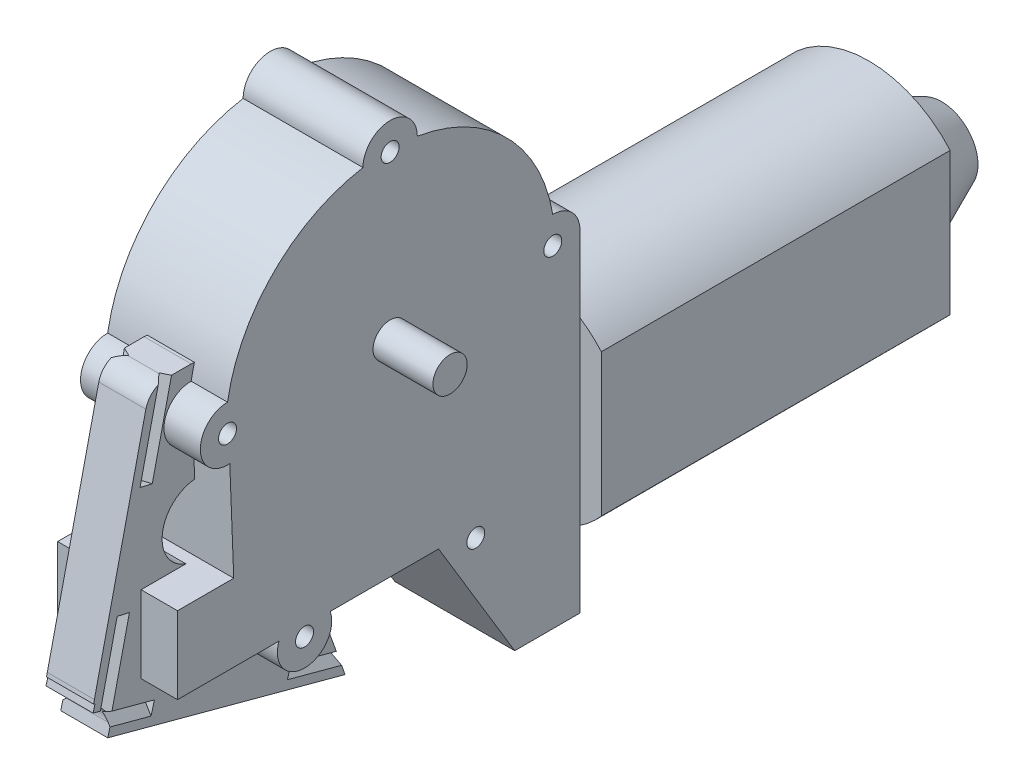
ISO-10303-21;
HEADER;
FILE_DESCRIPTION(('STEP AP214'),'2;1');
FILE_NAME('part.step','',(''),(''),'','','');
FILE_SCHEMA(('AUTOMOTIVE_DESIGN { 1 0 10303 214 1 1 1 1 }'));
ENDSEC;
DATA;
#1=APPLICATION_CONTEXT('core data for automotive mechanical design processes');
#2=APPLICATION_PROTOCOL_DEFINITION('international standard','automotive_design',2000,#1);
#3=PRODUCT_CONTEXT('',#1,'mechanical');
#4=PRODUCT('Part','Part','',(#3));
#5=PRODUCT_RELATED_PRODUCT_CATEGORY('part','',(#4));
#6=PRODUCT_DEFINITION_FORMATION('','',#4);
#7=PRODUCT_DEFINITION_CONTEXT('part definition',#1,'design');
#8=PRODUCT_DEFINITION('design','',#6,#7);
#9=PRODUCT_DEFINITION_SHAPE('','',#8);
#10=(LENGTH_UNIT() NAMED_UNIT(*) SI_UNIT(.MILLI.,.METRE.));
#11=(NAMED_UNIT(*) PLANE_ANGLE_UNIT() SI_UNIT($,.RADIAN.));
#12=(NAMED_UNIT(*) SI_UNIT($,.STERADIAN.) SOLID_ANGLE_UNIT());
#13=UNCERTAINTY_MEASURE_WITH_UNIT(LENGTH_MEASURE(1.E-05),#10,'distance_accuracy_value','');
#14=(GEOMETRIC_REPRESENTATION_CONTEXT(3) GLOBAL_UNCERTAINTY_ASSIGNED_CONTEXT((#13)) GLOBAL_UNIT_ASSIGNED_CONTEXT((#10,
#11,#12)) REPRESENTATION_CONTEXT('',''));
#15=CARTESIAN_POINT('',(0.,0.,0.));
#16=DIRECTION('',(0.,0.,1.));
#17=DIRECTION('',(1.,0.,0.));
#18=AXIS2_PLACEMENT_3D('',#15,#16,#17);
#19=CARTESIAN_POINT('',(-5.5,-26.079027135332,72.5866255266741));
#20=DIRECTION('',(0.,-0.338120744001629,0.941102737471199));
#21=DIRECTION('',(0.,-0.941102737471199,-0.338120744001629));
#22=AXIS2_PLACEMENT_3D('',#19,#20,#21);
#23=PLANE('',#22);
#24=DIRECTION('',(0.,-0.941102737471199,-0.338120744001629));
#25=VECTOR('',#24,1.);
#26=CARTESIAN_POINT('',(5.5,-26.079027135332,72.5866255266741));
#27=LINE('',#26,#25);
#28=CARTESIAN_POINT('',(5.5,1.51393584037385,82.5002649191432));
#29=VERTEX_POINT('',#28);
#30=CARTESIAN_POINT('',(5.5,1.18231145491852,82.3811184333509));
#31=VERTEX_POINT('',#30);
#32=EDGE_CURVE('E426',#29,#31,#27,.T.);
#33=ORIENTED_EDGE('',*,*,#32,.T.);
#34=DIRECTION('',(1.,0.,0.));
#35=VECTOR('',#34,1.);
#36=CARTESIAN_POINT('',(-28.,1.18231145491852,82.3811184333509));
#37=LINE('',#36,#35);
#38=CARTESIAN_POINT('',(-5.5,1.18231145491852,82.3811184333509));
#39=VERTEX_POINT('',#38);
#40=EDGE_CURVE('E714',#39,#31,#37,.T.);
#41=ORIENTED_EDGE('',*,*,#40,.F.);
#42=DIRECTION('',(0.,-0.941102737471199,-0.338120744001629));
#43=VECTOR('',#42,1.);
#44=CARTESIAN_POINT('',(-5.5,-26.079027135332,72.5866255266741));
#45=LINE('',#44,#43);
#46=CARTESIAN_POINT('',(-5.5,1.51393584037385,82.5002649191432));
#47=VERTEX_POINT('',#46);
#48=EDGE_CURVE('E444',#47,#39,#45,.T.);
#49=ORIENTED_EDGE('',*,*,#48,.F.);
#50=DIRECTION('',(1.,0.,0.));
#51=VECTOR('',#50,1.);
#52=CARTESIAN_POINT('',(-5.5,1.51393584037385,82.5002649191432));
#53=LINE('',#52,#51);
#54=EDGE_CURVE('E461',#47,#29,#53,.T.);
#55=ORIENTED_EDGE('',*,*,#54,.T.);
#56=EDGE_LOOP('',(#33,#41,#49,#55));
#57=FACE_BOUND('',#56,.T.);
#58=ADVANCED_FACE('F51',(#57),#23,.F.);
#59=CARTESIAN_POINT('',(-5.5,-1.81768854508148,91.7732861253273));
#60=DIRECTION('',(1.,0.,0.));
#61=DIRECTION('',(0.,0.,-1.));
#62=AXIS2_PLACEMENT_3D('',#59,#60,#61);
#63=CYLINDRICAL_SURFACE('',#62,3.00000000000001);
#64=DIRECTION('',(1.,0.,0.));
#65=VECTOR('',#64,1.);
#66=CARTESIAN_POINT('',(-5.5,1.18231145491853,91.7732861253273));
#67=LINE('',#66,#65);
#68=CARTESIAN_POINT('',(5.5,1.18231145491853,91.7732861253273));
#69=VERTEX_POINT('',#68);
#70=CARTESIAN_POINT('',(-5.5,1.18231145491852,91.7732861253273));
#71=VERTEX_POINT('',#70);
#72=EDGE_CURVE('E628',#69,#71,#67,.F.);
#73=ORIENTED_EDGE('',*,*,#72,.F.);
#74=CARTESIAN_POINT('',(5.5,-1.81768854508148,91.7732861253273));
#75=DIRECTION('',(1.,0.,0.));
#76=DIRECTION('',(0.,0.,-1.));
#77=AXIS2_PLACEMENT_3D('',#74,#75,#76);
#78=CIRCLE('',#77,3.00000000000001);
#79=CARTESIAN_POINT('',(5.5,-4.81768854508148,91.7732861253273));
#80=VERTEX_POINT('',#79);
#81=EDGE_CURVE('E440',#69,#80,#78,.T.);
#82=ORIENTED_EDGE('',*,*,#81,.T.);
#83=DIRECTION('',(1.,0.,0.));
#84=VECTOR('',#83,1.);
#85=CARTESIAN_POINT('',(-5.5,-4.81768854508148,91.7732861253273));
#86=LINE('',#85,#84);
#87=CARTESIAN_POINT('',(-5.5,-4.81768854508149,91.7732861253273));
#88=VERTEX_POINT('',#87);
#89=EDGE_CURVE('E625',#80,#88,#86,.F.);
#90=ORIENTED_EDGE('',*,*,#89,.T.);
#91=CARTESIAN_POINT('',(-5.5,-1.81768854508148,91.7732861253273));
#92=DIRECTION('',(1.,0.,0.));
#93=DIRECTION('',(0.,0.,-1.));
#94=AXIS2_PLACEMENT_3D('',#91,#92,#93);
#95=CIRCLE('',#94,3.00000000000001);
#96=EDGE_CURVE('E458',#71,#88,#95,.T.);
#97=ORIENTED_EDGE('',*,*,#96,.F.);
#98=EDGE_LOOP('',(#73,#82,#90,#97));
#99=FACE_BOUND('',#98,.T.);
#100=ADVANCED_FACE('F847',(#99),#63,.F.);
#101=CARTESIAN_POINT('',(-5.5,-4.81768854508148,80.2254298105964));
#102=VERTEX_POINT('',#101);
#103=CARTESIAN_POINT('',(-5.5,-48.9176885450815,64.3811184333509));
#104=VERTEX_POINT('',#103);
#105=EDGE_CURVE('E448',#102,#104,#45,.T.);
#106=ORIENTED_EDGE('',*,*,#105,.F.);
#107=DIRECTION('',(1.,0.,0.));
#108=VECTOR('',#107,1.);
#109=CARTESIAN_POINT('',(-28.,-4.81768854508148,80.2254298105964));
#110=LINE('',#109,#108);
#111=CARTESIAN_POINT('',(5.5,-4.81768854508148,80.2254298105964));
#112=VERTEX_POINT('',#111);
#113=EDGE_CURVE('E713',#102,#112,#110,.T.);
#114=ORIENTED_EDGE('',*,*,#113,.T.);
#115=CARTESIAN_POINT('',(5.5,-48.9176885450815,64.3811184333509));
#116=VERTEX_POINT('',#115);
#117=EDGE_CURVE('E430',#112,#116,#27,.T.);
#118=ORIENTED_EDGE('',*,*,#117,.T.);
#119=DIRECTION('',(1.,0.,0.));
#120=VECTOR('',#119,1.);
#121=CARTESIAN_POINT('',(-28.,-48.9176885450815,64.3811184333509));
#122=LINE('',#121,#120);
#123=EDGE_CURVE('E729',#104,#116,#122,.T.);
#124=ORIENTED_EDGE('',*,*,#123,.F.);
#125=EDGE_LOOP('',(#106,#114,#118,#124));
#126=FACE_BOUND('',#125,.T.);
#127=ADVANCED_FACE('F895',(#126),#23,.F.);
#128=CARTESIAN_POINT('',(-5.5,-51.9176885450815,73.7732861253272));
#129=DIRECTION('',(1.,0.,0.));
#130=DIRECTION('',(0.,0.,-1.));
#131=AXIS2_PLACEMENT_3D('',#128,#129,#130);
#132=CYLINDRICAL_SURFACE('',#131,3.00000000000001);
#133=DIRECTION('',(1.,0.,0.));
#134=VECTOR('',#133,1.);
#135=CARTESIAN_POINT('',(-5.5,-48.9176885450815,73.7732861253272));
#136=LINE('',#135,#134);
#137=CARTESIAN_POINT('',(5.5,-48.9176885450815,73.7732861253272));
#138=VERTEX_POINT('',#137);
#139=CARTESIAN_POINT('',(-5.5,-48.9176885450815,73.7732861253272));
#140=VERTEX_POINT('',#139);
#141=EDGE_CURVE('E623',#138,#140,#136,.F.);
#142=ORIENTED_EDGE('',*,*,#141,.F.);
#143=CARTESIAN_POINT('',(5.5,-51.9176885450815,73.7732861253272));
#144=DIRECTION('',(1.,0.,0.));
#145=DIRECTION('',(0.,0.,-1.));
#146=AXIS2_PLACEMENT_3D('',#143,#144,#145);
#147=CIRCLE('',#146,3.00000000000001);
#148=CARTESIAN_POINT('',(5.5,-54.9176885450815,73.7732861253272));
#149=VERTEX_POINT('',#148);
#150=EDGE_CURVE('E437',#138,#149,#147,.T.);
#151=ORIENTED_EDGE('',*,*,#150,.T.);
#152=DIRECTION('',(1.,0.,0.));
#153=VECTOR('',#152,1.);
#154=CARTESIAN_POINT('',(-5.5,-54.9176885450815,73.7732861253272));
#155=LINE('',#154,#153);
#156=CARTESIAN_POINT('',(-5.5,-54.9176885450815,73.7732861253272));
#157=VERTEX_POINT('',#156);
#158=EDGE_CURVE('E620',#149,#157,#155,.F.);
#159=ORIENTED_EDGE('',*,*,#158,.T.);
#160=CARTESIAN_POINT('',(-5.5,-51.9176885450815,73.7732861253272));
#161=DIRECTION('',(1.,0.,0.));
#162=DIRECTION('',(0.,0.,-1.));
#163=AXIS2_PLACEMENT_3D('',#160,#161,#162);
#164=CIRCLE('',#163,3.00000000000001);
#165=EDGE_CURVE('E455',#140,#157,#164,.T.);
#166=ORIENTED_EDGE('',*,*,#165,.F.);
#167=EDGE_LOOP('',(#142,#151,#159,#166));
#168=FACE_BOUND('',#167,.T.);
#169=ADVANCED_FACE('F903',(#168),#132,.F.);
#170=CARTESIAN_POINT('',(-5.5,0.,0.));
#171=DIRECTION('',(1.,0.,0.));
#172=DIRECTION('',(0.,0.,-1.));
#173=AXIS2_PLACEMENT_3D('',#170,#171,#172);
#174=PLANE('',#173);
#175=CARTESIAN_POINT('',(-5.5,-48.3576847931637,89.1257844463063));
#176=DIRECTION('',(1.,0.,0.));
#177=DIRECTION('',(0.,0.,-1.));
#178=AXIS2_PLACEMENT_3D('',#175,#176,#177);
#179=CIRCLE('',#178,8.31053871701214);
#180=CARTESIAN_POINT('',(-5.5,-48.3576847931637,80.8152457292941));
#181=VERTEX_POINT('',#180);
#182=EDGE_CURVE('E1503',#181,#181,#179,.T.);
#183=ORIENTED_EDGE('',*,*,#182,.T.);
#184=EDGE_LOOP('',(#183));
#185=FACE_BOUND('',#184,.T.);
#186=CARTESIAN_POINT('',(-5.5,-23.9896342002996,90.2483794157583));
#187=DIRECTION('',(1.,0.,0.));
#188=DIRECTION('',(0.,0.,-1.));
#189=AXIS2_PLACEMENT_3D('',#186,#187,#188);
#190=CIRCLE('',#189,8.31053871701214);
#191=CARTESIAN_POINT('',(-5.5,-23.9896342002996,81.9378406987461));
#192=VERTEX_POINT('',#191);
#193=EDGE_CURVE('E403',#192,#192,#190,.T.);
#194=ORIENTED_EDGE('',*,*,#193,.T.);
#195=EDGE_LOOP('',(#194));
#196=FACE_BOUND('',#195,.T.);
#197=DIRECTION('',(0.,0.974945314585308,-0.222444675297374));
#198=VECTOR('',#197,1.);
#199=CARTESIAN_POINT('',(-5.5,21.9481524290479,96.1958219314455));
#200=LINE('',#199,#198);
#201=CARTESIAN_POINT('',(-5.5,-34.4159635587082,109.05592525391));
#202=VERTEX_POINT('',#201);
#203=CARTESIAN_POINT('',(-5.5,-51.6328785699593,112.984156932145));
#204=VERTEX_POINT('',#203);
#205=EDGE_CURVE('E599',#202,#204,#200,.F.);
#206=ORIENTED_EDGE('',*,*,#205,.T.);
#207=DIRECTION('',(0.,0.259882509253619,0.965640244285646));
#208=VECTOR('',#207,1.);
#209=CARTESIAN_POINT('',(-5.5,-76.4993640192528,20.5882540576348));
#210=LINE('',#209,#208);
#211=CARTESIAN_POINT('',(-5.5,-51.1747945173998,114.686250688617));
#212=VERTEX_POINT('',#211);
#213=EDGE_CURVE('E695',#204,#212,#210,.T.);
#214=ORIENTED_EDGE('',*,*,#213,.T.);
#215=DIRECTION('',(0.,0.965640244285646,-0.259882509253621));
#216=VECTOR('',#215,1.);
#217=CARTESIAN_POINT('',(-5.5,25.3245695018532,94.0979966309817));
#218=LINE('',#217,#216);
#219=CARTESIAN_POINT('',(-5.5,-49.5043654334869,114.236688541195));
#220=VERTEX_POINT('',#219);
#221=EDGE_CURVE('E793',#212,#220,#218,.T.);
#222=ORIENTED_EDGE('',*,*,#221,.T.);
#223=DIRECTION('',(0.,0.259882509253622,0.965640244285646));
#224=VECTOR('',#223,1.);
#225=CARTESIAN_POINT('',(-5.5,-74.8289349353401,20.1386919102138));
#226=LINE('',#225,#224);
#227=CARTESIAN_POINT('',(-5.5,-49.415927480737,114.565295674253));
#228=VERTEX_POINT('',#227);
#229=EDGE_CURVE('E412',#220,#228,#226,.T.);
#230=ORIENTED_EDGE('',*,*,#229,.T.);
#231=DIRECTION('',(0.,-0.976653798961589,0.214819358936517));
#232=VECTOR('',#231,1.);
#233=CARTESIAN_POINT('',(-5.5,-48.5860641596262,114.382763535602));
#234=LINE('',#233,#232);
#235=CARTESIAN_POINT('',(-5.5,-48.5860641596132,114.382763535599));
#236=VERTEX_POINT('',#235);
#237=EDGE_CURVE('E485',#236,#228,#234,.T.);
#238=ORIENTED_EDGE('',*,*,#237,.F.);
#239=DIRECTION('',(0.,0.974945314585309,-0.222444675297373));
#240=VECTOR('',#239,1.);
#241=CARTESIAN_POINT('',(-5.5,22.4022315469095,98.1859900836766));
#242=LINE('',#241,#240);
#243=CARTESIAN_POINT('',(-5.5,4.14789178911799,102.35092181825));
#244=VERTEX_POINT('',#243);
#245=EDGE_CURVE('E453',#236,#244,#242,.T.);
#246=ORIENTED_EDGE('',*,*,#245,.T.);
#247=CARTESIAN_POINT('',(-5.5,3.03566841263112,97.4761952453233));
#248=DIRECTION('',(1.,0.,0.));
#249=DIRECTION('',(0.,0.,-1.));
#250=AXIS2_PLACEMENT_3D('',#247,#248,#249);
#251=CIRCLE('',#250,5.);
#252=CARTESIAN_POINT('',(-5.5,7.6234795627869,99.4641562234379));
#253=VERTEX_POINT('',#252);
#254=EDGE_CURVE('E477',#244,#253,#251,.F.);
#255=ORIENTED_EDGE('',*,*,#254,.T.);
#256=DIRECTION('',(0.,0.974945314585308,-0.222444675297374));
#257=VECTOR('',#256,1.);
#258=CARTESIAN_POINT('',(-5.5,21.9481524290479,96.1958219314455));
#259=LINE('',#258,#257);
#260=CARTESIAN_POINT('',(-5.5,-11.0172760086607,103.717253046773));
#261=VERTEX_POINT('',#260);
#262=EDGE_CURVE('E612',#253,#261,#259,.F.);
#263=ORIENTED_EDGE('',*,*,#262,.T.);
#264=DIRECTION('',(0.,-0.222444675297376,-0.974945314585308));
#265=VECTOR('',#264,1.);
#266=CARTESIAN_POINT('',(-5.5,-32.9654284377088,7.52143111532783));
#267=LINE('',#266,#265);
#268=CARTESIAN_POINT('',(-5.5,-11.6709381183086,100.852339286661));
#269=VERTEX_POINT('',#268);
#270=EDGE_CURVE('E481',#261,#269,#267,.T.);
#271=ORIENTED_EDGE('',*,*,#270,.T.);
#272=DIRECTION('',(0.,-0.974945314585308,0.222444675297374));
#273=VECTOR('',#272,1.);
#274=CARTESIAN_POINT('',(-5.5,21.2944903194,93.3309081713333));
#275=LINE('',#274,#273);
#276=CARTESIAN_POINT('',(-5.5,8.03566841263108,96.3560566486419));
#277=VERTEX_POINT('',#276);
#278=EDGE_CURVE('E556',#269,#277,#275,.F.);
#279=ORIENTED_EDGE('',*,*,#278,.T.);
#280=DIRECTION('',(0.,0.,-1.));
#281=VECTOR('',#280,1.);
#282=CARTESIAN_POINT('',(-5.5,8.03566841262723,-3.20779524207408E-13));
#283=LINE('',#282,#281);
#284=CARTESIAN_POINT('',(-5.5,8.0356684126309,91.7732861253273));
#285=VERTEX_POINT('',#284);
#286=EDGE_CURVE('E451',#277,#285,#283,.T.);
#287=ORIENTED_EDGE('',*,*,#286,.T.);
#288=CARTESIAN_POINT('',(-5.5,-1.81768854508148,91.7732861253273));
#289=DIRECTION('',(1.,0.,0.));
#290=DIRECTION('',(0.,0.,-1.));
#291=AXIS2_PLACEMENT_3D('',#288,#289,#290);
#292=CIRCLE('',#291,9.85335695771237);
#293=EDGE_CURVE('E447',#47,#285,#292,.T.);
#294=ORIENTED_EDGE('',*,*,#293,.F.);
#295=ORIENTED_EDGE('',*,*,#48,.T.);
#296=DIRECTION('',(0.,0.,1.));
#297=VECTOR('',#296,1.);
#298=CARTESIAN_POINT('',(-5.5,1.18231145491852,0.));
#299=LINE('',#298,#297);
#300=EDGE_CURVE('E721',#39,#71,#299,.T.);
#301=ORIENTED_EDGE('',*,*,#300,.T.);
#302=ORIENTED_EDGE('',*,*,#96,.T.);
#303=DIRECTION('',(0.,0.,-1.));
#304=VECTOR('',#303,1.);
#305=CARTESIAN_POINT('',(-5.5,-4.81768854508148,0.));
#306=LINE('',#305,#304);
#307=EDGE_CURVE('E716',#88,#102,#306,.T.);
#308=ORIENTED_EDGE('',*,*,#307,.T.);
#309=ORIENTED_EDGE('',*,*,#105,.T.);
#310=DIRECTION('',(0.,0.,1.));
#311=VECTOR('',#310,1.);
#312=CARTESIAN_POINT('',(-5.5,-48.9176885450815,0.));
#313=LINE('',#312,#311);
#314=EDGE_CURVE('E737',#104,#140,#313,.T.);
#315=ORIENTED_EDGE('',*,*,#314,.T.);
#316=ORIENTED_EDGE('',*,*,#165,.T.);
#317=DIRECTION('',(0.,0.,-1.));
#318=VECTOR('',#317,1.);
#319=CARTESIAN_POINT('',(-5.5,-54.9176885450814,0.));
#320=LINE('',#319,#318);
#321=CARTESIAN_POINT('',(-5.5,-54.9176885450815,62.2254298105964));
#322=VERTEX_POINT('',#321);
#323=EDGE_CURVE('E732',#157,#322,#320,.T.);
#324=ORIENTED_EDGE('',*,*,#323,.T.);
#325=CARTESIAN_POINT('',(-5.5,-67.0920007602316,57.8514254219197));
#326=VERTEX_POINT('',#325);
#327=EDGE_CURVE('E1015',#322,#326,#45,.T.);
#328=ORIENTED_EDGE('',*,*,#327,.T.);
#329=DIRECTION('',(0.,0.259882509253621,0.965640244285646));
#330=VECTOR('',#329,1.);
#331=CARTESIAN_POINT('',(-5.5,-68.6464625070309,52.0755429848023));
#332=LINE('',#331,#330);
#333=CARTESIAN_POINT('',(-5.5,-64.2284598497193,68.4914271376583));
#334=VERTEX_POINT('',#333);
#335=EDGE_CURVE('E752',#326,#334,#332,.T.);
#336=ORIENTED_EDGE('',*,*,#335,.T.);
#337=DIRECTION('',(0.,-0.965640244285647,0.259882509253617));
#338=VECTOR('',#337,1.);
#339=CARTESIAN_POINT('',(-5.5,-64.2284598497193,68.4914271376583));
#340=LINE('',#339,#338);
#341=CARTESIAN_POINT('',(-5.5,-67.1253805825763,69.2710746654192));
#342=VERTEX_POINT('',#341);
#343=EDGE_CURVE('E746',#334,#342,#340,.T.);
#344=ORIENTED_EDGE('',*,*,#343,.T.);
#345=DIRECTION('',(0.,0.259882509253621,0.965640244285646));
#346=VECTOR('',#345,1.);
#347=CARTESIAN_POINT('',(-5.5,-71.5433832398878,52.8551905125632));
#348=LINE('',#347,#346);
#349=CARTESIAN_POINT('',(-5.5,-70.5313056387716,56.6157470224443));
#350=VERTEX_POINT('',#349);
#351=EDGE_CURVE('E753',#350,#342,#348,.T.);
#352=ORIENTED_EDGE('',*,*,#351,.F.);
#353=CARTESIAN_POINT('',(-5.5,-72.8241755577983,55.791961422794));
#354=VERTEX_POINT('',#353);
#355=EDGE_CURVE('E443',#350,#354,#45,.T.);
#356=ORIENTED_EDGE('',*,*,#355,.T.);
#357=DIRECTION('',(0.,-0.259882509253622,-0.965640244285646));
#358=VECTOR('',#357,1.);
#359=CARTESIAN_POINT('',(-5.5,-56.5823006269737,116.141571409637));
#360=LINE('',#359,#358);
#361=CARTESIAN_POINT('',(-5.5,-57.8968921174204,111.256970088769));
#362=VERTEX_POINT('',#361);
#363=EDGE_CURVE('E408',#362,#354,#360,.T.);
#364=ORIENTED_EDGE('',*,*,#363,.F.);
#365=DIRECTION('',(0.,0.965640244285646,-0.25988250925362));
#366=VECTOR('',#365,1.);
#367=CARTESIAN_POINT('',(-5.5,24.0099780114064,89.2133953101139));
#368=LINE('',#367,#366);
#369=CARTESIAN_POINT('',(-5.5,-55.9656116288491,110.737205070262));
#370=VERTEX_POINT('',#369);
#371=EDGE_CURVE('E386',#362,#370,#368,.T.);
#372=ORIENTED_EDGE('',*,*,#371,.T.);
#373=DIRECTION('',(0.,0.259882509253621,0.965640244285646));
#374=VECTOR('',#373,1.);
#375=CARTESIAN_POINT('',(-5.5,-58.5492577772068,101.137202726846));
#376=LINE('',#375,#374);
#377=CARTESIAN_POINT('',(-5.5,-58.5492577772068,101.137202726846));
#378=VERTEX_POINT('',#377);
#379=EDGE_CURVE('E774',#378,#370,#376,.T.);
#380=ORIENTED_EDGE('',*,*,#379,.F.);
#381=DIRECTION('',(0.,-0.965640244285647,0.259882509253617));
#382=VECTOR('',#381,1.);
#383=CARTESIAN_POINT('',(-5.5,-55.6523370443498,100.357555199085));
#384=LINE('',#383,#382);
#385=CARTESIAN_POINT('',(-5.5,-55.6523370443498,100.357555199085));
#386=VERTEX_POINT('',#385);
#387=EDGE_CURVE('E767',#386,#378,#384,.T.);
#388=ORIENTED_EDGE('',*,*,#387,.F.);
#389=DIRECTION('',(0.,0.259882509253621,0.965640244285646));
#390=VECTOR('',#389,1.);
#391=CARTESIAN_POINT('',(-5.5,-55.6523370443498,100.357555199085));
#392=LINE('',#391,#390);
#393=CARTESIAN_POINT('',(-5.5,-52.9876849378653,110.258549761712));
#394=VERTEX_POINT('',#393);
#395=EDGE_CURVE('E678',#386,#394,#392,.T.);
#396=ORIENTED_EDGE('',*,*,#395,.T.);
#397=DIRECTION('',(0.,0.974945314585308,-0.222444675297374));
#398=VECTOR('',#397,1.);
#399=CARTESIAN_POINT('',(-5.5,21.2900081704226,93.31126351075));
#400=LINE('',#399,#398);
#401=CARTESIAN_POINT('',(-5.5,-35.0741078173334,106.171366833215));
#402=VERTEX_POINT('',#401);
#403=EDGE_CURVE('E673',#394,#402,#400,.T.);
#404=ORIENTED_EDGE('',*,*,#403,.T.);
#405=DIRECTION('',(0.,-0.222444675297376,-0.974945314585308));
#406=VECTOR('',#405,1.);
#407=CARTESIAN_POINT('',(-5.5,-56.3641159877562,12.8601033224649));
#408=LINE('',#407,#406);
#409=EDGE_CURVE('E498',#202,#402,#408,.T.);
#410=ORIENTED_EDGE('',*,*,#409,.F.);
#411=EDGE_LOOP('',(#206,#214,#222,#230,#238,#246,#255,#263,#271,#279,#287,#294,#295,#301,#302,
#308,#309,#315,#316,#324,#328,#336,#344,#352,#356,#364,#372,#380,#388,#396,#404,#410));
#412=FACE_BOUND('',#411,.T.);
#413=ADVANCED_FACE('F797',(#185,#196,#412),#174,.F.);
#414=CARTESIAN_POINT('',(-5.5,8.03566841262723,-3.20779524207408E-13));
#415=DIRECTION('',(0.,-1.,0.));
#416=DIRECTION('',(0.,0.,-1.));
#417=AXIS2_PLACEMENT_3D('',#414,#415,#416);
#418=PLANE('',#417);
#419=ORIENTED_EDGE('',*,*,#286,.F.);
#420=DIRECTION('',(-0.894331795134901,0.,-0.447404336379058));
#421=VECTOR('',#420,1.);
#422=CARTESIAN_POINT('',(-44.0547488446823,8.03566841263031,77.0684031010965));
#423=LINE('',#422,#421);
#424=CARTESIAN_POINT('',(-3.54131259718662,8.03566841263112,97.3359225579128));
#425=VERTEX_POINT('',#424);
#426=EDGE_CURVE('E559',#277,#425,#423,.F.);
#427=ORIENTED_EDGE('',*,*,#426,.T.);
#428=DIRECTION('',(0.,0.,-1.));
#429=VECTOR('',#428,1.);
#430=CARTESIAN_POINT('',(-3.54131259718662,8.03566841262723,-3.20779524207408E-13));
#431=LINE('',#430,#429);
#432=CARTESIAN_POINT('',(-3.54131259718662,8.03566841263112,97.3610878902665));
#433=VERTEX_POINT('',#432);
#434=EDGE_CURVE('E417',#433,#425,#431,.T.);
#435=ORIENTED_EDGE('',*,*,#434,.F.);
#436=DIRECTION('',(0.69808006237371,0.,-0.716019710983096));
#437=VECTOR('',#436,1.);
#438=CARTESIAN_POINT('',(44.169065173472,8.03566841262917,48.4246223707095));
#439=LINE('',#438,#437);
#440=CARTESIAN_POINT('',(-3.65353597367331,8.03566841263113,97.4761952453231));
#441=VERTEX_POINT('',#440);
#442=EDGE_CURVE('E614',#433,#441,#439,.F.);
#443=ORIENTED_EDGE('',*,*,#442,.T.);
#444=DIRECTION('',(1.,0.,0.));
#445=VECTOR('',#444,1.);
#446=CARTESIAN_POINT('',(-5.5,8.03566841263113,97.4761952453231));
#447=LINE('',#446,#445);
#448=CARTESIAN_POINT('',(3.65353597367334,8.03566841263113,97.4761952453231));
#449=VERTEX_POINT('',#448);
#450=EDGE_CURVE('E465',#441,#449,#447,.T.);
#451=ORIENTED_EDGE('',*,*,#450,.T.);
#452=DIRECTION('',(0.698080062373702,0.,0.716019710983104));
#453=VECTOR('',#452,1.);
#454=CARTESIAN_POINT('',(-49.5295386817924,8.03566841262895,42.9263924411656));
#455=LINE('',#454,#453);
#456=CARTESIAN_POINT('',(3.54131259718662,8.03566841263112,97.3610878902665));
#457=VERTEX_POINT('',#456);
#458=EDGE_CURVE('E610',#449,#457,#455,.F.);
#459=ORIENTED_EDGE('',*,*,#458,.T.);
#460=DIRECTION('',(0.,0.,1.));
#461=VECTOR('',#460,1.);
#462=CARTESIAN_POINT('',(3.54131259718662,8.03566841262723,-3.20779524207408E-13));
#463=LINE('',#462,#461);
#464=CARTESIAN_POINT('',(3.54131259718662,8.03566841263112,97.3359225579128));
#465=VERTEX_POINT('',#464);
#466=EDGE_CURVE('E422',#465,#457,#463,.T.);
#467=ORIENTED_EDGE('',*,*,#466,.F.);
#468=DIRECTION('',(-0.894331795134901,0.,0.447404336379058));
#469=VECTOR('',#468,1.);
#470=CARTESIAN_POINT('',(35.256625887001,8.03566841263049,81.4698102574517));
#471=LINE('',#470,#469);
#472=CARTESIAN_POINT('',(5.5,8.03566841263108,96.3560566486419));
#473=VERTEX_POINT('',#472);
#474=EDGE_CURVE('E578',#465,#473,#471,.F.);
#475=ORIENTED_EDGE('',*,*,#474,.T.);
#476=DIRECTION('',(0.,0.,-1.));
#477=VECTOR('',#476,1.);
#478=CARTESIAN_POINT('',(5.5,8.03566841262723,-3.20779524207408E-13));
#479=LINE('',#478,#477);
#480=CARTESIAN_POINT('',(5.5,8.0356684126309,91.7732861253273));
#481=VERTEX_POINT('',#480);
#482=EDGE_CURVE('E433',#473,#481,#479,.T.);
#483=ORIENTED_EDGE('',*,*,#482,.T.);
#484=DIRECTION('',(1.,0.,0.));
#485=VECTOR('',#484,1.);
#486=CARTESIAN_POINT('',(-5.5,8.0356684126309,91.7732861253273));
#487=LINE('',#486,#485);
#488=EDGE_CURVE('E466',#285,#481,#487,.T.);
#489=ORIENTED_EDGE('',*,*,#488,.F.);
#490=EDGE_LOOP('',(#419,#427,#435,#443,#451,#459,#467,#475,#483,#489));
#491=FACE_BOUND('',#490,.T.);
#492=ADVANCED_FACE('F835',(#491),#418,.F.);
#493=CARTESIAN_POINT('',(-5.5,3.03566841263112,97.4761952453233));
#494=DIRECTION('',(1.,0.,0.));
#495=DIRECTION('',(0.,0.,-1.));
#496=AXIS2_PLACEMENT_3D('',#493,#494,#495);
#497=CYLINDRICAL_SURFACE('',#496,5.);
#498=ORIENTED_EDGE('',*,*,#450,.F.);
#499=CARTESIAN_POINT('',(-2.54131259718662,3.03566841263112,97.4761952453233));
#500=DIRECTION('',(-0.707106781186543,-0.157292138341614,-0.689390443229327));
#501=DIRECTION('',(0.707106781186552,-0.157292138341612,-0.68939044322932));
#502=AXIS2_PLACEMENT_3D('',#499,#500,#501);
#503=ELLIPSE('',#502,7.07106781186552,5.);
#504=EDGE_CURVE('E617',#441,#253,#503,.F.);
#505=ORIENTED_EDGE('',*,*,#504,.T.);
#506=ORIENTED_EDGE('',*,*,#254,.F.);
#507=DIRECTION('',(1.,0.,0.));
#508=VECTOR('',#507,1.);
#509=CARTESIAN_POINT('',(-5.5,4.14789178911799,102.35092181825));
#510=LINE('',#509,#508);
#511=CARTESIAN_POINT('',(5.5,4.14789178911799,102.35092181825));
#512=VERTEX_POINT('',#511);
#513=EDGE_CURVE('E474',#512,#244,#510,.F.);
#514=ORIENTED_EDGE('',*,*,#513,.F.);
#515=CARTESIAN_POINT('',(5.5,3.03566841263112,97.4761952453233));
#516=DIRECTION('',(1.,0.,0.));
#517=DIRECTION('',(0.,0.,-1.));
#518=AXIS2_PLACEMENT_3D('',#515,#516,#517);
#519=CIRCLE('',#518,5.);
#520=CARTESIAN_POINT('',(5.5,7.62347956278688,99.4641562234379));
#521=VERTEX_POINT('',#520);
#522=EDGE_CURVE('E471',#521,#512,#519,.T.);
#523=ORIENTED_EDGE('',*,*,#522,.F.);
#524=CARTESIAN_POINT('',(2.54131259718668,3.03566841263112,97.4761952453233));
#525=DIRECTION('',(0.707106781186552,-0.157292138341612,-0.689390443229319));
#526=DIRECTION('',(0.707106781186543,0.157292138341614,0.689390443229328));
#527=AXIS2_PLACEMENT_3D('',#524,#525,#526);
#528=ELLIPSE('',#527,7.07106781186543,5.);
#529=EDGE_CURVE('E607',#521,#449,#528,.F.);
#530=ORIENTED_EDGE('',*,*,#529,.T.);
#531=EDGE_LOOP('',(#498,#505,#506,#514,#523,#530));
#532=FACE_BOUND('',#531,.T.);
#533=ADVANCED_FACE('F815',(#532),#497,.T.);
#534=CARTESIAN_POINT('',(5.5,0.,0.));
#535=DIRECTION('',(1.,0.,0.));
#536=DIRECTION('',(0.,0.,-1.));
#537=AXIS2_PLACEMENT_3D('',#534,#535,#536);
#538=PLANE('',#537);
#539=CARTESIAN_POINT('',(5.5,-48.3576847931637,89.1257844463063));
#540=DIRECTION('',(1.,0.,0.));
#541=DIRECTION('',(0.,0.,-1.));
#542=AXIS2_PLACEMENT_3D('',#539,#540,#541);
#543=CIRCLE('',#542,8.31053871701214);
#544=CARTESIAN_POINT('',(5.5,-48.3576847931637,80.8152457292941));
#545=VERTEX_POINT('',#544);
#546=EDGE_CURVE('E1500',#545,#545,#543,.T.);
#547=ORIENTED_EDGE('',*,*,#546,.F.);
#548=EDGE_LOOP('',(#547));
#549=FACE_BOUND('',#548,.T.);
#550=CARTESIAN_POINT('',(5.5,-23.9896342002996,90.2483794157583));
#551=DIRECTION('',(1.,0.,0.));
#552=DIRECTION('',(0.,0.,-1.));
#553=AXIS2_PLACEMENT_3D('',#550,#551,#552);
#554=CIRCLE('',#553,8.31053871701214);
#555=CARTESIAN_POINT('',(5.5,-23.9896342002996,81.9378406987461));
#556=VERTEX_POINT('',#555);
#557=EDGE_CURVE('E1504',#556,#556,#554,.T.);
#558=ORIENTED_EDGE('',*,*,#557,.F.);
#559=EDGE_LOOP('',(#558));
#560=FACE_BOUND('',#559,.T.);
#561=DIRECTION('',(0.,0.259882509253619,0.965640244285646));
#562=VECTOR('',#561,1.);
#563=CARTESIAN_POINT('',(5.5,-51.155287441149,114.758732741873));
#564=LINE('',#563,#562);
#565=CARTESIAN_POINT('',(5.5,-51.6328785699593,112.984156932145));
#566=VERTEX_POINT('',#565);
#567=CARTESIAN_POINT('',(5.5,-51.1747945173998,114.686250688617));
#568=VERTEX_POINT('',#567);
#569=EDGE_CURVE('E391',#566,#568,#564,.T.);
#570=ORIENTED_EDGE('',*,*,#569,.F.);
#571=DIRECTION('',(0.,-0.974945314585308,0.222444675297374));
#572=VECTOR('',#571,1.);
#573=CARTESIAN_POINT('',(5.5,-57.8146511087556,114.394597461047));
#574=LINE('',#573,#572);
#575=CARTESIAN_POINT('',(5.5,-34.4159635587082,109.05592525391));
#576=VERTEX_POINT('',#575);
#577=EDGE_CURVE('E602',#566,#576,#574,.F.);
#578=ORIENTED_EDGE('',*,*,#577,.T.);
#579=DIRECTION('',(0.,-0.222444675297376,-0.974945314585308));
#580=VECTOR('',#579,1.);
#581=CARTESIAN_POINT('',(5.5,-56.3641159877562,12.8601033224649));
#582=LINE('',#581,#580);
#583=CARTESIAN_POINT('',(5.5,-35.069625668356,106.191011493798));
#584=VERTEX_POINT('',#583);
#585=EDGE_CURVE('E496',#576,#584,#582,.T.);
#586=ORIENTED_EDGE('',*,*,#585,.T.);
#587=DIRECTION('',(0.,0.974945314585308,-0.222444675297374));
#588=VECTOR('',#587,1.);
#589=CARTESIAN_POINT('',(5.5,-58.4683132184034,111.529683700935));
#590=LINE('',#589,#588);
#591=CARTESIAN_POINT('',(5.5,-52.9824445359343,110.278021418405));
#592=VERTEX_POINT('',#591);
#593=EDGE_CURVE('E572',#584,#592,#590,.F.);
#594=ORIENTED_EDGE('',*,*,#593,.T.);
#595=DIRECTION('',(0.,0.259882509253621,0.965640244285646));
#596=VECTOR('',#595,1.);
#597=CARTESIAN_POINT('',(5.5,-55.6523370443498,100.357555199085));
#598=LINE('',#597,#596);
#599=CARTESIAN_POINT('',(5.5,-55.6523370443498,100.357555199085));
#600=VERTEX_POINT('',#599);
#601=EDGE_CURVE('E783',#600,#592,#598,.T.);
#602=ORIENTED_EDGE('',*,*,#601,.F.);
#603=DIRECTION('',(0.,0.965640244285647,-0.259882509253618));
#604=VECTOR('',#603,1.);
#605=CARTESIAN_POINT('',(5.5,-55.6523370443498,100.357555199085));
#606=LINE('',#605,#604);
#607=CARTESIAN_POINT('',(5.5,-58.5492577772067,101.137202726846));
#608=VERTEX_POINT('',#607);
#609=EDGE_CURVE('E777',#608,#600,#606,.T.);
#610=ORIENTED_EDGE('',*,*,#609,.F.);
#611=DIRECTION('',(0.,0.259882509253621,0.965640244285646));
#612=VECTOR('',#611,1.);
#613=CARTESIAN_POINT('',(5.5,-58.5492577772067,101.137202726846));
#614=LINE('',#613,#612);
#615=CARTESIAN_POINT('',(5.5,-55.9656116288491,110.737205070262));
#616=VERTEX_POINT('',#615);
#617=EDGE_CURVE('E402',#608,#616,#614,.T.);
#618=ORIENTED_EDGE('',*,*,#617,.T.);
#619=DIRECTION('',(0.,0.965640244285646,-0.25988250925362));
#620=VECTOR('',#619,1.);
#621=CARTESIAN_POINT('',(5.5,-52.4893860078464,109.801649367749));
#622=LINE('',#621,#620);
#623=CARTESIAN_POINT('',(5.5,-57.8968921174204,111.256970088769));
#624=VERTEX_POINT('',#623);
#625=EDGE_CURVE('E383',#624,#616,#622,.T.);
#626=ORIENTED_EDGE('',*,*,#625,.F.);
#627=DIRECTION('',(0.,0.259882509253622,0.965640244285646));
#628=VECTOR('',#627,1.);
#629=CARTESIAN_POINT('',(5.5,-56.5823006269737,116.141571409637));
#630=LINE('',#629,#628);
#631=CARTESIAN_POINT('',(5.5,-72.8241755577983,55.791961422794));
#632=VERTEX_POINT('',#631);
#633=EDGE_CURVE('E398',#632,#624,#630,.T.);
#634=ORIENTED_EDGE('',*,*,#633,.F.);
#635=CARTESIAN_POINT('',(5.5,-70.5313056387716,56.6157470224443));
#636=VERTEX_POINT('',#635);
#637=EDGE_CURVE('E425',#636,#632,#27,.T.);
#638=ORIENTED_EDGE('',*,*,#637,.F.);
#639=DIRECTION('',(0.,0.259882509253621,0.965640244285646));
#640=VECTOR('',#639,1.);
#641=CARTESIAN_POINT('',(5.5,-71.5433832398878,52.8551905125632));
#642=LINE('',#641,#640);
#643=CARTESIAN_POINT('',(5.5,-67.1253805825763,69.2710746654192));
#644=VERTEX_POINT('',#643);
#645=EDGE_CURVE('E764',#636,#644,#642,.T.);
#646=ORIENTED_EDGE('',*,*,#645,.T.);
#647=DIRECTION('',(0.,0.965640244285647,-0.259882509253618));
#648=VECTOR('',#647,1.);
#649=CARTESIAN_POINT('',(5.5,-64.2284598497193,68.4914271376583));
#650=LINE('',#649,#648);
#651=CARTESIAN_POINT('',(5.5,-64.2284598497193,68.4914271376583));
#652=VERTEX_POINT('',#651);
#653=EDGE_CURVE('E756',#644,#652,#650,.T.);
#654=ORIENTED_EDGE('',*,*,#653,.T.);
#655=DIRECTION('',(0.,0.259882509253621,0.965640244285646));
#656=VECTOR('',#655,1.);
#657=CARTESIAN_POINT('',(5.5,-68.6464625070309,52.0755429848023));
#658=LINE('',#657,#656);
#659=CARTESIAN_POINT('',(5.5,-67.0920007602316,57.8514254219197));
#660=VERTEX_POINT('',#659);
#661=EDGE_CURVE('E763',#660,#652,#658,.T.);
#662=ORIENTED_EDGE('',*,*,#661,.F.);
#663=CARTESIAN_POINT('',(5.5,-54.9176885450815,62.2254298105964));
#664=VERTEX_POINT('',#663);
#665=EDGE_CURVE('E858',#664,#660,#27,.T.);
#666=ORIENTED_EDGE('',*,*,#665,.F.);
#667=DIRECTION('',(0.,0.,-1.));
#668=VECTOR('',#667,1.);
#669=CARTESIAN_POINT('',(5.5,-54.9176885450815,62.2254298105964));
#670=LINE('',#669,#668);
#671=EDGE_CURVE('E724',#149,#664,#670,.T.);
#672=ORIENTED_EDGE('',*,*,#671,.F.);
#673=ORIENTED_EDGE('',*,*,#150,.F.);
#674=DIRECTION('',(0.,0.,1.));
#675=VECTOR('',#674,1.);
#676=CARTESIAN_POINT('',(5.5,-48.9176885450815,73.7732861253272));
#677=LINE('',#676,#675);
#678=EDGE_CURVE('E726',#116,#138,#677,.T.);
#679=ORIENTED_EDGE('',*,*,#678,.F.);
#680=ORIENTED_EDGE('',*,*,#117,.F.);
#681=DIRECTION('',(0.,0.,-1.));
#682=VECTOR('',#681,1.);
#683=CARTESIAN_POINT('',(5.5,-4.81768854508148,91.7732861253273));
#684=LINE('',#683,#682);
#685=EDGE_CURVE('E709',#80,#112,#684,.T.);
#686=ORIENTED_EDGE('',*,*,#685,.F.);
#687=ORIENTED_EDGE('',*,*,#81,.F.);
#688=DIRECTION('',(0.,0.,1.));
#689=VECTOR('',#688,1.);
#690=CARTESIAN_POINT('',(5.5,1.18231145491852,82.3811184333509));
#691=LINE('',#690,#689);
#692=EDGE_CURVE('E711',#31,#69,#691,.T.);
#693=ORIENTED_EDGE('',*,*,#692,.F.);
#694=ORIENTED_EDGE('',*,*,#32,.F.);
#695=CARTESIAN_POINT('',(5.5,-1.81768854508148,91.7732861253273));
#696=DIRECTION('',(1.,0.,0.));
#697=DIRECTION('',(0.,0.,-1.));
#698=AXIS2_PLACEMENT_3D('',#695,#696,#697);
#699=CIRCLE('',#698,9.85335695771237);
#700=EDGE_CURVE('E429',#29,#481,#699,.T.);
#701=ORIENTED_EDGE('',*,*,#700,.T.);
#702=ORIENTED_EDGE('',*,*,#482,.F.);
#703=DIRECTION('',(0.,0.974945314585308,-0.222444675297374));
#704=VECTOR('',#703,1.);
#705=CARTESIAN_POINT('',(5.5,81.0404246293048,79.6992051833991));
#706=LINE('',#705,#704);
#707=CARTESIAN_POINT('',(5.50000000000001,-11.6709381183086,100.852339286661));
#708=VERTEX_POINT('',#707);
#709=EDGE_CURVE('E575',#473,#708,#706,.F.);
#710=ORIENTED_EDGE('',*,*,#709,.T.);
#711=DIRECTION('',(0.,-0.222444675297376,-0.974945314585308));
#712=VECTOR('',#711,1.);
#713=CARTESIAN_POINT('',(5.5,-32.9654284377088,7.52143111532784));
#714=LINE('',#713,#712);
#715=CARTESIAN_POINT('',(5.5,-11.0172760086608,103.717253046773));
#716=VERTEX_POINT('',#715);
#717=EDGE_CURVE('E479',#716,#708,#714,.T.);
#718=ORIENTED_EDGE('',*,*,#717,.F.);
#719=DIRECTION('',(0.,-0.974945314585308,0.222444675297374));
#720=VECTOR('',#719,1.);
#721=CARTESIAN_POINT('',(5.5,81.6940867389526,82.5641189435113));
#722=LINE('',#721,#720);
#723=EDGE_CURVE('E604',#716,#521,#722,.F.);
#724=ORIENTED_EDGE('',*,*,#723,.T.);
#725=ORIENTED_EDGE('',*,*,#522,.T.);
#726=DIRECTION('',(0.,0.974945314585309,-0.222444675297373));
#727=VECTOR('',#726,1.);
#728=CARTESIAN_POINT('',(5.5,22.4022315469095,98.1859900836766));
#729=LINE('',#728,#727);
#730=CARTESIAN_POINT('',(5.5,-48.5860641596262,114.382763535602));
#731=VERTEX_POINT('',#730);
#732=EDGE_CURVE('E435',#731,#512,#729,.T.);
#733=ORIENTED_EDGE('',*,*,#732,.F.);
#734=DIRECTION('',(0.,0.976653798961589,-0.214819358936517));
#735=VECTOR('',#734,1.);
#736=CARTESIAN_POINT('',(5.5,-48.5860641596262,114.382763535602));
#737=LINE('',#736,#735);
#738=CARTESIAN_POINT('',(5.5,-49.415927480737,114.565295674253));
#739=VERTEX_POINT('',#738);
#740=EDGE_CURVE('E483',#739,#731,#737,.T.);
#741=ORIENTED_EDGE('',*,*,#740,.F.);
#742=DIRECTION('',(0.,0.259882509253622,0.965640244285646));
#743=VECTOR('',#742,1.);
#744=CARTESIAN_POINT('',(5.5,-49.5043654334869,114.236688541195));
#745=LINE('',#744,#743);
#746=CARTESIAN_POINT('',(5.5,-49.5043654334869,114.236688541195));
#747=VERTEX_POINT('',#746);
#748=EDGE_CURVE('E788',#747,#739,#745,.T.);
#749=ORIENTED_EDGE('',*,*,#748,.F.);
#750=DIRECTION('',(0.,0.965640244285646,-0.259882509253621));
#751=VECTOR('',#750,1.);
#752=CARTESIAN_POINT('',(5.5,-56.5823006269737,116.141571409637));
#753=LINE('',#752,#751);
#754=EDGE_CURVE('E785',#568,#747,#753,.T.);
#755=ORIENTED_EDGE('',*,*,#754,.F.);
#756=EDGE_LOOP('',(#570,#578,#586,#594,#602,#610,#618,#626,#634,#638,#646,#654,#662,#666,#672,
#673,#679,#680,#686,#687,#693,#694,#701,#702,#710,#718,#724,#725,#733,#741,#749,#755));
#757=FACE_BOUND('',#756,.T.);
#758=ADVANCED_FACE('F396',(#549,#560,#757),#538,.T.);
#759=ORIENTED_EDGE('',*,*,#327,.F.);
#760=DIRECTION('',(1.,0.,0.));
#761=VECTOR('',#760,1.);
#762=CARTESIAN_POINT('',(-28.,-54.9176885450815,62.2254298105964));
#763=LINE('',#762,#761);
#764=EDGE_CURVE('E728',#322,#664,#763,.T.);
#765=ORIENTED_EDGE('',*,*,#764,.T.);
#766=ORIENTED_EDGE('',*,*,#665,.T.);
#767=DIRECTION('',(0.859704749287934,0.480707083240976,0.172709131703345));
#768=VECTOR('',#767,1.);
#769=CARTESIAN_POINT('',(16.5071251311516,-60.9373261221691,60.0626857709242));
#770=LINE('',#769,#768);
#771=CARTESIAN_POINT('',(3.5,-68.2103081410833,57.449638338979));
#772=VERTEX_POINT('',#771);
#773=EDGE_CURVE('E533',#660,#772,#770,.F.);
#774=ORIENTED_EDGE('',*,*,#773,.T.);
#775=DIRECTION('',(0.,-0.941102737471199,-0.338120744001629));
#776=VECTOR('',#775,1.);
#777=CARTESIAN_POINT('',(3.50000000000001,-26.079027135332,72.5866255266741));
#778=LINE('',#777,#776);
#779=CARTESIAN_POINT('',(3.5,-68.2384357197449,57.4395326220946));
#780=VERTEX_POINT('',#779);
#781=EDGE_CURVE('E491',#772,#780,#778,.T.);
#782=ORIENTED_EDGE('',*,*,#781,.T.);
#783=DIRECTION('',(-0.634493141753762,0.727405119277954,0.26134315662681));
#784=VECTOR('',#783,1.);
#785=CARTESIAN_POINT('',(-22.092913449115,-38.8978250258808,67.9810693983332));
#786=LINE('',#785,#784);
#787=EDGE_CURVE('E520',#780,#636,#786,.F.);
#788=ORIENTED_EDGE('',*,*,#787,.T.);
#789=ORIENTED_EDGE('',*,*,#637,.T.);
#790=DIRECTION('',(-1.,0.,0.));
#791=VECTOR('',#790,1.);
#792=CARTESIAN_POINT('',(-5.5,-72.8241755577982,55.791961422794));
#793=LINE('',#792,#791);
#794=EDGE_CURVE('E407',#632,#354,#793,.T.);
#795=ORIENTED_EDGE('',*,*,#794,.T.);
#796=ORIENTED_EDGE('',*,*,#355,.F.);
#797=DIRECTION('',(-0.634493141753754,-0.727405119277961,-0.261343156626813));
#798=VECTOR('',#797,1.);
#799=CARTESIAN_POINT('',(17.6645164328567,-43.9746941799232,66.1570445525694));
#800=LINE('',#799,#798);
#801=CARTESIAN_POINT('',(-3.5,-68.2384357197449,57.4395326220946));
#802=VERTEX_POINT('',#801);
#803=EDGE_CURVE('E522',#350,#802,#800,.F.);
#804=ORIENTED_EDGE('',*,*,#803,.T.);
#805=DIRECTION('',(0.,0.941102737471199,0.338120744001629));
#806=VECTOR('',#805,1.);
#807=CARTESIAN_POINT('',(-3.50000000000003,-26.079027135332,72.5866255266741));
#808=LINE('',#807,#806);
#809=CARTESIAN_POINT('',(-3.5,-68.2103081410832,57.449638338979));
#810=VERTEX_POINT('',#809);
#811=EDGE_CURVE('E493',#802,#810,#808,.T.);
#812=ORIENTED_EDGE('',*,*,#811,.T.);
#813=DIRECTION('',(0.859704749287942,-0.480707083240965,-0.172709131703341));
#814=VECTOR('',#813,1.);
#815=CARTESIAN_POINT('',(-24.6371399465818,-56.3913983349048,61.6959532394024));
#816=LINE('',#815,#814);
#817=EDGE_CURVE('E543',#810,#326,#816,.F.);
#818=ORIENTED_EDGE('',*,*,#817,.T.);
#819=EDGE_LOOP('',(#759,#765,#766,#774,#782,#788,#789,#795,#796,#804,#812,#818));
#820=FACE_BOUND('',#819,.T.);
#821=ADVANCED_FACE('F863',(#820),#23,.F.);
#822=CARTESIAN_POINT('',(-5.5,22.4022315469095,98.1859900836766));
#823=DIRECTION('',(0.,-0.222444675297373,-0.974945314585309));
#824=DIRECTION('',(0.,0.974945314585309,-0.222444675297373));
#825=AXIS2_PLACEMENT_3D('',#822,#823,#824);
#826=PLANE('',#825);
#827=ORIENTED_EDGE('',*,*,#732,.T.);
#828=ORIENTED_EDGE('',*,*,#513,.T.);
#829=ORIENTED_EDGE('',*,*,#245,.F.);
#830=DIRECTION('',(1.,0.,0.));
#831=VECTOR('',#830,1.);
#832=CARTESIAN_POINT('',(-5.5,-48.5860641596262,114.382763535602));
#833=LINE('',#832,#831);
#834=EDGE_CURVE('E462',#236,#731,#833,.T.);
#835=ORIENTED_EDGE('',*,*,#834,.T.);
#836=EDGE_LOOP('',(#827,#828,#829,#835));
#837=FACE_BOUND('',#836,.T.);
#838=ADVANCED_FACE('F808',(#837),#826,.F.);
#839=CARTESIAN_POINT('',(-5.5,-1.81768854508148,91.7732861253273));
#840=DIRECTION('',(1.,0.,0.));
#841=DIRECTION('',(0.,0.,-1.));
#842=AXIS2_PLACEMENT_3D('',#839,#840,#841);
#843=CYLINDRICAL_SURFACE('',#842,9.85335695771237);
#844=ORIENTED_EDGE('',*,*,#488,.T.);
#845=ORIENTED_EDGE('',*,*,#700,.F.);
#846=ORIENTED_EDGE('',*,*,#54,.F.);
#847=ORIENTED_EDGE('',*,*,#293,.T.);
#848=EDGE_LOOP('',(#844,#845,#846,#847));
#849=FACE_BOUND('',#848,.T.);
#850=ADVANCED_FACE('F838',(#849),#843,.T.);
#851=CARTESIAN_POINT('',(3.54131259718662,81.7032765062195,82.6043964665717));
#852=DIRECTION('',(1.,0.,0.));
#853=DIRECTION('',(0.,0.,-1.));
#854=AXIS2_PLACEMENT_3D('',#851,#852,#853);
#855=PLANE('',#854);
#856=ORIENTED_EDGE('',*,*,#466,.T.);
#857=DIRECTION('',(0.,-0.974945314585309,0.222444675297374));
#858=VECTOR('',#857,1.);
#859=CARTESIAN_POINT('',(3.54131259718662,-11.4529755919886,101.807639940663));
#860=LINE('',#859,#858);
#861=CARTESIAN_POINT('',(3.54131259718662,-11.4529755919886,101.807639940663));
#862=VERTEX_POINT('',#861);
#863=EDGE_CURVE('E589',#457,#862,#860,.T.);
#864=ORIENTED_EDGE('',*,*,#863,.T.);
#865=DIRECTION('',(0.,0.222444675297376,0.974945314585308));
#866=VECTOR('',#865,1.);
#867=CARTESIAN_POINT('',(3.54131259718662,-11.0080862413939,103.757530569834));
#868=LINE('',#867,#866);
#869=CARTESIAN_POINT('',(3.54131259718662,-11.458433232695,101.783719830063));
#870=VERTEX_POINT('',#869);
#871=EDGE_CURVE('E419',#870,#862,#868,.T.);
#872=ORIENTED_EDGE('',*,*,#871,.F.);
#873=DIRECTION('',(0.,0.974945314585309,-0.222444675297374));
#874=VECTOR('',#873,1.);
#875=CARTESIAN_POINT('',(3.54131259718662,8.25265544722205,97.2864145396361));
#876=LINE('',#875,#874);
#877=EDGE_CURVE('E569',#870,#465,#876,.T.);
#878=ORIENTED_EDGE('',*,*,#877,.T.);
#879=EDGE_LOOP('',(#856,#864,#872,#878));
#880=FACE_BOUND('',#879,.T.);
#881=ADVANCED_FACE('F919',(#880),#855,.T.);
#882=CARTESIAN_POINT('',(0.,-32.9654284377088,7.52143111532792));
#883=DIRECTION('',(0.,-0.974945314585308,0.222444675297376));
#884=DIRECTION('',(0.,-0.222444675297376,-0.974945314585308));
#885=AXIS2_PLACEMENT_3D('',#882,#883,#884);
#886=PLANE('',#885);
#887=ORIENTED_EDGE('',*,*,#871,.T.);
#888=DIRECTION('',(-0.707106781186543,-0.157292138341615,-0.689390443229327));
#889=VECTOR('',#888,1.);
#890=CARTESIAN_POINT('',(3.54131259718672,-11.4529755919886,101.807639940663));
#891=LINE('',#890,#889);
#892=EDGE_CURVE('E592',#862,#716,#891,.F.);
#893=ORIENTED_EDGE('',*,*,#892,.T.);
#894=ORIENTED_EDGE('',*,*,#717,.T.);
#895=DIRECTION('',(0.89879404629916,-0.0975133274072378,-0.427387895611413));
#896=VECTOR('',#895,1.);
#897=CARTESIAN_POINT('',(5.54131259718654,-11.675420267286,100.832694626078));
#898=LINE('',#897,#896);
#899=EDGE_CURVE('E567',#708,#870,#898,.F.);
#900=ORIENTED_EDGE('',*,*,#899,.T.);
#901=EDGE_LOOP('',(#887,#893,#894,#900));
#902=FACE_BOUND('',#901,.T.);
#903=ADVANCED_FACE('F932',(#902),#886,.F.);
#904=CARTESIAN_POINT('',(-3.54131259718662,81.7032765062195,82.6043964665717));
#905=DIRECTION('',(-1.,0.,0.));
#906=DIRECTION('',(0.,0.,1.));
#907=AXIS2_PLACEMENT_3D('',#904,#905,#906);
#908=PLANE('',#907);
#909=DIRECTION('',(0.,-0.222444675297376,-0.974945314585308));
#910=VECTOR('',#909,1.);
#911=CARTESIAN_POINT('',(-3.54131259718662,-11.0080862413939,103.757530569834));
#912=LINE('',#911,#910);
#913=CARTESIAN_POINT('',(-3.54131259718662,-11.4529755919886,101.807639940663));
#914=VERTEX_POINT('',#913);
#915=CARTESIAN_POINT('',(-3.54131259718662,-11.458433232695,101.783719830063));
#916=VERTEX_POINT('',#915);
#917=EDGE_CURVE('E410',#914,#916,#912,.T.);
#918=ORIENTED_EDGE('',*,*,#917,.F.);
#919=DIRECTION('',(0.,0.974945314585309,-0.222444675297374));
#920=VECTOR('',#919,1.);
#921=CARTESIAN_POINT('',(-3.54131259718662,7.15789434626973,97.5613618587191));
#922=LINE('',#921,#920);
#923=EDGE_CURVE('E596',#914,#433,#922,.T.);
#924=ORIENTED_EDGE('',*,*,#923,.T.);
#925=ORIENTED_EDGE('',*,*,#434,.T.);
#926=DIRECTION('',(0.,-0.974945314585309,0.222444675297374));
#927=VECTOR('',#926,1.);
#928=CARTESIAN_POINT('',(-3.54131259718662,-11.458433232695,101.783719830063));
#929=LINE('',#928,#927);
#930=EDGE_CURVE('E550',#425,#916,#929,.T.);
#931=ORIENTED_EDGE('',*,*,#930,.T.);
#932=EDGE_LOOP('',(#918,#924,#925,#931));
#933=FACE_BOUND('',#932,.T.);
#934=ADVANCED_FACE('F825',(#933),#908,.T.);
#935=CARTESIAN_POINT('',(0.,-32.9654284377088,7.52143111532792));
#936=DIRECTION('',(0.,-0.974945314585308,0.222444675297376));
#937=DIRECTION('',(0.,-0.222444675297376,-0.974945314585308));
#938=AXIS2_PLACEMENT_3D('',#935,#936,#937);
#939=PLANE('',#938);
#940=ORIENTED_EDGE('',*,*,#270,.F.);
#941=DIRECTION('',(-0.707106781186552,0.157292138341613,0.689390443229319));
#942=VECTOR('',#941,1.);
#943=CARTESIAN_POINT('',(-5.54131259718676,-11.0080862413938,103.757530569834));
#944=LINE('',#943,#942);
#945=EDGE_CURVE('E594',#261,#914,#944,.F.);
#946=ORIENTED_EDGE('',*,*,#945,.T.);
#947=ORIENTED_EDGE('',*,*,#917,.T.);
#948=DIRECTION('',(0.89879404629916,0.0975133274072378,0.427387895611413));
#949=VECTOR('',#948,1.);
#950=CARTESIAN_POINT('',(-3.54131259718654,-11.458433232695,101.783719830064));
#951=LINE('',#950,#949);
#952=EDGE_CURVE('E553',#916,#269,#951,.F.);
#953=ORIENTED_EDGE('',*,*,#952,.T.);
#954=EDGE_LOOP('',(#940,#946,#947,#953));
#955=FACE_BOUND('',#954,.T.);
#956=ADVANCED_FACE('F822',(#955),#939,.F.);
#957=CARTESIAN_POINT('',(-28.,-56.5823006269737,116.141571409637));
#958=DIRECTION('',(0.,0.965640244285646,-0.259882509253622));
#959=DIRECTION('',(0.,0.259882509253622,0.965640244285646));
#960=AXIS2_PLACEMENT_3D('',#957,#958,#959);
#961=PLANE('',#960);
#962=ORIENTED_EDGE('',*,*,#633,.T.);
#963=DIRECTION('',(1.,0.,0.));
#964=VECTOR('',#963,1.);
#965=CARTESIAN_POINT('',(-18.5,-57.8968921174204,111.256970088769));
#966=LINE('',#965,#964);
#967=EDGE_CURVE('E379',#362,#624,#966,.T.);
#968=ORIENTED_EDGE('',*,*,#967,.F.);
#969=ORIENTED_EDGE('',*,*,#363,.T.);
#970=ORIENTED_EDGE('',*,*,#794,.F.);
#971=EDGE_LOOP('',(#962,#968,#969,#970));
#972=FACE_BOUND('',#971,.T.);
#973=ADVANCED_FACE('F405',(#972),#961,.F.);
#974=CARTESIAN_POINT('',(-28.,-48.5860641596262,114.382763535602));
#975=DIRECTION('',(0.,-0.214819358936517,-0.976653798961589));
#976=DIRECTION('',(0.,0.976653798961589,-0.214819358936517));
#977=AXIS2_PLACEMENT_3D('',#974,#975,#976);
#978=PLANE('',#977);
#979=ORIENTED_EDGE('',*,*,#237,.T.);
#980=DIRECTION('',(1.,0.,0.));
#981=VECTOR('',#980,1.);
#982=CARTESIAN_POINT('',(-28.,-49.415927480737,114.565295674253));
#983=LINE('',#982,#981);
#984=EDGE_CURVE('E488',#228,#739,#983,.T.);
#985=ORIENTED_EDGE('',*,*,#984,.T.);
#986=ORIENTED_EDGE('',*,*,#740,.T.);
#987=ORIENTED_EDGE('',*,*,#834,.F.);
#988=EDGE_LOOP('',(#979,#985,#986,#987));
#989=FACE_BOUND('',#988,.T.);
#990=ADVANCED_FACE('F803',(#989),#978,.F.);
#991=CARTESIAN_POINT('',(-28.,-49.5043654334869,114.236688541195));
#992=DIRECTION('',(0.,0.965640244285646,-0.259882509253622));
#993=DIRECTION('',(0.,0.259882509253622,0.965640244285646));
#994=AXIS2_PLACEMENT_3D('',#991,#992,#993);
#995=PLANE('',#994);
#996=DIRECTION('',(1.,0.,0.));
#997=VECTOR('',#996,1.);
#998=CARTESIAN_POINT('',(-28.,-49.5043654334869,114.236688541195));
#999=LINE('',#998,#997);
#1000=EDGE_CURVE('E790',#220,#747,#999,.T.);
#1001=ORIENTED_EDGE('',*,*,#1000,.T.);
#1002=ORIENTED_EDGE('',*,*,#748,.T.);
#1003=ORIENTED_EDGE('',*,*,#984,.F.);
#1004=ORIENTED_EDGE('',*,*,#229,.F.);
#1005=EDGE_LOOP('',(#1001,#1002,#1003,#1004));
#1006=FACE_BOUND('',#1005,.T.);
#1007=ADVANCED_FACE('F1034',(#1006),#995,.F.);
#1008=CARTESIAN_POINT('',(-28.,-56.5823006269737,116.141571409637));
#1009=DIRECTION('',(0.,-0.259882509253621,-0.965640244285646));
#1010=DIRECTION('',(0.,0.965640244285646,-0.259882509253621));
#1011=AXIS2_PLACEMENT_3D('',#1008,#1009,#1010);
#1012=PLANE('',#1011);
#1013=ORIENTED_EDGE('',*,*,#221,.F.);
#1014=DIRECTION('',(1.,0.,0.));
#1015=VECTOR('',#1014,1.);
#1016=CARTESIAN_POINT('',(-28.,-51.1747945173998,114.686250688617));
#1017=LINE('',#1016,#1015);
#1018=EDGE_CURVE('E697',#212,#568,#1017,.T.);
#1019=ORIENTED_EDGE('',*,*,#1018,.T.);
#1020=ORIENTED_EDGE('',*,*,#754,.T.);
#1021=ORIENTED_EDGE('',*,*,#1000,.F.);
#1022=EDGE_LOOP('',(#1013,#1019,#1020,#1021));
#1023=FACE_BOUND('',#1022,.T.);
#1024=ADVANCED_FACE('F1031',(#1023),#1012,.F.);
#1025=CARTESIAN_POINT('',(3.5,-58.5492577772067,101.137202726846));
#1026=DIRECTION('',(-1.,0.,0.));
#1027=DIRECTION('',(0.,-1.,0.));
#1028=AXIS2_PLACEMENT_3D('',#1025,#1026,#1027);
#1029=PLANE('',#1028);
#1030=DIRECTION('',(0.,0.259882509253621,0.965640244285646));
#1031=VECTOR('',#1030,1.);
#1032=CARTESIAN_POINT('',(3.5,-52.6960478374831,115.095665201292));
#1033=LINE('',#1032,#1031);
#1034=CARTESIAN_POINT('',(3.5,-56.5942854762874,100.611061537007));
#1035=VERTEX_POINT('',#1034);
#1036=CARTESIAN_POINT('',(3.5,-53.9171242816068,110.558535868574));
#1037=VERTEX_POINT('',#1036);
#1038=EDGE_CURVE('E529',#1035,#1037,#1033,.T.);
#1039=ORIENTED_EDGE('',*,*,#1038,.T.);
#1040=CARTESIAN_POINT('',(3.5,-54.6066592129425,113.478217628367));
#1041=DIRECTION('',(-1.,0.,0.));
#1042=DIRECTION('',(0.,-1.,0.));
#1043=AXIS2_PLACEMENT_3D('',#1040,#1041,#1042);
#1044=CIRCLE('',#1043,3.);
#1045=CARTESIAN_POINT('',(3.5,-53.9442185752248,110.552269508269));
#1046=VERTEX_POINT('',#1045);
#1047=EDGE_CURVE('E649',#1037,#1046,#1044,.T.);
#1048=ORIENTED_EDGE('',*,*,#1047,.T.);
#1049=DIRECTION('',(0.,-0.259882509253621,-0.965640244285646));
#1050=VECTOR('',#1049,1.);
#1051=CARTESIAN_POINT('',(3.5,-56.6179772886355,100.617437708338));
#1052=LINE('',#1051,#1050);
#1053=CARTESIAN_POINT('',(3.5,-56.6179772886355,100.617437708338));
#1054=VERTEX_POINT('',#1053);
#1055=EDGE_CURVE('E512',#1046,#1054,#1052,.T.);
#1056=ORIENTED_EDGE('',*,*,#1055,.T.);
#1057=DIRECTION('',(0.,-0.965640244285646,0.259882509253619));
#1058=VECTOR('',#1057,1.);
#1059=CARTESIAN_POINT('',(3.5,-58.5492577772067,101.137202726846));
#1060=LINE('',#1059,#1058);
#1061=EDGE_CURVE('E780',#1035,#1054,#1060,.T.);
#1062=ORIENTED_EDGE('',*,*,#1061,.F.);
#1063=EDGE_LOOP('',(#1039,#1048,#1056,#1062));
#1064=FACE_BOUND('',#1063,.T.);
#1065=ADVANCED_FACE('F1055',(#1064),#1029,.F.);
#1066=CARTESIAN_POINT('',(0.,21.4263318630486,79.6133929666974));
#1067=DIRECTION('',(0.,-0.259882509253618,-0.965640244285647));
#1068=DIRECTION('',(0.,0.965640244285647,-0.259882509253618));
#1069=AXIS2_PLACEMENT_3D('',#1066,#1067,#1068);
#1070=PLANE('',#1069);
#1071=ORIENTED_EDGE('',*,*,#609,.T.);
#1072=DIRECTION('',(0.898794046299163,0.423308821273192,-0.113924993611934));
#1073=VECTOR('',#1072,1.);
#1074=CARTESIAN_POINT('',(3.5,-56.5942854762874,100.611061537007));
#1075=LINE('',#1074,#1073);
#1076=EDGE_CURVE('E531',#600,#1035,#1075,.F.);
#1077=ORIENTED_EDGE('',*,*,#1076,.T.);
#1078=ORIENTED_EDGE('',*,*,#1061,.T.);
#1079=DIRECTION('',(-0.70710678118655,0.682810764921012,-0.183764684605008));
#1080=VECTOR('',#1079,1.);
#1081=CARTESIAN_POINT('',(5.5,-58.5492577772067,101.137202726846));
#1082=LINE('',#1081,#1080);
#1083=EDGE_CURVE('E514',#1054,#608,#1082,.F.);
#1084=ORIENTED_EDGE('',*,*,#1083,.T.);
#1085=EDGE_LOOP('',(#1071,#1077,#1078,#1084));
#1086=FACE_BOUND('',#1085,.T.);
#1087=ADVANCED_FACE('F1052',(#1086),#1070,.F.);
#1088=CARTESIAN_POINT('',(-3.5,-58.5492577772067,101.137202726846));
#1089=DIRECTION('',(1.,0.,0.));
#1090=DIRECTION('',(0.,1.,0.));
#1091=AXIS2_PLACEMENT_3D('',#1088,#1089,#1090);
#1092=PLANE('',#1091);
#1093=DIRECTION('',(0.,0.259882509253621,0.965640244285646));
#1094=VECTOR('',#1093,1.);
#1095=CARTESIAN_POINT('',(-3.5,-52.7197396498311,115.102041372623));
#1096=LINE('',#1095,#1094);
#1097=CARTESIAN_POINT('',(-3.50000000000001,-56.6179772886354,100.617437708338));
#1098=VERTEX_POINT('',#1097);
#1099=CARTESIAN_POINT('',(-3.5,-53.9442185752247,110.552269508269));
#1100=VERTEX_POINT('',#1099);
#1101=EDGE_CURVE('E516',#1098,#1100,#1096,.T.);
#1102=ORIENTED_EDGE('',*,*,#1101,.T.);
#1103=CARTESIAN_POINT('',(-3.5,-54.6066592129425,113.478217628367));
#1104=DIRECTION('',(1.,0.,0.));
#1105=DIRECTION('',(0.,1.,0.));
#1106=AXIS2_PLACEMENT_3D('',#1103,#1104,#1105);
#1107=CIRCLE('',#1106,3.);
#1108=CARTESIAN_POINT('',(-3.5,-53.9171242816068,110.558535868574));
#1109=VERTEX_POINT('',#1108);
#1110=EDGE_CURVE('E657',#1100,#1109,#1107,.T.);
#1111=ORIENTED_EDGE('',*,*,#1110,.T.);
#1112=DIRECTION('',(0.,-0.259882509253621,-0.965640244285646));
#1113=VECTOR('',#1112,1.);
#1114=CARTESIAN_POINT('',(-3.5,-56.5942854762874,100.611061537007));
#1115=LINE('',#1114,#1113);
#1116=CARTESIAN_POINT('',(-3.5,-56.5942854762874,100.611061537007));
#1117=VERTEX_POINT('',#1116);
#1118=EDGE_CURVE('E539',#1109,#1117,#1115,.T.);
#1119=ORIENTED_EDGE('',*,*,#1118,.T.);
#1120=DIRECTION('',(0.,0.965640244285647,-0.259882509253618));
#1121=VECTOR('',#1120,1.);
#1122=CARTESIAN_POINT('',(-3.5,-58.5492577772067,101.137202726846));
#1123=LINE('',#1122,#1121);
#1124=EDGE_CURVE('E771',#1098,#1117,#1123,.T.);
#1125=ORIENTED_EDGE('',*,*,#1124,.F.);
#1126=EDGE_LOOP('',(#1102,#1111,#1119,#1125));
#1127=FACE_BOUND('',#1126,.T.);
#1128=ADVANCED_FACE('F890',(#1127),#1092,.F.);
#1129=CARTESIAN_POINT('',(0.,21.4263318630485,79.6133929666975));
#1130=DIRECTION('',(0.,0.259882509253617,0.965640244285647));
#1131=DIRECTION('',(0.,-0.965640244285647,0.259882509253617));
#1132=AXIS2_PLACEMENT_3D('',#1129,#1130,#1131);
#1133=PLANE('',#1132);
#1134=ORIENTED_EDGE('',*,*,#1124,.T.);
#1135=DIRECTION('',(0.898794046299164,-0.423308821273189,0.113924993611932));
#1136=VECTOR('',#1135,1.);
#1137=CARTESIAN_POINT('',(-32.5069561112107,-42.9327570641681,96.9343379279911));
#1138=LINE('',#1137,#1136);
#1139=EDGE_CURVE('E541',#1117,#386,#1138,.F.);
#1140=ORIENTED_EDGE('',*,*,#1139,.T.);
#1141=ORIENTED_EDGE('',*,*,#387,.T.);
#1142=DIRECTION('',(-0.70710678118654,-0.682810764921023,0.18376468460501));
#1143=VECTOR('',#1142,1.);
#1144=CARTESIAN_POINT('',(38.6606548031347,-15.9059522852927,89.6606209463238));
#1145=LINE('',#1144,#1143);
#1146=EDGE_CURVE('E518',#378,#1098,#1145,.F.);
#1147=ORIENTED_EDGE('',*,*,#1146,.T.);
#1148=EDGE_LOOP('',(#1134,#1140,#1141,#1147));
#1149=FACE_BOUND('',#1148,.T.);
#1150=ADVANCED_FACE('F882',(#1149),#1133,.T.);
#1151=CARTESIAN_POINT('',(3.5,-71.5433832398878,52.8551905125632));
#1152=DIRECTION('',(-1.,0.,0.));
#1153=DIRECTION('',(0.,-1.,0.));
#1154=AXIS2_PLACEMENT_3D('',#1151,#1152,#1153);
#1155=PLANE('',#1154);
#1156=ORIENTED_EDGE('',*,*,#781,.F.);
#1157=DIRECTION('',(0.,0.259882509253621,0.965640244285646));
#1158=VECTOR('',#1157,1.);
#1159=CARTESIAN_POINT('',(3.5,-65.1704082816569,68.7449334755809));
#1160=LINE('',#1159,#1158);
#1161=CARTESIAN_POINT('',(3.49999999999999,-65.170408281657,68.7449334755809));
#1162=VERTEX_POINT('',#1161);
#1163=EDGE_CURVE('E524',#772,#1162,#1160,.T.);
#1164=ORIENTED_EDGE('',*,*,#1163,.T.);
#1165=DIRECTION('',(0.,-0.965640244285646,0.259882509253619));
#1166=VECTOR('',#1165,1.);
#1167=CARTESIAN_POINT('',(3.5,-67.1253805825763,69.2710746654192));
#1168=LINE('',#1167,#1166);
#1169=CARTESIAN_POINT('',(3.5,-65.194100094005,68.7513096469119));
#1170=VERTEX_POINT('',#1169);
#1171=EDGE_CURVE('E761',#1162,#1170,#1168,.T.);
#1172=ORIENTED_EDGE('',*,*,#1171,.T.);
#1173=DIRECTION('',(0.,-0.259882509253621,-0.965640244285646));
#1174=VECTOR('',#1173,1.);
#1175=CARTESIAN_POINT('',(3.5,-68.6000251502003,56.095982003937));
#1176=LINE('',#1175,#1174);
#1177=EDGE_CURVE('E504',#1170,#780,#1176,.T.);
#1178=ORIENTED_EDGE('',*,*,#1177,.T.);
#1179=EDGE_LOOP('',(#1156,#1164,#1172,#1178));
#1180=FACE_BOUND('',#1179,.T.);
#1181=ADVANCED_FACE('F880',(#1180),#1155,.F.);
#1182=CARTESIAN_POINT('',(0.,12.8502090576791,47.7472649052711));
#1183=DIRECTION('',(0.,-0.259882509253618,-0.965640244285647));
#1184=DIRECTION('',(0.,0.965640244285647,-0.259882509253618));
#1185=AXIS2_PLACEMENT_3D('',#1182,#1183,#1184);
#1186=PLANE('',#1185);
#1187=ORIENTED_EDGE('',*,*,#1171,.F.);
#1188=DIRECTION('',(-0.898794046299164,-0.42330882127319,0.113924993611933));
#1189=VECTOR('',#1188,1.);
#1190=CARTESIAN_POINT('',(32.5069561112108,-51.5088798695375,65.0682098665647));
#1191=LINE('',#1190,#1189);
#1192=EDGE_CURVE('E527',#1162,#652,#1191,.F.);
#1193=ORIENTED_EDGE('',*,*,#1192,.T.);
#1194=ORIENTED_EDGE('',*,*,#653,.F.);
#1195=DIRECTION('',(0.707106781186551,-0.682810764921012,0.183764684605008));
#1196=VECTOR('',#1195,1.);
#1197=CARTESIAN_POINT('',(-38.6606548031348,-24.4820750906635,57.7944928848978));
#1198=LINE('',#1197,#1196);
#1199=EDGE_CURVE('E501',#644,#1170,#1198,.F.);
#1200=ORIENTED_EDGE('',*,*,#1199,.T.);
#1201=EDGE_LOOP('',(#1187,#1193,#1194,#1200));
#1202=FACE_BOUND('',#1201,.T.);
#1203=ADVANCED_FACE('F873',(#1202),#1186,.T.);
#1204=CARTESIAN_POINT('',(-3.5,-71.5433832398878,52.8551905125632));
#1205=DIRECTION('',(1.,0.,0.));
#1206=DIRECTION('',(0.,1.,0.));
#1207=AXIS2_PLACEMENT_3D('',#1204,#1205,#1206);
#1208=PLANE('',#1207);
#1209=DIRECTION('',(0.,0.965640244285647,-0.259882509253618));
#1210=VECTOR('',#1209,1.);
#1211=CARTESIAN_POINT('',(-3.5,-67.1253805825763,69.2710746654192));
#1212=LINE('',#1211,#1210);
#1213=CARTESIAN_POINT('',(-3.5,-65.194100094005,68.7513096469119));
#1214=VERTEX_POINT('',#1213);
#1215=CARTESIAN_POINT('',(-3.5,-65.1704082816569,68.7449334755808));
#1216=VERTEX_POINT('',#1215);
#1217=EDGE_CURVE('E749',#1214,#1216,#1212,.T.);
#1218=ORIENTED_EDGE('',*,*,#1217,.T.);
#1219=DIRECTION('',(0.,-0.259882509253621,-0.965640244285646));
#1220=VECTOR('',#1219,1.);
#1221=CARTESIAN_POINT('',(-3.5,-68.0339491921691,58.1049317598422));
#1222=LINE('',#1221,#1220);
#1223=EDGE_CURVE('E537',#1216,#810,#1222,.T.);
#1224=ORIENTED_EDGE('',*,*,#1223,.T.);
#1225=ORIENTED_EDGE('',*,*,#811,.F.);
#1226=DIRECTION('',(0.,0.259882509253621,0.965640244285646));
#1227=VECTOR('',#1226,1.);
#1228=CARTESIAN_POINT('',(-3.5,-65.194100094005,68.7513096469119));
#1229=LINE('',#1228,#1227);
#1230=EDGE_CURVE('E507',#802,#1214,#1229,.T.);
#1231=ORIENTED_EDGE('',*,*,#1230,.T.);
#1232=EDGE_LOOP('',(#1218,#1224,#1225,#1231));
#1233=FACE_BOUND('',#1232,.T.);
#1234=ADVANCED_FACE('F888',(#1233),#1208,.F.);
#1235=CARTESIAN_POINT('',(0.,12.850209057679,47.7472649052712));
#1236=DIRECTION('',(0.,0.259882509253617,0.965640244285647));
#1237=DIRECTION('',(0.,-0.965640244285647,0.259882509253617));
#1238=AXIS2_PLACEMENT_3D('',#1235,#1236,#1237);
#1239=PLANE('',#1238);
#1240=ORIENTED_EDGE('',*,*,#343,.F.);
#1241=DIRECTION('',(-0.898794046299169,0.423308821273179,-0.11392499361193));
#1242=VECTOR('',#1241,1.);
#1243=CARTESIAN_POINT('',(-5.49999999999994,-64.2284598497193,68.4914271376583));
#1244=LINE('',#1243,#1242);
#1245=EDGE_CURVE('E535',#334,#1216,#1244,.F.);
#1246=ORIENTED_EDGE('',*,*,#1245,.T.);
#1247=ORIENTED_EDGE('',*,*,#1217,.F.);
#1248=DIRECTION('',(0.707106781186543,0.682810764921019,-0.183764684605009));
#1249=VECTOR('',#1248,1.);
#1250=CARTESIAN_POINT('',(-3.50000000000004,-65.194100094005,68.7513096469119));
#1251=LINE('',#1250,#1249);
#1252=EDGE_CURVE('E510',#1214,#342,#1251,.F.);
#1253=ORIENTED_EDGE('',*,*,#1252,.T.);
#1254=EDGE_LOOP('',(#1240,#1246,#1247,#1253));
#1255=FACE_BOUND('',#1254,.T.);
#1256=ADVANCED_FACE('F997',(#1255),#1239,.F.);
#1257=CARTESIAN_POINT('',(3.54131259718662,-57.8054613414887,114.434874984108));
#1258=DIRECTION('',(-1.,0.,0.));
#1259=DIRECTION('',(0.,0.,1.));
#1260=AXIS2_PLACEMENT_3D('',#1257,#1258,#1259);
#1261=PLANE('',#1260);
#1262=DIRECTION('',(0.,-0.974945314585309,0.222444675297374));
#1263=VECTOR('',#1262,1.);
#1264=CARTESIAN_POINT('',(3.54131259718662,-53.5844202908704,111.420400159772));
#1265=LINE('',#1264,#1263);
#1266=CARTESIAN_POINT('',(3.54131259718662,-34.851663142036,107.1463121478));
#1267=VERTEX_POINT('',#1266);
#1268=CARTESIAN_POINT('',(3.54131259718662,-52.6471789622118,111.206558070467));
#1269=VERTEX_POINT('',#1268);
#1270=EDGE_CURVE('E587',#1267,#1269,#1265,.T.);
#1271=ORIENTED_EDGE('',*,*,#1270,.T.);
#1272=CARTESIAN_POINT('',(3.54131259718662,-54.6066592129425,113.478217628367));
#1273=DIRECTION('',(-1.,0.,0.));
#1274=DIRECTION('',(0.,0.,1.));
#1275=AXIS2_PLACEMENT_3D('',#1272,#1273,#1274);
#1276=CIRCLE('',#1275,3.);
#1277=CARTESIAN_POINT('',(3.54131259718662,-52.6704395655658,111.186699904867));
#1278=VERTEX_POINT('',#1277);
#1279=EDGE_CURVE('E641',#1269,#1278,#1276,.T.);
#1280=ORIENTED_EDGE('',*,*,#1279,.T.);
#1281=DIRECTION('',(0.,0.974945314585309,-0.222444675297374));
#1282=VECTOR('',#1281,1.);
#1283=CARTESIAN_POINT('',(3.54131259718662,-34.8571207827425,107.1223920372));
#1284=LINE('',#1283,#1282);
#1285=CARTESIAN_POINT('',(3.54131259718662,-34.8571207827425,107.1223920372));
#1286=VERTEX_POINT('',#1285);
#1287=EDGE_CURVE('E562',#1278,#1286,#1284,.T.);
#1288=ORIENTED_EDGE('',*,*,#1287,.T.);
#1289=DIRECTION('',(0.,0.222444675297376,0.974945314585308));
#1290=VECTOR('',#1289,1.);
#1291=CARTESIAN_POINT('',(3.54131259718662,-34.4067737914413,109.096202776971));
#1292=LINE('',#1291,#1290);
#1293=EDGE_CURVE('E743',#1286,#1267,#1292,.T.);
#1294=ORIENTED_EDGE('',*,*,#1293,.T.);
#1295=EDGE_LOOP('',(#1271,#1280,#1288,#1294));
#1296=FACE_BOUND('',#1295,.T.);
#1297=ADVANCED_FACE('F993',(#1296),#1261,.F.);
#1298=CARTESIAN_POINT('',(0.,-56.3641159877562,12.8601033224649));
#1299=DIRECTION('',(0.,-0.974945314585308,0.222444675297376));
#1300=DIRECTION('',(0.,-0.222444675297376,-0.974945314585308));
#1301=AXIS2_PLACEMENT_3D('',#1298,#1299,#1300);
#1302=PLANE('',#1301);
#1303=ORIENTED_EDGE('',*,*,#585,.F.);
#1304=DIRECTION('',(0.707106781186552,0.157292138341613,0.689390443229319));
#1305=VECTOR('',#1304,1.);
#1306=CARTESIAN_POINT('',(-46.5839577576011,-46.0017626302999,58.2769146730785));
#1307=LINE('',#1306,#1305);
#1308=EDGE_CURVE('E585',#576,#1267,#1307,.F.);
#1309=ORIENTED_EDGE('',*,*,#1308,.T.);
#1310=ORIENTED_EDGE('',*,*,#1293,.F.);
#1311=DIRECTION('',(-0.898794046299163,0.0975133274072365,0.427387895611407));
#1312=VECTOR('',#1311,1.);
#1313=CARTESIAN_POINT('',(38.7748204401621,-38.6797279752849,90.3684150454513));
#1314=LINE('',#1313,#1312);
#1315=EDGE_CURVE('E564',#1286,#584,#1314,.F.);
#1316=ORIENTED_EDGE('',*,*,#1315,.T.);
#1317=EDGE_LOOP('',(#1303,#1309,#1310,#1316));
#1318=FACE_BOUND('',#1317,.T.);
#1319=ADVANCED_FACE('F987',(#1318),#1302,.T.);
#1320=CARTESIAN_POINT('',(0.,-56.3641159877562,12.8601033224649));
#1321=DIRECTION('',(0.,-0.974945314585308,0.222444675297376));
#1322=DIRECTION('',(0.,-0.222444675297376,-0.974945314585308));
#1323=AXIS2_PLACEMENT_3D('',#1320,#1321,#1322);
#1324=PLANE('',#1323);
#1325=DIRECTION('',(-0.438371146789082,-0.199931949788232,-0.876275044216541));
#1326=VECTOR('',#1325,1.);
#1327=CARTESIAN_POINT('',(-41.3587424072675,-51.8769605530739,32.5267065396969));
#1328=LINE('',#1327,#1326);
#1329=CARTESIAN_POINT('',(-4.51677777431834,-35.0741078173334,106.171366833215));
#1330=VERTEX_POINT('',#1329);
#1331=CARTESIAN_POINT('',(-3.8691487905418,-34.7787377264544,107.465934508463));
#1332=VERTEX_POINT('',#1331);
#1333=EDGE_CURVE('E547',#1330,#1332,#1328,.F.);
#1334=ORIENTED_EDGE('',*,*,#1333,.T.);
#1335=DIRECTION('',(0.707106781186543,-0.157292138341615,-0.689390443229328));
#1336=VECTOR('',#1335,1.);
#1337=CARTESIAN_POINT('',(46.583957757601,-46.0017626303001,58.2769146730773));
#1338=LINE('',#1337,#1336);
#1339=EDGE_CURVE('E583',#1332,#202,#1338,.F.);
#1340=ORIENTED_EDGE('',*,*,#1339,.T.);
#1341=ORIENTED_EDGE('',*,*,#409,.T.);
#1342=DIRECTION('',(-1.,0.,0.));
#1343=VECTOR('',#1342,1.);
#1344=CARTESIAN_POINT('',(-3.54131259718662,-35.0741078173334,106.171366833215));
#1345=LINE('',#1344,#1343);
#1346=EDGE_CURVE('E740',#1330,#402,#1345,.T.);
#1347=ORIENTED_EDGE('',*,*,#1346,.F.);
#1348=EDGE_LOOP('',(#1334,#1340,#1341,#1347));
#1349=FACE_BOUND('',#1348,.T.);
#1350=ADVANCED_FACE('F984',(#1349),#1324,.T.);
#1351=CARTESIAN_POINT('',(-3.54131259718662,-58.4727953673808,111.510039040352));
#1352=DIRECTION('',(0.,-0.222444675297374,-0.974945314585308));
#1353=DIRECTION('',(0.,0.974945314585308,-0.222444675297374));
#1354=AXIS2_PLACEMENT_3D('',#1351,#1352,#1353);
#1355=PLANE('',#1354);
#1356=ORIENTED_EDGE('',*,*,#403,.F.);
#1357=DIRECTION('',(-0.898665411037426,0.427644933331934,-0.0975719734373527));
#1358=VECTOR('',#1357,1.);
#1359=CARTESIAN_POINT('',(-1.70044751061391,-54.7957653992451,110.671083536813));
#1360=LINE('',#1359,#1358);
#1361=CARTESIAN_POINT('',(-4.51677777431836,-53.4555676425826,110.365302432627));
#1362=VERTEX_POINT('',#1361);
#1363=EDGE_CURVE('E59',#394,#1362,#1360,.F.);
#1364=ORIENTED_EDGE('',*,*,#1363,.T.);
#1365=DIRECTION('',(0.,0.974945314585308,-0.222444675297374));
#1366=VECTOR('',#1365,1.);
#1367=CARTESIAN_POINT('',(-4.51677777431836,-35.0741078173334,106.171366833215));
#1368=LINE('',#1367,#1366);
#1369=EDGE_CURVE('E72',#1362,#1330,#1368,.T.);
#1370=ORIENTED_EDGE('',*,*,#1369,.T.);
#1371=ORIENTED_EDGE('',*,*,#1346,.T.);
#1372=EDGE_LOOP('',(#1356,#1364,#1370,#1371));
#1373=FACE_BOUND('',#1372,.T.);
#1374=ADVANCED_FACE('F671',(#1373),#1355,.F.);
#1375=CARTESIAN_POINT('',(5.5,-71.5433832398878,52.8551905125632));
#1376=DIRECTION('',(0.707106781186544,0.682810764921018,-0.183764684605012));
#1377=DIRECTION('',(0.,-0.259882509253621,-0.965640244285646));
#1378=AXIS2_PLACEMENT_3D('',#1375,#1376,#1377);
#1379=PLANE('',#1378);
#1380=ORIENTED_EDGE('',*,*,#787,.F.);
#1381=ORIENTED_EDGE('',*,*,#1177,.F.);
#1382=ORIENTED_EDGE('',*,*,#1199,.F.);
#1383=ORIENTED_EDGE('',*,*,#645,.F.);
#1384=EDGE_LOOP('',(#1380,#1381,#1382,#1383));
#1385=FACE_BOUND('',#1384,.T.);
#1386=ADVANCED_FACE('F868',(#1385),#1379,.T.);
#1387=CARTESIAN_POINT('',(-3.5,-69.6121027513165,52.3354254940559));
#1388=DIRECTION('',(-0.707106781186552,0.68281076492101,-0.18376468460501));
#1389=DIRECTION('',(0.,-0.259882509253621,-0.965640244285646));
#1390=AXIS2_PLACEMENT_3D('',#1387,#1388,#1389);
#1391=PLANE('',#1390);
#1392=ORIENTED_EDGE('',*,*,#803,.F.);
#1393=ORIENTED_EDGE('',*,*,#351,.T.);
#1394=ORIENTED_EDGE('',*,*,#1252,.F.);
#1395=ORIENTED_EDGE('',*,*,#1230,.F.);
#1396=EDGE_LOOP('',(#1392,#1393,#1394,#1395));
#1397=FACE_BOUND('',#1396,.T.);
#1398=ADVANCED_FACE('F1018',(#1397),#1391,.T.);
#1399=CARTESIAN_POINT('',(5.5,-58.5492577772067,101.137202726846));
#1400=DIRECTION('',(0.707106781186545,0.682810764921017,-0.183764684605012));
#1401=DIRECTION('',(0.,-0.259882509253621,-0.965640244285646));
#1402=AXIS2_PLACEMENT_3D('',#1399,#1400,#1401);
#1403=PLANE('',#1402);
#1404=ORIENTED_EDGE('',*,*,#1055,.F.);
#1405=CARTESIAN_POINT('',(4.90008207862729,-54.6066592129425,113.478217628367));
#1406=DIRECTION('',(0.707106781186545,0.682810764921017,-0.183764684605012));
#1407=DIRECTION('',(-0.707106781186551,0.682810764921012,-0.183764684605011));
#1408=AXIS2_PLACEMENT_3D('',#1405,#1406,#1407);
#1409=ELLIPSE('',#1408,4.2426406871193,3.);
#1410=CARTESIAN_POINT('',(4.90008207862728,-55.3863067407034,110.58129689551));
#1411=VERTEX_POINT('',#1410);
#1412=EDGE_CURVE('E652',#1046,#1411,#1409,.F.);
#1413=ORIENTED_EDGE('',*,*,#1412,.T.);
#1414=DIRECTION('',(-0.70710678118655,0.682810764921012,-0.183764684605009));
#1415=VECTOR('',#1414,1.);
#1416=CARTESIAN_POINT('',(5.50000000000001,-55.9656116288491,110.737205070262));
#1417=LINE('',#1416,#1415);
#1418=EDGE_CURVE('E705',#1411,#616,#1417,.F.);
#1419=ORIENTED_EDGE('',*,*,#1418,.T.);
#1420=ORIENTED_EDGE('',*,*,#617,.F.);
#1421=ORIENTED_EDGE('',*,*,#1083,.F.);
#1422=EDGE_LOOP('',(#1404,#1413,#1419,#1420,#1421));
#1423=FACE_BOUND('',#1422,.T.);
#1424=ADVANCED_FACE('F1059',(#1423),#1403,.T.);
#1425=CARTESIAN_POINT('',(-3.5,-56.6179772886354,100.617437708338));
#1426=DIRECTION('',(-0.707106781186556,0.682810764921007,-0.183764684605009));
#1427=DIRECTION('',(0.,-0.259882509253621,-0.965640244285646));
#1428=AXIS2_PLACEMENT_3D('',#1425,#1426,#1427);
#1429=PLANE('',#1428);
#1430=ORIENTED_EDGE('',*,*,#379,.T.);
#1431=DIRECTION('',(-0.70710678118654,-0.682810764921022,0.183764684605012));
#1432=VECTOR('',#1431,1.);
#1433=CARTESIAN_POINT('',(-3.50000000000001,-54.0343311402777,110.217440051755));
#1434=LINE('',#1433,#1432);
#1435=CARTESIAN_POINT('',(-4.9000820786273,-55.3863067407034,110.58129689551));
#1436=VERTEX_POINT('',#1435);
#1437=EDGE_CURVE('E703',#370,#1436,#1434,.F.);
#1438=ORIENTED_EDGE('',*,*,#1437,.T.);
#1439=CARTESIAN_POINT('',(-4.90008207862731,-54.6066592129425,113.478217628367));
#1440=DIRECTION('',(-0.707106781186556,0.682810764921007,-0.183764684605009));
#1441=DIRECTION('',(-0.70710678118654,-0.682810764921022,0.183764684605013));
#1442=AXIS2_PLACEMENT_3D('',#1439,#1440,#1441);
#1443=ELLIPSE('',#1442,4.24264068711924,3.);
#1444=EDGE_CURVE('E654',#1436,#1100,#1443,.F.);
#1445=ORIENTED_EDGE('',*,*,#1444,.T.);
#1446=ORIENTED_EDGE('',*,*,#1101,.F.);
#1447=ORIENTED_EDGE('',*,*,#1146,.F.);
#1448=EDGE_LOOP('',(#1430,#1438,#1445,#1446,#1447));
#1449=FACE_BOUND('',#1448,.T.);
#1450=ADVANCED_FACE('F1024',(#1449),#1429,.T.);
#1451=CARTESIAN_POINT('',(3.5,-69.5884109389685,52.3290493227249));
#1452=DIRECTION('',(0.438371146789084,-0.867911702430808,0.233580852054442));
#1453=DIRECTION('',(0.,-0.259882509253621,-0.965640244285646));
#1454=AXIS2_PLACEMENT_3D('',#1451,#1452,#1453);
#1455=PLANE('',#1454);
#1456=ORIENTED_EDGE('',*,*,#773,.F.);
#1457=ORIENTED_EDGE('',*,*,#661,.T.);
#1458=ORIENTED_EDGE('',*,*,#1192,.F.);
#1459=ORIENTED_EDGE('',*,*,#1163,.F.);
#1460=EDGE_LOOP('',(#1456,#1457,#1458,#1459));
#1461=FACE_BOUND('',#1460,.T.);
#1462=ADVANCED_FACE('F876',(#1461),#1455,.T.);
#1463=CARTESIAN_POINT('',(3.5,-56.5942854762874,100.611061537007));
#1464=DIRECTION('',(0.438371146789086,-0.867911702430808,0.233580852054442));
#1465=DIRECTION('',(0.,-0.259882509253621,-0.965640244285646));
#1466=AXIS2_PLACEMENT_3D('',#1463,#1464,#1465);
#1467=PLANE('',#1466);
#1468=ORIENTED_EDGE('',*,*,#601,.T.);
#1469=DIRECTION('',(-0.828145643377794,-0.289038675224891,0.480241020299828));
#1470=VECTOR('',#1469,1.);
#1471=CARTESIAN_POINT('',(7.10843910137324,-52.4210685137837,109.345288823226));
#1472=LINE('',#1471,#1470);
#1473=CARTESIAN_POINT('',(4.62737796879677,-53.2870063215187,110.784054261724));
#1474=VERTEX_POINT('',#1473);
#1475=EDGE_CURVE('E666',#592,#1474,#1472,.T.);
#1476=ORIENTED_EDGE('',*,*,#1475,.T.);
#1477=CARTESIAN_POINT('',(0.57910249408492,-54.6066592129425,113.478217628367));
#1478=DIRECTION('',(0.438371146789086,-0.867911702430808,0.233580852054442));
#1479=DIRECTION('',(-0.898794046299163,-0.423308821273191,0.113924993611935));
#1480=AXIS2_PLACEMENT_3D('',#1477,#1478,#1479);
#1481=ELLIPSE('',#1480,6.84351609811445,3.);
#1482=EDGE_CURVE('E646',#1474,#1037,#1481,.F.);
#1483=ORIENTED_EDGE('',*,*,#1482,.T.);
#1484=ORIENTED_EDGE('',*,*,#1038,.F.);
#1485=ORIENTED_EDGE('',*,*,#1076,.F.);
#1486=EDGE_LOOP('',(#1468,#1476,#1483,#1484,#1485));
#1487=FACE_BOUND('',#1486,.T.);
#1488=ADVANCED_FACE('F1049',(#1487),#1467,.T.);
#1489=CARTESIAN_POINT('',(-5.49999999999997,-68.6464625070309,52.0755429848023));
#1490=DIRECTION('',(-0.438371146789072,-0.867911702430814,0.233580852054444));
#1491=DIRECTION('',(0.,-0.259882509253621,-0.965640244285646));
#1492=AXIS2_PLACEMENT_3D('',#1489,#1490,#1491);
#1493=PLANE('',#1492);
#1494=ORIENTED_EDGE('',*,*,#817,.F.);
#1495=ORIENTED_EDGE('',*,*,#1223,.F.);
#1496=ORIENTED_EDGE('',*,*,#1245,.F.);
#1497=ORIENTED_EDGE('',*,*,#335,.F.);
#1498=EDGE_LOOP('',(#1494,#1495,#1496,#1497));
#1499=FACE_BOUND('',#1498,.T.);
#1500=ADVANCED_FACE('F1012',(#1499),#1493,.T.);
#1501=CARTESIAN_POINT('',(-5.49999999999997,-55.6523370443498,100.357555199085));
#1502=DIRECTION('',(-0.438371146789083,-0.867911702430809,0.233580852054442));
#1503=DIRECTION('',(0.,-0.259882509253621,-0.965640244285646));
#1504=AXIS2_PLACEMENT_3D('',#1501,#1502,#1503);
#1505=PLANE('',#1504);
#1506=ORIENTED_EDGE('',*,*,#1118,.F.);
#1507=CARTESIAN_POINT('',(-0.579102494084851,-54.6066592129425,113.478217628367));
#1508=DIRECTION('',(-0.438371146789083,-0.867911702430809,0.233580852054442));
#1509=DIRECTION('',(-0.898794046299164,0.423308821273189,-0.113924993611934));
#1510=AXIS2_PLACEMENT_3D('',#1507,#1508,#1509);
#1511=ELLIPSE('',#1510,6.84351609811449,3.);
#1512=CARTESIAN_POINT('',(-4.35097613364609,-53.4460559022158,110.711812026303));
#1513=VERTEX_POINT('',#1512);
#1514=EDGE_CURVE('E66',#1109,#1513,#1511,.F.);
#1515=ORIENTED_EDGE('',*,*,#1514,.T.);
#1516=DIRECTION('',(0.431492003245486,0.0247539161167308,0.901777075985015));
#1517=VECTOR('',#1516,1.);
#1518=CARTESIAN_POINT('',(-4.12493936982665,-53.4330885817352,111.184207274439));
#1519=LINE('',#1518,#1517);
#1520=EDGE_CURVE('E12',#1362,#1513,#1519,.T.);
#1521=ORIENTED_EDGE('',*,*,#1520,.F.);
#1522=ORIENTED_EDGE('',*,*,#1363,.F.);
#1523=ORIENTED_EDGE('',*,*,#395,.F.);
#1524=ORIENTED_EDGE('',*,*,#1139,.F.);
#1525=EDGE_LOOP('',(#1506,#1515,#1521,#1522,#1523,#1524));
#1526=FACE_BOUND('',#1525,.T.);
#1527=ADVANCED_FACE('F676',(#1526),#1505,.T.);
#1528=CARTESIAN_POINT('',(-4.51677777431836,-58.4727953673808,111.510039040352));
#1529=DIRECTION('',(-0.898794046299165,0.0975133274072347,0.427387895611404));
#1530=DIRECTION('',(0.,-0.974945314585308,0.222444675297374));
#1531=AXIS2_PLACEMENT_3D('',#1528,#1529,#1530);
#1532=PLANE('',#1531);
#1533=ORIENTED_EDGE('',*,*,#1369,.F.);
#1534=ORIENTED_EDGE('',*,*,#1520,.T.);
#1535=CARTESIAN_POINT('',(-3.16143334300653,-54.6066592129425,113.478217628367));
#1536=DIRECTION('',(-0.898794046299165,0.0975133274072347,0.427387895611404));
#1537=DIRECTION('',(-0.438371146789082,-0.199931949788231,-0.876275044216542));
#1538=AXIS2_PLACEMENT_3D('',#1535,#1536,#1537);
#1539=ELLIPSE('',#1538,3.33780582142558,3.);
#1540=CARTESIAN_POINT('',(-3.86914879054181,-52.3694812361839,111.479459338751));
#1541=VERTEX_POINT('',#1540);
#1542=EDGE_CURVE('E661',#1513,#1541,#1539,.F.);
#1543=ORIENTED_EDGE('',*,*,#1542,.T.);
#1544=DIRECTION('',(0.,0.974945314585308,-0.222444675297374));
#1545=VECTOR('',#1544,1.);
#1546=CARTESIAN_POINT('',(-3.86914879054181,-58.1774252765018,112.8046067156));
#1547=LINE('',#1546,#1545);
#1548=EDGE_CURVE('E581',#1541,#1332,#1547,.T.);
#1549=ORIENTED_EDGE('',*,*,#1548,.T.);
#1550=ORIENTED_EDGE('',*,*,#1333,.F.);
#1551=EDGE_LOOP('',(#1533,#1534,#1543,#1549,#1550));
#1552=FACE_BOUND('',#1551,.T.);
#1553=ADVANCED_FACE('F680',(#1552),#1532,.T.);
#1554=CARTESIAN_POINT('',(-3.54131259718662,81.2529295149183,80.6305857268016));
#1555=DIRECTION('',(-0.438371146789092,0.199931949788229,0.876275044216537));
#1556=DIRECTION('',(0.,0.974945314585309,-0.222444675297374));
#1557=AXIS2_PLACEMENT_3D('',#1554,#1555,#1556);
#1558=PLANE('',#1557);
#1559=ORIENTED_EDGE('',*,*,#426,.F.);
#1560=ORIENTED_EDGE('',*,*,#278,.F.);
#1561=ORIENTED_EDGE('',*,*,#952,.F.);
#1562=ORIENTED_EDGE('',*,*,#930,.F.);
#1563=EDGE_LOOP('',(#1559,#1560,#1561,#1562));
#1564=FACE_BOUND('',#1563,.T.);
#1565=ADVANCED_FACE('F830',(#1564),#1558,.T.);
#1566=CARTESIAN_POINT('',(3.54131259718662,-58.2558083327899,112.461064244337));
#1567=DIRECTION('',(0.438371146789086,0.19993194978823,0.87627504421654));
#1568=DIRECTION('',(0.,-0.974945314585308,0.222444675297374));
#1569=AXIS2_PLACEMENT_3D('',#1566,#1567,#1568);
#1570=PLANE('',#1569);
#1571=ORIENTED_EDGE('',*,*,#1287,.F.);
#1572=CARTESIAN_POINT('',(-0.156210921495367,-54.6066592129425,113.478217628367));
#1573=DIRECTION('',(0.438371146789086,0.19993194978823,0.87627504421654));
#1574=DIRECTION('',(-0.898794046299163,0.0975133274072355,0.427387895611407));
#1575=AXIS2_PLACEMENT_3D('',#1572,#1573,#1574);
#1576=ELLIPSE('',#1575,6.84351609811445,3.);
#1577=EDGE_CURVE('E644',#1278,#1474,#1576,.F.);
#1578=ORIENTED_EDGE('',*,*,#1577,.T.);
#1579=ORIENTED_EDGE('',*,*,#1475,.F.);
#1580=ORIENTED_EDGE('',*,*,#593,.F.);
#1581=ORIENTED_EDGE('',*,*,#1315,.F.);
#1582=EDGE_LOOP('',(#1571,#1578,#1579,#1580,#1581));
#1583=FACE_BOUND('',#1582,.T.);
#1584=ADVANCED_FACE('F953',(#1583),#1570,.T.);
#1585=CARTESIAN_POINT('',(5.54131259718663,81.0359424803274,79.6795605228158));
#1586=DIRECTION('',(0.438371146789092,0.199931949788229,0.876275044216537));
#1587=DIRECTION('',(0.,0.974945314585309,-0.222444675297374));
#1588=AXIS2_PLACEMENT_3D('',#1585,#1586,#1587);
#1589=PLANE('',#1588);
#1590=ORIENTED_EDGE('',*,*,#474,.F.);
#1591=ORIENTED_EDGE('',*,*,#877,.F.);
#1592=ORIENTED_EDGE('',*,*,#899,.F.);
#1593=ORIENTED_EDGE('',*,*,#709,.F.);
#1594=EDGE_LOOP('',(#1590,#1591,#1592,#1593));
#1595=FACE_BOUND('',#1594,.T.);
#1596=ADVANCED_FACE('F951',(#1595),#1589,.T.);
#1597=CARTESIAN_POINT('',(-3.54131259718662,-58.2503506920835,112.484984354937));
#1598=DIRECTION('',(-0.707106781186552,-0.157292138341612,-0.689390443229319));
#1599=DIRECTION('',(0.,-0.974945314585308,0.222444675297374));
#1600=AXIS2_PLACEMENT_3D('',#1597,#1598,#1599);
#1601=PLANE('',#1600);
#1602=ORIENTED_EDGE('',*,*,#1548,.F.);
#1603=CARTESIAN_POINT('',(-5.32018049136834,-54.6066592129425,113.478217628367));
#1604=DIRECTION('',(-0.707106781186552,-0.157292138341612,-0.689390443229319));
#1605=DIRECTION('',(-0.707106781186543,0.157292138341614,0.689390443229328));
#1606=AXIS2_PLACEMENT_3D('',#1603,#1604,#1605);
#1607=ELLIPSE('',#1606,4.24264068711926,3.);
#1608=CARTESIAN_POINT('',(-5.20447137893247,-51.7097384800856,112.698570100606));
#1609=VERTEX_POINT('',#1608);
#1610=EDGE_CURVE('E664',#1541,#1609,#1607,.F.);
#1611=ORIENTED_EDGE('',*,*,#1610,.T.);
#1612=DIRECTION('',(0.706843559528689,-0.18383306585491,-0.68306484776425));
#1613=VECTOR('',#1612,1.);
#1614=CARTESIAN_POINT('',(-3.42049239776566,-52.1737086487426,110.97460542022));
#1615=LINE('',#1614,#1613);
#1616=EDGE_CURVE('E390',#1609,#204,#1615,.F.);
#1617=ORIENTED_EDGE('',*,*,#1616,.T.);
#1618=ORIENTED_EDGE('',*,*,#205,.F.);
#1619=ORIENTED_EDGE('',*,*,#1339,.F.);
#1620=EDGE_LOOP('',(#1602,#1611,#1617,#1618,#1619));
#1621=FACE_BOUND('',#1620,.T.);
#1622=ADVANCED_FACE('F688',(#1621),#1601,.T.);
#1623=CARTESIAN_POINT('',(5.54131259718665,-57.8054613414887,114.434874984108));
#1624=DIRECTION('',(0.707106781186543,-0.157292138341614,-0.689390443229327));
#1625=DIRECTION('',(0.,-0.974945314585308,0.222444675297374));
#1626=AXIS2_PLACEMENT_3D('',#1623,#1624,#1625);
#1627=PLANE('',#1626);
#1628=ORIENTED_EDGE('',*,*,#577,.F.);
#1629=DIRECTION('',(0.706843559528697,0.183833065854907,0.683064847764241));
#1630=VECTOR('',#1629,1.);
#1631=CARTESIAN_POINT('',(5.41900366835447,-51.6539437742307,112.905885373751));
#1632=LINE('',#1631,#1630);
#1633=CARTESIAN_POINT('',(5.20447137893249,-51.7097384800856,112.698570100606));
#1634=VERTEX_POINT('',#1633);
#1635=EDGE_CURVE('E630',#566,#1634,#1632,.F.);
#1636=ORIENTED_EDGE('',*,*,#1635,.T.);
#1637=CARTESIAN_POINT('',(5.32018049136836,-54.6066592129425,113.478217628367));
#1638=DIRECTION('',(0.707106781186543,-0.157292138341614,-0.689390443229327));
#1639=DIRECTION('',(-0.707106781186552,-0.157292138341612,-0.689390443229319));
#1640=AXIS2_PLACEMENT_3D('',#1637,#1638,#1639);
#1641=ELLIPSE('',#1640,4.24264068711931,3.);
#1642=EDGE_CURVE('E638',#1634,#1269,#1641,.F.);
#1643=ORIENTED_EDGE('',*,*,#1642,.T.);
#1644=ORIENTED_EDGE('',*,*,#1270,.F.);
#1645=ORIENTED_EDGE('',*,*,#1308,.F.);
#1646=EDGE_LOOP('',(#1628,#1636,#1643,#1644,#1645));
#1647=FACE_BOUND('',#1646,.T.);
#1648=ADVANCED_FACE('F959',(#1647),#1627,.T.);
#1649=CARTESIAN_POINT('',(3.54131259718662,81.2583871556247,80.6545058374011));
#1650=DIRECTION('',(0.707106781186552,-0.157292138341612,-0.689390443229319));
#1651=DIRECTION('',(0.,0.974945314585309,-0.222444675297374));
#1652=AXIS2_PLACEMENT_3D('',#1649,#1650,#1651);
#1653=PLANE('',#1652);
#1654=ORIENTED_EDGE('',*,*,#529,.F.);
#1655=ORIENTED_EDGE('',*,*,#723,.F.);
#1656=ORIENTED_EDGE('',*,*,#892,.F.);
#1657=ORIENTED_EDGE('',*,*,#863,.F.);
#1658=ORIENTED_EDGE('',*,*,#458,.F.);
#1659=EDGE_LOOP('',(#1654,#1655,#1656,#1657,#1658));
#1660=FACE_BOUND('',#1659,.T.);
#1661=ADVANCED_FACE('F945',(#1660),#1653,.T.);
#1662=CARTESIAN_POINT('',(-5.54131259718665,81.7032765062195,82.6043964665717));
#1663=DIRECTION('',(-0.707106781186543,-0.157292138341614,-0.689390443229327));
#1664=DIRECTION('',(0.,0.974945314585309,-0.222444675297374));
#1665=AXIS2_PLACEMENT_3D('',#1662,#1663,#1664);
#1666=PLANE('',#1665);
#1667=ORIENTED_EDGE('',*,*,#442,.F.);
#1668=ORIENTED_EDGE('',*,*,#923,.F.);
#1669=ORIENTED_EDGE('',*,*,#945,.F.);
#1670=ORIENTED_EDGE('',*,*,#262,.F.);
#1671=ORIENTED_EDGE('',*,*,#504,.F.);
#1672=EDGE_LOOP('',(#1667,#1668,#1669,#1670,#1671));
#1673=FACE_BOUND('',#1672,.T.);
#1674=ADVANCED_FACE('F818',(#1673),#1666,.T.);
#1675=CARTESIAN_POINT('',(-28.,-54.9176885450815,62.2254298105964));
#1676=DIRECTION('',(0.,-1.,0.));
#1677=DIRECTION('',(0.,0.,-1.));
#1678=AXIS2_PLACEMENT_3D('',#1675,#1676,#1677);
#1679=PLANE('',#1678);
#1680=ORIENTED_EDGE('',*,*,#158,.F.);
#1681=ORIENTED_EDGE('',*,*,#671,.T.);
#1682=ORIENTED_EDGE('',*,*,#764,.F.);
#1683=ORIENTED_EDGE('',*,*,#323,.F.);
#1684=EDGE_LOOP('',(#1680,#1681,#1682,#1683));
#1685=FACE_BOUND('',#1684,.T.);
#1686=ADVANCED_FACE('F970',(#1685),#1679,.F.);
#1687=CARTESIAN_POINT('',(-28.,-48.9176885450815,73.7732861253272));
#1688=DIRECTION('',(0.,1.,0.));
#1689=DIRECTION('',(0.,0.,1.));
#1690=AXIS2_PLACEMENT_3D('',#1687,#1688,#1689);
#1691=PLANE('',#1690);
#1692=ORIENTED_EDGE('',*,*,#123,.T.);
#1693=ORIENTED_EDGE('',*,*,#678,.T.);
#1694=ORIENTED_EDGE('',*,*,#141,.T.);
#1695=ORIENTED_EDGE('',*,*,#314,.F.);
#1696=EDGE_LOOP('',(#1692,#1693,#1694,#1695));
#1697=FACE_BOUND('',#1696,.T.);
#1698=ADVANCED_FACE('F974',(#1697),#1691,.F.);
#1699=CARTESIAN_POINT('',(-28.,-4.81768854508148,91.7732861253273));
#1700=DIRECTION('',(0.,-1.,0.));
#1701=DIRECTION('',(0.,0.,-1.));
#1702=AXIS2_PLACEMENT_3D('',#1699,#1700,#1701);
#1703=PLANE('',#1702);
#1704=ORIENTED_EDGE('',*,*,#89,.F.);
#1705=ORIENTED_EDGE('',*,*,#685,.T.);
#1706=ORIENTED_EDGE('',*,*,#113,.F.);
#1707=ORIENTED_EDGE('',*,*,#307,.F.);
#1708=EDGE_LOOP('',(#1704,#1705,#1706,#1707));
#1709=FACE_BOUND('',#1708,.T.);
#1710=ADVANCED_FACE('F851',(#1709),#1703,.F.);
#1711=CARTESIAN_POINT('',(-28.,1.18231145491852,82.3811184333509));
#1712=DIRECTION('',(0.,1.,0.));
#1713=DIRECTION('',(0.,0.,1.));
#1714=AXIS2_PLACEMENT_3D('',#1711,#1712,#1713);
#1715=PLANE('',#1714);
#1716=ORIENTED_EDGE('',*,*,#40,.T.);
#1717=ORIENTED_EDGE('',*,*,#692,.T.);
#1718=ORIENTED_EDGE('',*,*,#72,.T.);
#1719=ORIENTED_EDGE('',*,*,#300,.F.);
#1720=EDGE_LOOP('',(#1716,#1717,#1718,#1719));
#1721=FACE_BOUND('',#1720,.T.);
#1722=ADVANCED_FACE('F1117',(#1721),#1715,.F.);
#1723=CARTESIAN_POINT('',(-18.5,-52.4893860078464,109.801649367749));
#1724=DIRECTION('',(0.,-0.25988250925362,-0.965640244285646));
#1725=DIRECTION('',(0.,0.965640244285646,-0.25988250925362));
#1726=AXIS2_PLACEMENT_3D('',#1723,#1724,#1725);
#1727=PLANE('',#1726);
#1728=ORIENTED_EDGE('',*,*,#1418,.F.);
#1729=DIRECTION('',(1.,0.,0.));
#1730=VECTOR('',#1729,1.);
#1731=CARTESIAN_POINT('',(-5.5,-55.3863067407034,110.58129689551));
#1732=LINE('',#1731,#1730);
#1733=EDGE_CURVE('E636',#1411,#1436,#1732,.F.);
#1734=ORIENTED_EDGE('',*,*,#1733,.T.);
#1735=ORIENTED_EDGE('',*,*,#1437,.F.);
#1736=ORIENTED_EDGE('',*,*,#371,.F.);
#1737=ORIENTED_EDGE('',*,*,#967,.T.);
#1738=ORIENTED_EDGE('',*,*,#625,.T.);
#1739=EDGE_LOOP('',(#1728,#1734,#1735,#1736,#1737,#1738));
#1740=FACE_BOUND('',#1739,.T.);
#1741=ADVANCED_FACE('F382',(#1740),#1727,.F.);
#1742=CARTESIAN_POINT('',(-18.5,-51.155287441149,114.758732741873));
#1743=DIRECTION('',(0.,0.965640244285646,-0.259882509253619));
#1744=DIRECTION('',(0.,0.259882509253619,0.965640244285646));
#1745=AXIS2_PLACEMENT_3D('',#1742,#1743,#1744);
#1746=PLANE('',#1745);
#1747=ORIENTED_EDGE('',*,*,#1616,.F.);
#1748=DIRECTION('',(1.,0.,0.));
#1749=VECTOR('',#1748,1.);
#1750=CARTESIAN_POINT('',(5.5,-51.7097384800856,112.698570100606));
#1751=LINE('',#1750,#1749);
#1752=EDGE_CURVE('E633',#1609,#1634,#1751,.T.);
#1753=ORIENTED_EDGE('',*,*,#1752,.T.);
#1754=ORIENTED_EDGE('',*,*,#1635,.F.);
#1755=ORIENTED_EDGE('',*,*,#569,.T.);
#1756=ORIENTED_EDGE('',*,*,#1018,.F.);
#1757=ORIENTED_EDGE('',*,*,#213,.F.);
#1758=EDGE_LOOP('',(#1747,#1753,#1754,#1755,#1756,#1757));
#1759=FACE_BOUND('',#1758,.T.);
#1760=ADVANCED_FACE('F693',(#1759),#1746,.F.);
#1761=CARTESIAN_POINT('',(-18.5,-54.6066592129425,113.478217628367));
#1762=DIRECTION('',(-1.,0.,0.));
#1763=DIRECTION('',(0.,0.,1.));
#1764=AXIS2_PLACEMENT_3D('',#1761,#1762,#1763);
#1765=CYLINDRICAL_SURFACE('',#1764,3.);
#1766=ORIENTED_EDGE('',*,*,#1444,.F.);
#1767=ORIENTED_EDGE('',*,*,#1733,.F.);
#1768=ORIENTED_EDGE('',*,*,#1412,.F.);
#1769=ORIENTED_EDGE('',*,*,#1047,.F.);
#1770=ORIENTED_EDGE('',*,*,#1482,.F.);
#1771=ORIENTED_EDGE('',*,*,#1577,.F.);
#1772=ORIENTED_EDGE('',*,*,#1279,.F.);
#1773=ORIENTED_EDGE('',*,*,#1642,.F.);
#1774=ORIENTED_EDGE('',*,*,#1752,.F.);
#1775=ORIENTED_EDGE('',*,*,#1610,.F.);
#1776=ORIENTED_EDGE('',*,*,#1542,.F.);
#1777=ORIENTED_EDGE('',*,*,#1514,.F.);
#1778=ORIENTED_EDGE('',*,*,#1110,.F.);
#1779=EDGE_LOOP('',(#1766,#1767,#1768,#1769,#1770,#1771,#1772,#1773,#1774,#1775,#1776,#1777,#1778));
#1780=FACE_BOUND('',#1779,.T.);
#1781=ADVANCED_FACE('F53',(#1780),#1765,.F.);
#1782=CARTESIAN_POINT('',(-28.,-23.9896342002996,90.2483794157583));
#1783=DIRECTION('',(1.,0.,0.));
#1784=DIRECTION('',(0.,0.,-1.));
#1785=AXIS2_PLACEMENT_3D('',#1782,#1783,#1784);
#1786=CYLINDRICAL_SURFACE('',#1785,8.31053871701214);
#1787=ORIENTED_EDGE('',*,*,#557,.T.);
#1788=EDGE_LOOP('',(#1787));
#1789=FACE_BOUND('',#1788,.T.);
#1790=ORIENTED_EDGE('',*,*,#193,.F.);
#1791=EDGE_LOOP('',(#1790));
#1792=FACE_BOUND('',#1791,.T.);
#1793=ADVANCED_FACE('F1136',(#1789,#1792),#1786,.F.);
#1794=CARTESIAN_POINT('',(-28.,-48.3576847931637,89.1257844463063));
#1795=DIRECTION('',(1.,0.,0.));
#1796=DIRECTION('',(0.,0.,-1.));
#1797=AXIS2_PLACEMENT_3D('',#1794,#1795,#1796);
#1798=CYLINDRICAL_SURFACE('',#1797,8.31053871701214);
#1799=ORIENTED_EDGE('',*,*,#546,.T.);
#1800=EDGE_LOOP('',(#1799));
#1801=FACE_BOUND('',#1800,.T.);
#1802=ORIENTED_EDGE('',*,*,#182,.F.);
#1803=EDGE_LOOP('',(#1802));
#1804=FACE_BOUND('',#1803,.T.);
#1805=ADVANCED_FACE('F1159',(#1801,#1804),#1798,.F.);
#1806=CLOSED_SHELL('',(#58,#100,#127,#169,#413,#492,#533,#758,#821,#838,#850,#881,#903,#934,
#956,#973,#990,#1007,#1024,#1065,#1087,#1128,#1150,#1181,#1203,#1234,#1256,#1297,#1319,#1350,
#1374,#1386,#1398,#1424,#1450,#1462,#1488,#1500,#1527,#1553,#1565,#1584,#1596,#1622,#1648,#1661,
#1674,#1686,#1698,#1710,#1722,#1741,#1760,#1781,#1793,#1805));
#1807=MANIFOLD_SOLID_BREP('B2',#1806);
#1808=CARTESIAN_POINT('',(-19.,-1.81768854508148,-72.0767138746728));
#1809=DIRECTION('',(0.,0.,1.));
#1810=DIRECTION('',(1.,0.,0.));
#1811=AXIS2_PLACEMENT_3D('',#1808,#1809,#1810);
#1812=PLANE('',#1811);
#1813=CARTESIAN_POINT('',(0.,-40.5676885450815,-72.0767138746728));
#1814=DIRECTION('',(0.,0.,-1.));
#1815=DIRECTION('',(-1.,0.,0.));
#1816=AXIS2_PLACEMENT_3D('',#1813,#1814,#1815);
#1817=CIRCLE('',#1816,25.25);
#1818=CARTESIAN_POINT('',(-19.,-23.9375201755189,-72.0767138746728));
#1819=VERTEX_POINT('',#1818);
#1820=CARTESIAN_POINT('',(19.,-23.9375201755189,-72.0767138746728));
#1821=VERTEX_POINT('',#1820);
#1822=EDGE_CURVE('E2077',#1819,#1821,#1817,.T.);
#1823=ORIENTED_EDGE('',*,*,#1822,.T.);
#1824=DIRECTION('',(0.,-1.,0.));
#1825=VECTOR('',#1824,1.);
#1826=CARTESIAN_POINT('',(19.,-1.81768854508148,-72.0767138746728));
#1827=LINE('',#1826,#1825);
#1828=CARTESIAN_POINT('',(19.,-57.1978569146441,-72.0767138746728));
#1829=VERTEX_POINT('',#1828);
#1830=EDGE_CURVE('E2066',#1821,#1829,#1827,.T.);
#1831=ORIENTED_EDGE('',*,*,#1830,.T.);
#1832=CARTESIAN_POINT('',(-19.,-57.1978569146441,-72.0767138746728));
#1833=VERTEX_POINT('',#1832);
#1834=EDGE_CURVE('E1546',#1829,#1833,#1817,.T.);
#1835=ORIENTED_EDGE('',*,*,#1834,.T.);
#1836=DIRECTION('',(0.,-1.,0.));
#1837=VECTOR('',#1836,1.);
#1838=CARTESIAN_POINT('',(-19.,-1.81768854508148,-72.0767138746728));
#1839=LINE('',#1838,#1837);
#1840=EDGE_CURVE('E1704',#1819,#1833,#1839,.T.);
#1841=ORIENTED_EDGE('',*,*,#1840,.F.);
#1842=EDGE_LOOP('',(#1823,#1831,#1835,#1841));
#1843=FACE_BOUND('',#1842,.T.);
#1844=CARTESIAN_POINT('',(0.,-40.5676885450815,-72.0767138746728));
#1845=DIRECTION('',(0.,0.,1.));
#1846=DIRECTION('',(1.,0.,0.));
#1847=AXIS2_PLACEMENT_3D('',#1844,#1845,#1846);
#1848=CIRCLE('',#1847,13.85);
#1849=CARTESIAN_POINT('',(13.85,-40.5676885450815,-72.0767138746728));
#1850=VERTEX_POINT('',#1849);
#1851=EDGE_CURVE('E1839',#1850,#1850,#1848,.F.);
#1852=ORIENTED_EDGE('',*,*,#1851,.F.);
#1853=EDGE_LOOP('',(#1852));
#1854=FACE_BOUND('',#1853,.T.);
#1855=ADVANCED_FACE('F1523',(#1843,#1854),#1812,.F.);
#1856=CARTESIAN_POINT('',(-19.,-1.81768854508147,9.42328612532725));
#1857=DIRECTION('',(0.,0.,1.));
#1858=DIRECTION('',(0.,-1.,0.));
#1859=AXIS2_PLACEMENT_3D('',#1856,#1857,#1858);
#1860=PLANE('',#1859);
#1861=DIRECTION('',(0.,-1.,0.));
#1862=VECTOR('',#1861,1.);
#1863=CARTESIAN_POINT('',(-14.,-1.81768854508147,9.42328612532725));
#1864=LINE('',#1863,#1862);
#1865=CARTESIAN_POINT('',(-14.,-19.5542999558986,9.42328612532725));
#1866=VERTEX_POINT('',#1865);
#1867=CARTESIAN_POINT('',(-14.,-61.5810771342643,9.42328612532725));
#1868=VERTEX_POINT('',#1867);
#1869=EDGE_CURVE('E1689',#1866,#1868,#1864,.T.);
#1870=ORIENTED_EDGE('',*,*,#1869,.F.);
#1871=CARTESIAN_POINT('',(0.,-40.5676885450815,9.42328612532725));
#1872=DIRECTION('',(0.,0.,1.));
#1873=DIRECTION('',(0.,-1.,0.));
#1874=AXIS2_PLACEMENT_3D('',#1871,#1872,#1873);
#1875=CIRCLE('',#1874,25.25);
#1876=CARTESIAN_POINT('',(-19.,-23.9375201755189,9.42328612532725));
#1877=VERTEX_POINT('',#1876);
#1878=EDGE_CURVE('E1692',#1877,#1866,#1875,.F.);
#1879=ORIENTED_EDGE('',*,*,#1878,.F.);
#1880=DIRECTION('',(0.,-1.,0.));
#1881=VECTOR('',#1880,1.);
#1882=CARTESIAN_POINT('',(-19.,-1.81768854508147,9.42328612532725));
#1883=LINE('',#1882,#1881);
#1884=CARTESIAN_POINT('',(-19.,-57.1978569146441,9.42328612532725));
#1885=VERTEX_POINT('',#1884);
#1886=EDGE_CURVE('E1691',#1877,#1885,#1883,.T.);
#1887=ORIENTED_EDGE('',*,*,#1886,.T.);
#1888=EDGE_CURVE('E1677',#1868,#1885,#1875,.F.);
#1889=ORIENTED_EDGE('',*,*,#1888,.F.);
#1890=EDGE_LOOP('',(#1870,#1879,#1887,#1889));
#1891=FACE_BOUND('',#1890,.T.);
#1892=ADVANCED_FACE('F1687',(#1891),#1860,.T.);
#1893=DIRECTION('',(0.,-1.,0.));
#1894=VECTOR('',#1893,1.);
#1895=CARTESIAN_POINT('',(14.,-1.81768854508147,9.42328612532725));
#1896=LINE('',#1895,#1894);
#1897=CARTESIAN_POINT('',(14.,-19.5542999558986,9.42328612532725));
#1898=VERTEX_POINT('',#1897);
#1899=CARTESIAN_POINT('',(14.,-61.5810771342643,9.42328612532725));
#1900=VERTEX_POINT('',#1899);
#1901=EDGE_CURVE('E1720',#1898,#1900,#1896,.T.);
#1902=ORIENTED_EDGE('',*,*,#1901,.T.);
#1903=CARTESIAN_POINT('',(19.,-57.1978569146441,9.42328612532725));
#1904=VERTEX_POINT('',#1903);
#1905=EDGE_CURVE('E1680',#1904,#1900,#1875,.F.);
#1906=ORIENTED_EDGE('',*,*,#1905,.F.);
#1907=DIRECTION('',(0.,-1.,0.));
#1908=VECTOR('',#1907,1.);
#1909=CARTESIAN_POINT('',(19.,-1.81768854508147,9.42328612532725));
#1910=LINE('',#1909,#1908);
#1911=CARTESIAN_POINT('',(19.,-23.9375201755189,9.42328612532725));
#1912=VERTEX_POINT('',#1911);
#1913=EDGE_CURVE('E2069',#1912,#1904,#1910,.T.);
#1914=ORIENTED_EDGE('',*,*,#1913,.F.);
#1915=EDGE_CURVE('E1538',#1898,#1912,#1875,.F.);
#1916=ORIENTED_EDGE('',*,*,#1915,.F.);
#1917=EDGE_LOOP('',(#1902,#1906,#1914,#1916));
#1918=FACE_BOUND('',#1917,.T.);
#1919=ADVANCED_FACE('F1865',(#1918),#1860,.T.);
#1920=CARTESIAN_POINT('',(-19.,-1.81768854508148,53.7732861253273));
#1921=DIRECTION('',(1.,0.,0.));
#1922=DIRECTION('',(0.,0.,-1.));
#1923=AXIS2_PLACEMENT_3D('',#1920,#1921,#1922);
#1924=PLANE('',#1923);
#1925=DIRECTION('',(0.,0.,-1.));
#1926=VECTOR('',#1925,1.);
#1927=CARTESIAN_POINT('',(-19.,-57.1978569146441,142.642525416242));
#1928=LINE('',#1927,#1926);
#1929=EDGE_CURVE('E2063',#1885,#1833,#1928,.T.);
#1930=ORIENTED_EDGE('',*,*,#1929,.F.);
#1931=ORIENTED_EDGE('',*,*,#1886,.F.);
#1932=DIRECTION('',(0.,0.,-1.));
#1933=VECTOR('',#1932,1.);
#1934=CARTESIAN_POINT('',(-19.,-23.9375201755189,142.642525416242));
#1935=LINE('',#1934,#1933);
#1936=EDGE_CURVE('E1682',#1819,#1877,#1935,.F.);
#1937=ORIENTED_EDGE('',*,*,#1936,.F.);
#1938=ORIENTED_EDGE('',*,*,#1840,.T.);
#1939=EDGE_LOOP('',(#1930,#1931,#1937,#1938));
#1940=FACE_BOUND('',#1939,.T.);
#1941=ADVANCED_FACE('F2054',(#1940),#1924,.F.);
#1942=CARTESIAN_POINT('',(19.,-1.81768854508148,53.7732861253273));
#1943=DIRECTION('',(1.,0.,0.));
#1944=DIRECTION('',(0.,0.,-1.));
#1945=AXIS2_PLACEMENT_3D('',#1942,#1943,#1944);
#1946=PLANE('',#1945);
#1947=ORIENTED_EDGE('',*,*,#1913,.T.);
#1948=DIRECTION('',(0.,0.,-1.));
#1949=VECTOR('',#1948,1.);
#1950=CARTESIAN_POINT('',(19.,-57.1978569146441,142.642525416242));
#1951=LINE('',#1950,#1949);
#1952=EDGE_CURVE('E1837',#1904,#1829,#1951,.T.);
#1953=ORIENTED_EDGE('',*,*,#1952,.T.);
#1954=ORIENTED_EDGE('',*,*,#1830,.F.);
#1955=DIRECTION('',(0.,0.,-1.));
#1956=VECTOR('',#1955,1.);
#1957=CARTESIAN_POINT('',(19.,-23.9375201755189,142.642525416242));
#1958=LINE('',#1957,#1956);
#1959=EDGE_CURVE('E1811',#1821,#1912,#1958,.F.);
#1960=ORIENTED_EDGE('',*,*,#1959,.T.);
#1961=EDGE_LOOP('',(#1947,#1953,#1954,#1960));
#1962=FACE_BOUND('',#1961,.T.);
#1963=ADVANCED_FACE('F1941',(#1962),#1946,.T.);
#1964=CARTESIAN_POINT('',(-14.,-1.81768854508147,9.42328612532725));
#1965=DIRECTION('',(0.,0.,1.));
#1966=DIRECTION('',(0.,-1.,0.));
#1967=AXIS2_PLACEMENT_3D('',#1964,#1965,#1966);
#1968=PLANE('',#1967);
#1969=DIRECTION('',(0.,-1.,0.));
#1970=VECTOR('',#1969,1.);
#1971=CARTESIAN_POINT('',(-14.,-1.81768854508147,9.42328612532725));
#1972=LINE('',#1971,#1970);
#1973=CARTESIAN_POINT('',(-14.,-79.3176885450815,9.42328612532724));
#1974=VERTEX_POINT('',#1973);
#1975=EDGE_CURVE('E1661',#1868,#1974,#1972,.T.);
#1976=ORIENTED_EDGE('',*,*,#1975,.F.);
#1977=EDGE_CURVE('E1664',#1900,#1868,#1875,.F.);
#1978=ORIENTED_EDGE('',*,*,#1977,.F.);
#1979=CARTESIAN_POINT('',(14.,-79.3176885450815,9.42328612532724));
#1980=VERTEX_POINT('',#1979);
#1981=EDGE_CURVE('E1716',#1900,#1980,#1896,.T.);
#1982=ORIENTED_EDGE('',*,*,#1981,.T.);
#1983=DIRECTION('',(1.,0.,0.));
#1984=VECTOR('',#1983,1.);
#1985=CARTESIAN_POINT('',(-14.,-79.3176885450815,9.42328612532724));
#1986=LINE('',#1985,#1984);
#1987=EDGE_CURVE('E1667',#1974,#1980,#1986,.T.);
#1988=ORIENTED_EDGE('',*,*,#1987,.F.);
#1989=EDGE_LOOP('',(#1976,#1978,#1982,#1988));
#1990=FACE_BOUND('',#1989,.T.);
#1991=ADVANCED_FACE('F1663',(#1990),#1968,.F.);
#1992=CARTESIAN_POINT('',(14.,-1.81768854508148,9.42328612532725));
#1993=VERTEX_POINT('',#1992);
#1994=EDGE_CURVE('E1717',#1993,#1898,#1896,.T.);
#1995=ORIENTED_EDGE('',*,*,#1994,.T.);
#1996=EDGE_CURVE('E2078',#1866,#1898,#1875,.F.);
#1997=ORIENTED_EDGE('',*,*,#1996,.F.);
#1998=CARTESIAN_POINT('',(-14.,-1.81768854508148,9.42328612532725));
#1999=VERTEX_POINT('',#1998);
#2000=EDGE_CURVE('E1671',#1999,#1866,#1972,.T.);
#2001=ORIENTED_EDGE('',*,*,#2000,.F.);
#2002=DIRECTION('',(1.,0.,0.));
#2003=VECTOR('',#2002,1.);
#2004=CARTESIAN_POINT('',(-14.,-1.81768854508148,9.42328612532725));
#2005=LINE('',#2004,#2003);
#2006=EDGE_CURVE('E1832',#1999,#1993,#2005,.T.);
#2007=ORIENTED_EDGE('',*,*,#2006,.T.);
#2008=EDGE_LOOP('',(#1995,#1997,#2001,#2007));
#2009=FACE_BOUND('',#2008,.T.);
#2010=ADVANCED_FACE('F1940',(#2009),#1968,.F.);
#2011=CARTESIAN_POINT('',(-14.,-9.61365788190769,66.7005879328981));
#2012=DIRECTION('',(0.,0.516422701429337,-0.856333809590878));
#2013=DIRECTION('',(0.,0.856333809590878,0.516422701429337));
#2014=AXIS2_PLACEMENT_3D('',#2011,#2012,#2013);
#2015=PLANE('',#2014);
#2016=DIRECTION('',(1.,0.,0.));
#2017=VECTOR('',#2016,1.);
#2018=CARTESIAN_POINT('',(-14.,-79.3176885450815,24.6647096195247));
#2019=LINE('',#2018,#2017);
#2020=CARTESIAN_POINT('',(-14.,-79.3176885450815,24.6647096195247));
#2021=VERTEX_POINT('',#2020);
#2022=CARTESIAN_POINT('',(14.,-79.3176885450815,24.6647096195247));
#2023=VERTEX_POINT('',#2022);
#2024=EDGE_CURVE('E1808',#2021,#2023,#2019,.T.);
#2025=ORIENTED_EDGE('',*,*,#2024,.T.);
#2026=DIRECTION('',(0.,0.856333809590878,0.516422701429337));
#2027=VECTOR('',#2026,1.);
#2028=CARTESIAN_POINT('',(14.,-9.61365788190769,66.7005879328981));
#2029=LINE('',#2028,#2027);
#2030=CARTESIAN_POINT('',(14.,-49.8176885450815,42.4550496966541));
#2031=VERTEX_POINT('',#2030);
#2032=EDGE_CURVE('E1710',#2023,#2031,#2029,.T.);
#2033=ORIENTED_EDGE('',*,*,#2032,.T.);
#2034=DIRECTION('',(1.,0.,0.));
#2035=VECTOR('',#2034,1.);
#2036=CARTESIAN_POINT('',(-14.,-49.8176885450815,42.4550496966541));
#2037=LINE('',#2036,#2035);
#2038=CARTESIAN_POINT('',(-14.,-49.8176885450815,42.4550496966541));
#2039=VERTEX_POINT('',#2038);
#2040=EDGE_CURVE('E1809',#2039,#2031,#2037,.T.);
#2041=ORIENTED_EDGE('',*,*,#2040,.F.);
#2042=DIRECTION('',(0.,0.856333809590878,0.516422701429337));
#2043=VECTOR('',#2042,1.);
#2044=CARTESIAN_POINT('',(-14.,-9.61365788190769,66.7005879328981));
#2045=LINE('',#2044,#2043);
#2046=EDGE_CURVE('E1769',#2021,#2039,#2045,.T.);
#2047=ORIENTED_EDGE('',*,*,#2046,.F.);
#2048=EDGE_LOOP('',(#2025,#2033,#2041,#2047));
#2049=FACE_BOUND('',#2048,.T.);
#2050=ADVANCED_FACE('F1901',(#2049),#2015,.F.);
#2051=CARTESIAN_POINT('',(-14.,-49.8176885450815,53.7732861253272));
#2052=DIRECTION('',(0.,1.,0.));
#2053=DIRECTION('',(0.,0.,1.));
#2054=AXIS2_PLACEMENT_3D('',#2051,#2052,#2053);
#2055=PLANE('',#2054);
#2056=ORIENTED_EDGE('',*,*,#2040,.T.);
#2057=DIRECTION('',(0.,0.,1.));
#2058=VECTOR('',#2057,1.);
#2059=CARTESIAN_POINT('',(14.,-49.8176885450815,53.7732861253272));
#2060=LINE('',#2059,#2058);
#2061=CARTESIAN_POINT('',(14.,-49.8176885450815,67.7805822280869));
#2062=VERTEX_POINT('',#2061);
#2063=EDGE_CURVE('E1748',#2031,#2062,#2060,.T.);
#2064=ORIENTED_EDGE('',*,*,#2063,.T.);
#2065=DIRECTION('',(1.,0.,0.));
#2066=VECTOR('',#2065,1.);
#2067=CARTESIAN_POINT('',(-14.,-49.8176885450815,67.7805822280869));
#2068=LINE('',#2067,#2066);
#2069=CARTESIAN_POINT('',(-14.,-49.8176885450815,67.7805822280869));
#2070=VERTEX_POINT('',#2069);
#2071=EDGE_CURVE('E1812',#2070,#2062,#2068,.T.);
#2072=ORIENTED_EDGE('',*,*,#2071,.F.);
#2073=DIRECTION('',(0.,0.,1.));
#2074=VECTOR('',#2073,1.);
#2075=CARTESIAN_POINT('',(-14.,-49.8176885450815,53.7732861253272));
#2076=LINE('',#2075,#2074);
#2077=EDGE_CURVE('E1796',#2039,#2070,#2076,.T.);
#2078=ORIENTED_EDGE('',*,*,#2077,.F.);
#2079=EDGE_LOOP('',(#2056,#2064,#2072,#2078));
#2080=FACE_BOUND('',#2079,.T.);
#2081=ADVANCED_FACE('F1897',(#2080),#2055,.F.);
#2082=CARTESIAN_POINT('',(-14.,-51.9176885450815,73.7732861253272));
#2083=DIRECTION('',(1.,0.,0.));
#2084=DIRECTION('',(0.,0.,-1.));
#2085=AXIS2_PLACEMENT_3D('',#2082,#2083,#2084);
#2086=CYLINDRICAL_SURFACE('',#2085,6.35);
#2087=ORIENTED_EDGE('',*,*,#2071,.T.);
#2088=CARTESIAN_POINT('',(14.,-51.9176885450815,73.7732861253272));
#2089=DIRECTION('',(1.,0.,0.));
#2090=DIRECTION('',(0.,0.,-1.));
#2091=AXIS2_PLACEMENT_3D('',#2088,#2089,#2090);
#2092=CIRCLE('',#2091,6.35);
#2093=CARTESIAN_POINT('',(14.,-49.8176885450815,79.7659900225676));
#2094=VERTEX_POINT('',#2093);
#2095=EDGE_CURVE('E1747',#2094,#2062,#2092,.T.);
#2096=ORIENTED_EDGE('',*,*,#2095,.F.);
#2097=DIRECTION('',(1.,0.,0.));
#2098=VECTOR('',#2097,1.);
#2099=CARTESIAN_POINT('',(-14.,-49.8176885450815,79.7659900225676));
#2100=LINE('',#2099,#2098);
#2101=CARTESIAN_POINT('',(-14.,-49.8176885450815,79.7659900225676));
#2102=VERTEX_POINT('',#2101);
#2103=EDGE_CURVE('E1814',#2102,#2094,#2100,.T.);
#2104=ORIENTED_EDGE('',*,*,#2103,.F.);
#2105=CARTESIAN_POINT('',(-14.,-51.9176885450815,73.7732861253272));
#2106=DIRECTION('',(1.,0.,0.));
#2107=DIRECTION('',(0.,0.,-1.));
#2108=AXIS2_PLACEMENT_3D('',#2105,#2106,#2107);
#2109=CIRCLE('',#2108,6.35);
#2110=EDGE_CURVE('E1795',#2102,#2070,#2109,.T.);
#2111=ORIENTED_EDGE('',*,*,#2110,.T.);
#2112=EDGE_LOOP('',(#2087,#2096,#2104,#2111));
#2113=FACE_BOUND('',#2112,.T.);
#2114=ADVANCED_FACE('F1900',(#2113),#2086,.T.);
#2115=ORIENTED_EDGE('',*,*,#2103,.T.);
#2116=CARTESIAN_POINT('',(14.,-49.8176885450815,103.462370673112));
#2117=VERTEX_POINT('',#2116);
#2118=EDGE_CURVE('E1744',#2094,#2117,#2060,.T.);
#2119=ORIENTED_EDGE('',*,*,#2118,.T.);
#2120=DIRECTION('',(1.,0.,0.));
#2121=VECTOR('',#2120,1.);
#2122=CARTESIAN_POINT('',(-14.,-49.8176885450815,103.462370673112));
#2123=LINE('',#2122,#2121);
#2124=CARTESIAN_POINT('',(-14.,-49.8176885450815,103.462370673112));
#2125=VERTEX_POINT('',#2124);
#2126=EDGE_CURVE('E1816',#2125,#2117,#2123,.T.);
#2127=ORIENTED_EDGE('',*,*,#2126,.F.);
#2128=EDGE_CURVE('E1793',#2102,#2125,#2076,.T.);
#2129=ORIENTED_EDGE('',*,*,#2128,.F.);
#2130=EDGE_LOOP('',(#2115,#2119,#2127,#2129));
#2131=FACE_BOUND('',#2130,.T.);
#2132=ADVANCED_FACE('F1903',(#2131),#2055,.F.);
#2133=CARTESIAN_POINT('',(-14.,-1.81768854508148,103.462370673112));
#2134=DIRECTION('',(0.,0.,-1.));
#2135=DIRECTION('',(-1.,0.,0.));
#2136=AXIS2_PLACEMENT_3D('',#2133,#2134,#2135);
#2137=PLANE('',#2136);
#2138=ORIENTED_EDGE('',*,*,#2126,.T.);
#2139=DIRECTION('',(0.,1.,0.));
#2140=VECTOR('',#2139,1.);
#2141=CARTESIAN_POINT('',(14.,-1.81768854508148,103.462370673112));
#2142=LINE('',#2141,#2140);
#2143=CARTESIAN_POINT('',(14.,-31.8176885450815,103.462370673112));
#2144=VERTEX_POINT('',#2143);
#2145=EDGE_CURVE('E1741',#2117,#2144,#2142,.T.);
#2146=ORIENTED_EDGE('',*,*,#2145,.T.);
#2147=DIRECTION('',(1.,0.,0.));
#2148=VECTOR('',#2147,1.);
#2149=CARTESIAN_POINT('',(-14.,-31.8176885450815,103.462370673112));
#2150=LINE('',#2149,#2148);
#2151=CARTESIAN_POINT('',(-14.,-31.8176885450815,103.462370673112));
#2152=VERTEX_POINT('',#2151);
#2153=EDGE_CURVE('E1818',#2152,#2144,#2150,.T.);
#2154=ORIENTED_EDGE('',*,*,#2153,.F.);
#2155=DIRECTION('',(0.,1.,0.));
#2156=VECTOR('',#2155,1.);
#2157=CARTESIAN_POINT('',(-14.,-1.81768854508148,103.462370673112));
#2158=LINE('',#2157,#2156);
#2159=EDGE_CURVE('E1791',#2125,#2152,#2158,.T.);
#2160=ORIENTED_EDGE('',*,*,#2159,.F.);
#2161=EDGE_LOOP('',(#2138,#2146,#2154,#2160));
#2162=FACE_BOUND('',#2161,.T.);
#2163=ADVANCED_FACE('F1907',(#2162),#2137,.F.);
#2164=CARTESIAN_POINT('',(-14.,-31.8176885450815,53.7732861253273));
#2165=DIRECTION('',(0.,-1.,0.));
#2166=DIRECTION('',(0.,0.,-1.));
#2167=AXIS2_PLACEMENT_3D('',#2164,#2165,#2166);
#2168=PLANE('',#2167);
#2169=ORIENTED_EDGE('',*,*,#2153,.T.);
#2170=DIRECTION('',(0.,0.,-1.));
#2171=VECTOR('',#2170,1.);
#2172=CARTESIAN_POINT('',(14.,-31.8176885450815,53.7732861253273));
#2173=LINE('',#2172,#2171);
#2174=CARTESIAN_POINT('',(14.,-31.8176885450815,90.3181639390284));
#2175=VERTEX_POINT('',#2174);
#2176=EDGE_CURVE('E1738',#2144,#2175,#2173,.T.);
#2177=ORIENTED_EDGE('',*,*,#2176,.T.);
#2178=DIRECTION('',(1.,0.,0.));
#2179=VECTOR('',#2178,1.);
#2180=CARTESIAN_POINT('',(-14.,-31.8176885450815,90.3181639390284));
#2181=LINE('',#2180,#2179);
#2182=CARTESIAN_POINT('',(-14.,-31.8176885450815,90.3181639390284));
#2183=VERTEX_POINT('',#2182);
#2184=EDGE_CURVE('E1820',#2183,#2175,#2181,.T.);
#2185=ORIENTED_EDGE('',*,*,#2184,.F.);
#2186=DIRECTION('',(0.,0.,-1.));
#2187=VECTOR('',#2186,1.);
#2188=CARTESIAN_POINT('',(-14.,-31.8176885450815,53.7732861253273));
#2189=LINE('',#2188,#2187);
#2190=EDGE_CURVE('E1789',#2152,#2183,#2189,.T.);
#2191=ORIENTED_EDGE('',*,*,#2190,.F.);
#2192=EDGE_LOOP('',(#2169,#2177,#2185,#2191));
#2193=FACE_BOUND('',#2192,.T.);
#2194=ADVANCED_FACE('F1910',(#2193),#2168,.F.);
#2195=CARTESIAN_POINT('',(-14.,-3.28853787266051,91.4324242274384));
#2196=DIRECTION('',(0.,0.0390271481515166,-0.999238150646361));
#2197=DIRECTION('',(0.,0.999238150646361,0.0390271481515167));
#2198=AXIS2_PLACEMENT_3D('',#2195,#2196,#2197);
#2199=PLANE('',#2198);
#2200=ORIENTED_EDGE('',*,*,#2184,.T.);
#2201=DIRECTION('',(0.,0.999238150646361,0.0390271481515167));
#2202=VECTOR('',#2201,1.);
#2203=CARTESIAN_POINT('',(14.,-3.28853787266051,91.4324242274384));
#2204=LINE('',#2203,#2202);
#2205=CARTESIAN_POINT('',(14.,-8.14548491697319,91.2427269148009));
#2206=VERTEX_POINT('',#2205);
#2207=EDGE_CURVE('E1735',#2175,#2206,#2204,.T.);
#2208=ORIENTED_EDGE('',*,*,#2207,.T.);
#2209=DIRECTION('',(1.,0.,0.));
#2210=VECTOR('',#2209,1.);
#2211=CARTESIAN_POINT('',(-14.,-8.14548491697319,91.2427269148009));
#2212=LINE('',#2211,#2210);
#2213=CARTESIAN_POINT('',(-14.,-8.14548491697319,91.2427269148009));
#2214=VERTEX_POINT('',#2213);
#2215=EDGE_CURVE('E1822',#2214,#2206,#2212,.T.);
#2216=ORIENTED_EDGE('',*,*,#2215,.F.);
#2217=DIRECTION('',(0.,0.999238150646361,0.0390271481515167));
#2218=VECTOR('',#2217,1.);
#2219=CARTESIAN_POINT('',(-14.,-3.28853787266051,91.4324242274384));
#2220=LINE('',#2219,#2218);
#2221=EDGE_CURVE('E1787',#2183,#2214,#2220,.T.);
#2222=ORIENTED_EDGE('',*,*,#2221,.F.);
#2223=EDGE_LOOP('',(#2200,#2208,#2216,#2222));
#2224=FACE_BOUND('',#2223,.T.);
#2225=ADVANCED_FACE('F1914',(#2224),#2199,.F.);
#2226=CARTESIAN_POINT('',(-14.,-1.81768854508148,91.7732861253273));
#2227=DIRECTION('',(1.,0.,0.));
#2228=DIRECTION('',(0.,0.,-1.));
#2229=AXIS2_PLACEMENT_3D('',#2226,#2227,#2228);
#2230=CYLINDRICAL_SURFACE('',#2229,6.35);
#2231=ORIENTED_EDGE('',*,*,#2215,.T.);
#2232=CARTESIAN_POINT('',(14.,-1.81768854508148,91.7732861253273));
#2233=DIRECTION('',(1.,0.,0.));
#2234=DIRECTION('',(0.,0.,-1.));
#2235=AXIS2_PLACEMENT_3D('',#2232,#2233,#2234);
#2236=CIRCLE('',#2235,6.35);
#2237=CARTESIAN_POINT('',(14.,4.53231145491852,91.7732861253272));
#2238=VERTEX_POINT('',#2237);
#2239=EDGE_CURVE('E1732',#2238,#2206,#2236,.T.);
#2240=ORIENTED_EDGE('',*,*,#2239,.F.);
#2241=DIRECTION('',(1.,0.,0.));
#2242=VECTOR('',#2241,1.);
#2243=CARTESIAN_POINT('',(-14.,4.53231145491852,91.7732861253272));
#2244=LINE('',#2243,#2242);
#2245=CARTESIAN_POINT('',(-14.,4.53231145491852,91.7732861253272));
#2246=VERTEX_POINT('',#2245);
#2247=EDGE_CURVE('E1824',#2246,#2238,#2244,.T.);
#2248=ORIENTED_EDGE('',*,*,#2247,.F.);
#2249=CARTESIAN_POINT('',(-14.,-1.81768854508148,91.7732861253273));
#2250=DIRECTION('',(1.,0.,0.));
#2251=DIRECTION('',(0.,0.,-1.));
#2252=AXIS2_PLACEMENT_3D('',#2249,#2250,#2251);
#2253=CIRCLE('',#2252,6.35);
#2254=EDGE_CURVE('E1784',#2246,#2214,#2253,.T.);
#2255=ORIENTED_EDGE('',*,*,#2254,.T.);
#2256=EDGE_LOOP('',(#2231,#2240,#2248,#2255));
#2257=FACE_BOUND('',#2256,.T.);
#2258=ADVANCED_FACE('F1918',(#2257),#2230,.T.);
#2259=CARTESIAN_POINT('',(-14.,-1.81768854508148,53.7732861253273));
#2260=DIRECTION('',(1.,0.,0.));
#2261=DIRECTION('',(0.,0.,-1.));
#2262=AXIS2_PLACEMENT_3D('',#2259,#2260,#2261);
#2263=CYLINDRICAL_SURFACE('',#2262,38.5269061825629);
#2264=ORIENTED_EDGE('',*,*,#2247,.T.);
#2265=CARTESIAN_POINT('',(14.,-1.81768854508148,53.7732861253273));
#2266=DIRECTION('',(1.,0.,0.));
#2267=DIRECTION('',(0.,0.,-1.));
#2268=AXIS2_PLACEMENT_3D('',#2265,#2266,#2267);
#2269=CIRCLE('',#2268,38.5269061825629);
#2270=CARTESIAN_POINT('',(14.,36.1823114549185,60.1232861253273));
#2271=VERTEX_POINT('',#2270);
#2272=EDGE_CURVE('E1729',#2271,#2238,#2269,.T.);
#2273=ORIENTED_EDGE('',*,*,#2272,.F.);
#2274=DIRECTION('',(1.,0.,0.));
#2275=VECTOR('',#2274,1.);
#2276=CARTESIAN_POINT('',(-14.,36.1823114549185,60.1232861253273));
#2277=LINE('',#2276,#2275);
#2278=CARTESIAN_POINT('',(-14.,36.1823114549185,60.1232861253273));
#2279=VERTEX_POINT('',#2278);
#2280=EDGE_CURVE('E1826',#2279,#2271,#2277,.T.);
#2281=ORIENTED_EDGE('',*,*,#2280,.F.);
#2282=CARTESIAN_POINT('',(-14.,-1.81768854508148,53.7732861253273));
#2283=DIRECTION('',(1.,0.,0.));
#2284=DIRECTION('',(0.,0.,-1.));
#2285=AXIS2_PLACEMENT_3D('',#2282,#2283,#2284);
#2286=CIRCLE('',#2285,38.5269061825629);
#2287=EDGE_CURVE('E1781',#2279,#2246,#2286,.T.);
#2288=ORIENTED_EDGE('',*,*,#2287,.T.);
#2289=EDGE_LOOP('',(#2264,#2273,#2281,#2288));
#2290=FACE_BOUND('',#2289,.T.);
#2291=ADVANCED_FACE('F1922',(#2290),#2263,.T.);
#2292=CARTESIAN_POINT('',(-14.,36.1823114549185,53.7732861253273));
#2293=DIRECTION('',(1.,0.,0.));
#2294=DIRECTION('',(0.,0.,-1.));
#2295=AXIS2_PLACEMENT_3D('',#2292,#2293,#2294);
#2296=CYLINDRICAL_SURFACE('',#2295,6.35);
#2297=ORIENTED_EDGE('',*,*,#2280,.T.);
#2298=CARTESIAN_POINT('',(14.,36.1823114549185,53.7732861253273));
#2299=DIRECTION('',(1.,0.,0.));
#2300=DIRECTION('',(0.,0.,-1.));
#2301=AXIS2_PLACEMENT_3D('',#2298,#2299,#2300);
#2302=CIRCLE('',#2301,6.35);
#2303=CARTESIAN_POINT('',(14.,36.1823114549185,47.4232861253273));
#2304=VERTEX_POINT('',#2303);
#2305=EDGE_CURVE('E1726',#2304,#2271,#2302,.T.);
#2306=ORIENTED_EDGE('',*,*,#2305,.F.);
#2307=DIRECTION('',(1.,0.,0.));
#2308=VECTOR('',#2307,1.);
#2309=CARTESIAN_POINT('',(-14.,36.1823114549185,47.4232861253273));
#2310=LINE('',#2309,#2308);
#2311=CARTESIAN_POINT('',(-14.,36.1823114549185,47.4232861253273));
#2312=VERTEX_POINT('',#2311);
#2313=EDGE_CURVE('E1828',#2312,#2304,#2310,.T.);
#2314=ORIENTED_EDGE('',*,*,#2313,.F.);
#2315=CARTESIAN_POINT('',(-14.,36.1823114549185,53.7732861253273));
#2316=DIRECTION('',(1.,0.,0.));
#2317=DIRECTION('',(0.,0.,-1.));
#2318=AXIS2_PLACEMENT_3D('',#2315,#2316,#2317);
#2319=CIRCLE('',#2318,6.35);
#2320=EDGE_CURVE('E1778',#2312,#2279,#2319,.T.);
#2321=ORIENTED_EDGE('',*,*,#2320,.T.);
#2322=EDGE_LOOP('',(#2297,#2306,#2314,#2321));
#2323=FACE_BOUND('',#2322,.T.);
#2324=ADVANCED_FACE('F1926',(#2323),#2296,.T.);
#2325=CARTESIAN_POINT('',(-14.,-1.81768854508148,53.7732861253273));
#2326=DIRECTION('',(1.,0.,0.));
#2327=DIRECTION('',(0.,0.,-1.));
#2328=AXIS2_PLACEMENT_3D('',#2325,#2326,#2327);
#2329=CYLINDRICAL_SURFACE('',#2328,38.5269061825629);
#2330=ORIENTED_EDGE('',*,*,#2313,.T.);
#2331=CARTESIAN_POINT('',(14.,-1.81768854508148,53.7732861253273));
#2332=DIRECTION('',(1.,0.,0.));
#2333=DIRECTION('',(0.,0.,-1.));
#2334=AXIS2_PLACEMENT_3D('',#2331,#2332,#2333);
#2335=CIRCLE('',#2334,38.5269061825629);
#2336=CARTESIAN_POINT('',(14.,4.53231145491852,15.7732861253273));
#2337=VERTEX_POINT('',#2336);
#2338=EDGE_CURVE('E1723',#2337,#2304,#2335,.T.);
#2339=ORIENTED_EDGE('',*,*,#2338,.F.);
#2340=DIRECTION('',(1.,0.,0.));
#2341=VECTOR('',#2340,1.);
#2342=CARTESIAN_POINT('',(-14.,4.53231145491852,15.7732861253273));
#2343=LINE('',#2342,#2341);
#2344=CARTESIAN_POINT('',(-14.,4.53231145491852,15.7732861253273));
#2345=VERTEX_POINT('',#2344);
#2346=EDGE_CURVE('E1830',#2345,#2337,#2343,.T.);
#2347=ORIENTED_EDGE('',*,*,#2346,.F.);
#2348=CARTESIAN_POINT('',(-14.,-1.81768854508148,53.7732861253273));
#2349=DIRECTION('',(1.,0.,0.));
#2350=DIRECTION('',(0.,0.,-1.));
#2351=AXIS2_PLACEMENT_3D('',#2348,#2349,#2350);
#2352=CIRCLE('',#2351,38.5269061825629);
#2353=EDGE_CURVE('E1775',#2345,#2312,#2352,.T.);
#2354=ORIENTED_EDGE('',*,*,#2353,.T.);
#2355=EDGE_LOOP('',(#2330,#2339,#2347,#2354));
#2356=FACE_BOUND('',#2355,.T.);
#2357=ADVANCED_FACE('F1930',(#2356),#2329,.T.);
#2358=CARTESIAN_POINT('',(-14.,-1.81768854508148,15.7732861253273));
#2359=DIRECTION('',(1.,0.,0.));
#2360=DIRECTION('',(0.,0.,-1.));
#2361=AXIS2_PLACEMENT_3D('',#2358,#2359,#2360);
#2362=CYLINDRICAL_SURFACE('',#2361,6.35);
#2363=ORIENTED_EDGE('',*,*,#2346,.T.);
#2364=CARTESIAN_POINT('',(14.,-1.81768854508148,15.7732861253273));
#2365=DIRECTION('',(1.,0.,0.));
#2366=DIRECTION('',(0.,0.,-1.));
#2367=AXIS2_PLACEMENT_3D('',#2364,#2365,#2366);
#2368=CIRCLE('',#2367,6.35);
#2369=EDGE_CURVE('E1719',#1993,#2337,#2368,.T.);
#2370=ORIENTED_EDGE('',*,*,#2369,.F.);
#2371=ORIENTED_EDGE('',*,*,#2006,.F.);
#2372=CARTESIAN_POINT('',(-14.,-1.81768854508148,15.7732861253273));
#2373=DIRECTION('',(1.,0.,0.));
#2374=DIRECTION('',(0.,0.,-1.));
#2375=AXIS2_PLACEMENT_3D('',#2372,#2373,#2374);
#2376=CIRCLE('',#2375,6.35);
#2377=EDGE_CURVE('E1772',#1999,#2345,#2376,.T.);
#2378=ORIENTED_EDGE('',*,*,#2377,.T.);
#2379=EDGE_LOOP('',(#2363,#2370,#2371,#2378));
#2380=FACE_BOUND('',#2379,.T.);
#2381=ADVANCED_FACE('F1891',(#2380),#2362,.T.);
#2382=CARTESIAN_POINT('',(-14.,36.1823114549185,53.7732861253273));
#2383=DIRECTION('',(1.,0.,0.));
#2384=DIRECTION('',(0.,0.,-1.));
#2385=AXIS2_PLACEMENT_3D('',#2382,#2383,#2384);
#2386=CYLINDRICAL_SURFACE('',#2385,2.1);
#2387=CARTESIAN_POINT('',(-14.,36.1823114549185,53.7732861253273));
#2388=DIRECTION('',(1.,0.,0.));
#2389=DIRECTION('',(0.,0.,-1.));
#2390=AXIS2_PLACEMENT_3D('',#2387,#2388,#2389);
#2391=CIRCLE('',#2390,2.1);
#2392=CARTESIAN_POINT('',(-14.,36.1823114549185,51.6732861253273));
#2393=VERTEX_POINT('',#2392);
#2394=EDGE_CURVE('E1802',#2393,#2393,#2391,.T.);
#2395=ORIENTED_EDGE('',*,*,#2394,.F.);
#2396=EDGE_LOOP('',(#2395));
#2397=FACE_BOUND('',#2396,.T.);
#2398=CARTESIAN_POINT('',(14.,36.1823114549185,53.7732861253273));
#2399=DIRECTION('',(1.,0.,0.));
#2400=DIRECTION('',(0.,0.,-1.));
#2401=AXIS2_PLACEMENT_3D('',#2398,#2399,#2400);
#2402=CIRCLE('',#2401,2.1);
#2403=CARTESIAN_POINT('',(14.,36.1823114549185,51.6732861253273));
#2404=VERTEX_POINT('',#2403);
#2405=EDGE_CURVE('E1757',#2404,#2404,#2402,.T.);
#2406=ORIENTED_EDGE('',*,*,#2405,.T.);
#2407=EDGE_LOOP('',(#2406));
#2408=FACE_BOUND('',#2407,.T.);
#2409=ADVANCED_FACE('F1887',(#2397,#2408),#2386,.F.);
#2410=CARTESIAN_POINT('',(-14.,-1.81768854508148,91.7732861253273));
#2411=DIRECTION('',(1.,0.,0.));
#2412=DIRECTION('',(0.,0.,-1.));
#2413=AXIS2_PLACEMENT_3D('',#2410,#2411,#2412);
#2414=CYLINDRICAL_SURFACE('',#2413,2.1);
#2415=CARTESIAN_POINT('',(-14.,-1.81768854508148,91.7732861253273));
#2416=DIRECTION('',(1.,0.,0.));
#2417=DIRECTION('',(0.,0.,-1.));
#2418=AXIS2_PLACEMENT_3D('',#2415,#2416,#2417);
#2419=CIRCLE('',#2418,2.1);
#2420=CARTESIAN_POINT('',(-14.,-1.81768854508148,89.6732861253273));
#2421=VERTEX_POINT('',#2420);
#2422=EDGE_CURVE('E1799',#2421,#2421,#2419,.T.);
#2423=ORIENTED_EDGE('',*,*,#2422,.F.);
#2424=EDGE_LOOP('',(#2423));
#2425=FACE_BOUND('',#2424,.T.);
#2426=CARTESIAN_POINT('',(14.,-1.81768854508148,91.7732861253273));
#2427=DIRECTION('',(1.,0.,0.));
#2428=DIRECTION('',(0.,0.,-1.));
#2429=AXIS2_PLACEMENT_3D('',#2426,#2427,#2428);
#2430=CIRCLE('',#2429,2.1);
#2431=CARTESIAN_POINT('',(14.,-1.81768854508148,89.6732861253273));
#2432=VERTEX_POINT('',#2431);
#2433=EDGE_CURVE('E1754',#2432,#2432,#2430,.T.);
#2434=ORIENTED_EDGE('',*,*,#2433,.T.);
#2435=EDGE_LOOP('',(#2434));
#2436=FACE_BOUND('',#2435,.T.);
#2437=ADVANCED_FACE('F1890',(#2425,#2436),#2414,.F.);
#2438=CARTESIAN_POINT('',(-14.,-79.3176885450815,53.7732861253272));
#2439=DIRECTION('',(0.,1.,0.));
#2440=DIRECTION('',(0.,0.,1.));
#2441=AXIS2_PLACEMENT_3D('',#2438,#2439,#2440);
#2442=PLANE('',#2441);
#2443=ORIENTED_EDGE('',*,*,#1987,.T.);
#2444=DIRECTION('',(0.,0.,1.));
#2445=VECTOR('',#2444,1.);
#2446=CARTESIAN_POINT('',(14.,-79.3176885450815,53.7732861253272));
#2447=LINE('',#2446,#2445);
#2448=EDGE_CURVE('E1713',#1980,#2023,#2447,.T.);
#2449=ORIENTED_EDGE('',*,*,#2448,.T.);
#2450=ORIENTED_EDGE('',*,*,#2024,.F.);
#2451=DIRECTION('',(0.,0.,1.));
#2452=VECTOR('',#2451,1.);
#2453=CARTESIAN_POINT('',(-14.,-79.3176885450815,53.7732861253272));
#2454=LINE('',#2453,#2452);
#2455=EDGE_CURVE('E1672',#1974,#2021,#2454,.T.);
#2456=ORIENTED_EDGE('',*,*,#2455,.F.);
#2457=EDGE_LOOP('',(#2443,#2449,#2450,#2456));
#2458=FACE_BOUND('',#2457,.T.);
#2459=ADVANCED_FACE('F1895',(#2458),#2442,.F.);
#2460=CARTESIAN_POINT('',(-14.,-51.9176885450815,73.7732861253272));
#2461=DIRECTION('',(1.,0.,0.));
#2462=DIRECTION('',(0.,0.,-1.));
#2463=AXIS2_PLACEMENT_3D('',#2460,#2461,#2462);
#2464=CYLINDRICAL_SURFACE('',#2463,2.1);
#2465=CARTESIAN_POINT('',(-14.,-51.9176885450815,73.7732861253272));
#2466=DIRECTION('',(1.,0.,0.));
#2467=DIRECTION('',(0.,0.,-1.));
#2468=AXIS2_PLACEMENT_3D('',#2465,#2466,#2467);
#2469=CIRCLE('',#2468,2.1);
#2470=CARTESIAN_POINT('',(-14.,-51.9176885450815,71.6732861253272));
#2471=VERTEX_POINT('',#2470);
#2472=EDGE_CURVE('E1766',#2471,#2471,#2469,.T.);
#2473=ORIENTED_EDGE('',*,*,#2472,.F.);
#2474=EDGE_LOOP('',(#2473));
#2475=FACE_BOUND('',#2474,.T.);
#2476=CARTESIAN_POINT('',(14.,-51.9176885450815,73.7732861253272));
#2477=DIRECTION('',(1.,0.,0.));
#2478=DIRECTION('',(0.,0.,-1.));
#2479=AXIS2_PLACEMENT_3D('',#2476,#2477,#2478);
#2480=CIRCLE('',#2479,2.1);
#2481=CARTESIAN_POINT('',(14.,-51.9176885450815,71.6732861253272));
#2482=VERTEX_POINT('',#2481);
#2483=EDGE_CURVE('E1702',#2482,#2482,#2480,.T.);
#2484=ORIENTED_EDGE('',*,*,#2483,.T.);
#2485=EDGE_LOOP('',(#2484));
#2486=FACE_BOUND('',#2485,.T.);
#2487=ADVANCED_FACE('F1885',(#2475,#2486),#2464,.F.);
#2488=CARTESIAN_POINT('',(-14.,-1.81768854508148,15.7732861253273));
#2489=DIRECTION('',(1.,0.,0.));
#2490=DIRECTION('',(0.,0.,-1.));
#2491=AXIS2_PLACEMENT_3D('',#2488,#2489,#2490);
#2492=CYLINDRICAL_SURFACE('',#2491,2.1);
#2493=CARTESIAN_POINT('',(-14.,-1.81768854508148,15.7732861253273));
#2494=DIRECTION('',(1.,0.,0.));
#2495=DIRECTION('',(0.,0.,-1.));
#2496=AXIS2_PLACEMENT_3D('',#2493,#2494,#2495);
#2497=CIRCLE('',#2496,2.1);
#2498=CARTESIAN_POINT('',(-14.,-1.81768854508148,13.6732861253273));
#2499=VERTEX_POINT('',#2498);
#2500=EDGE_CURVE('E1805',#2499,#2499,#2497,.T.);
#2501=ORIENTED_EDGE('',*,*,#2500,.F.);
#2502=EDGE_LOOP('',(#2501));
#2503=FACE_BOUND('',#2502,.T.);
#2504=CARTESIAN_POINT('',(14.,-1.81768854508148,15.7732861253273));
#2505=DIRECTION('',(1.,0.,0.));
#2506=DIRECTION('',(0.,0.,-1.));
#2507=AXIS2_PLACEMENT_3D('',#2504,#2505,#2506);
#2508=CIRCLE('',#2507,2.1);
#2509=CARTESIAN_POINT('',(14.,-1.81768854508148,13.6732861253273));
#2510=VERTEX_POINT('',#2509);
#2511=EDGE_CURVE('E1760',#2510,#2510,#2508,.T.);
#2512=ORIENTED_EDGE('',*,*,#2511,.T.);
#2513=EDGE_LOOP('',(#2512));
#2514=FACE_BOUND('',#2513,.T.);
#2515=ADVANCED_FACE('F1881',(#2503,#2514),#2492,.F.);
#2516=CARTESIAN_POINT('',(-14.,-1.81768854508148,53.7732861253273));
#2517=DIRECTION('',(1.,0.,0.));
#2518=DIRECTION('',(0.,0.,-1.));
#2519=AXIS2_PLACEMENT_3D('',#2516,#2517,#2518);
#2520=PLANE('',#2519);
#2521=CARTESIAN_POINT('',(-14.,-51.9176885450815,33.7732861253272));
#2522=DIRECTION('',(1.,0.,0.));
#2523=DIRECTION('',(0.,0.,-1.));
#2524=AXIS2_PLACEMENT_3D('',#2521,#2522,#2523);
#2525=CIRCLE('',#2524,2.1);
#2526=CARTESIAN_POINT('',(-14.,-51.9176885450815,31.6732861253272));
#2527=VERTEX_POINT('',#2526);
#2528=EDGE_CURVE('E1763',#2527,#2527,#2525,.T.);
#2529=ORIENTED_EDGE('',*,*,#2528,.T.);
#2530=EDGE_LOOP('',(#2529));
#2531=FACE_BOUND('',#2530,.T.);
#2532=ORIENTED_EDGE('',*,*,#2472,.T.);
#2533=EDGE_LOOP('',(#2532));
#2534=FACE_BOUND('',#2533,.T.);
#2535=ORIENTED_EDGE('',*,*,#2046,.T.);
#2536=ORIENTED_EDGE('',*,*,#2077,.T.);
#2537=ORIENTED_EDGE('',*,*,#2110,.F.);
#2538=ORIENTED_EDGE('',*,*,#2128,.T.);
#2539=ORIENTED_EDGE('',*,*,#2159,.T.);
#2540=ORIENTED_EDGE('',*,*,#2190,.T.);
#2541=ORIENTED_EDGE('',*,*,#2221,.T.);
#2542=ORIENTED_EDGE('',*,*,#2254,.F.);
#2543=ORIENTED_EDGE('',*,*,#2287,.F.);
#2544=ORIENTED_EDGE('',*,*,#2320,.F.);
#2545=ORIENTED_EDGE('',*,*,#2353,.F.);
#2546=ORIENTED_EDGE('',*,*,#2377,.F.);
#2547=ORIENTED_EDGE('',*,*,#2000,.T.);
#2548=ORIENTED_EDGE('',*,*,#1869,.T.);
#2549=ORIENTED_EDGE('',*,*,#1975,.T.);
#2550=ORIENTED_EDGE('',*,*,#2455,.T.);
#2551=EDGE_LOOP('',(#2535,#2536,#2537,#2538,#2539,#2540,#2541,#2542,#2543,#2544,#2545,#2546,
#2547,#2548,#2549,#2550));
#2552=FACE_BOUND('',#2551,.T.);
#2553=CARTESIAN_POINT('',(-14.,-1.81768854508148,53.7732861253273));
#2554=DIRECTION('',(1.,0.,0.));
#2555=DIRECTION('',(0.,0.,-1.));
#2556=AXIS2_PLACEMENT_3D('',#2553,#2554,#2555);
#2557=CIRCLE('',#2556,4.);
#2558=CARTESIAN_POINT('',(-14.,-1.81768854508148,49.7732861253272));
#2559=VERTEX_POINT('',#2558);
#2560=EDGE_CURVE('E2081',#2559,#2559,#2557,.T.);
#2561=ORIENTED_EDGE('',*,*,#2560,.T.);
#2562=EDGE_LOOP('',(#2561));
#2563=FACE_BOUND('',#2562,.T.);
#2564=ORIENTED_EDGE('',*,*,#2422,.T.);
#2565=EDGE_LOOP('',(#2564));
#2566=FACE_BOUND('',#2565,.T.);
#2567=ORIENTED_EDGE('',*,*,#2394,.T.);
#2568=EDGE_LOOP('',(#2567));
#2569=FACE_BOUND('',#2568,.T.);
#2570=ORIENTED_EDGE('',*,*,#2500,.T.);
#2571=EDGE_LOOP('',(#2570));
#2572=FACE_BOUND('',#2571,.T.);
#2573=ADVANCED_FACE('F1694',(#2531,#2534,#2552,#2563,#2566,#2569,#2572),#2520,.F.);
#2574=CARTESIAN_POINT('',(-14.,-51.9176885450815,33.7732861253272));
#2575=DIRECTION('',(1.,0.,0.));
#2576=DIRECTION('',(0.,0.,-1.));
#2577=AXIS2_PLACEMENT_3D('',#2574,#2575,#2576);
#2578=CYLINDRICAL_SURFACE('',#2577,2.1);
#2579=ORIENTED_EDGE('',*,*,#2528,.F.);
#2580=EDGE_LOOP('',(#2579));
#2581=FACE_BOUND('',#2580,.T.);
#2582=CARTESIAN_POINT('',(14.,-51.9176885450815,33.7732861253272));
#2583=DIRECTION('',(1.,0.,0.));
#2584=DIRECTION('',(0.,0.,-1.));
#2585=AXIS2_PLACEMENT_3D('',#2582,#2583,#2584);
#2586=CIRCLE('',#2585,2.1);
#2587=CARTESIAN_POINT('',(14.,-51.9176885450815,31.6732861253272));
#2588=VERTEX_POINT('',#2587);
#2589=EDGE_CURVE('E1699',#2588,#2588,#2586,.T.);
#2590=ORIENTED_EDGE('',*,*,#2589,.T.);
#2591=EDGE_LOOP('',(#2590));
#2592=FACE_BOUND('',#2591,.T.);
#2593=ADVANCED_FACE('F1874',(#2581,#2592),#2578,.F.);
#2594=CARTESIAN_POINT('',(14.,-1.81768854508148,53.7732861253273));
#2595=DIRECTION('',(1.,0.,0.));
#2596=DIRECTION('',(0.,0.,-1.));
#2597=AXIS2_PLACEMENT_3D('',#2594,#2595,#2596);
#2598=PLANE('',#2597);
#2599=ORIENTED_EDGE('',*,*,#2511,.F.);
#2600=EDGE_LOOP('',(#2599));
#2601=FACE_BOUND('',#2600,.T.);
#2602=ORIENTED_EDGE('',*,*,#2405,.F.);
#2603=EDGE_LOOP('',(#2602));
#2604=FACE_BOUND('',#2603,.T.);
#2605=ORIENTED_EDGE('',*,*,#2433,.F.);
#2606=EDGE_LOOP('',(#2605));
#2607=FACE_BOUND('',#2606,.T.);
#2608=CARTESIAN_POINT('',(14.,-1.81768854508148,53.7732861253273));
#2609=DIRECTION('',(1.,0.,0.));
#2610=DIRECTION('',(0.,0.,-1.));
#2611=AXIS2_PLACEMENT_3D('',#2608,#2609,#2610);
#2612=CIRCLE('',#2611,4.);
#2613=CARTESIAN_POINT('',(14.,-1.81768854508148,49.7732861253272));
#2614=VERTEX_POINT('',#2613);
#2615=EDGE_CURVE('E1751',#2614,#2614,#2612,.T.);
#2616=ORIENTED_EDGE('',*,*,#2615,.F.);
#2617=EDGE_LOOP('',(#2616));
#2618=FACE_BOUND('',#2617,.T.);
#2619=ORIENTED_EDGE('',*,*,#2032,.F.);
#2620=ORIENTED_EDGE('',*,*,#2448,.F.);
#2621=ORIENTED_EDGE('',*,*,#1981,.F.);
#2622=ORIENTED_EDGE('',*,*,#1901,.F.);
#2623=ORIENTED_EDGE('',*,*,#1994,.F.);
#2624=ORIENTED_EDGE('',*,*,#2369,.T.);
#2625=ORIENTED_EDGE('',*,*,#2338,.T.);
#2626=ORIENTED_EDGE('',*,*,#2305,.T.);
#2627=ORIENTED_EDGE('',*,*,#2272,.T.);
#2628=ORIENTED_EDGE('',*,*,#2239,.T.);
#2629=ORIENTED_EDGE('',*,*,#2207,.F.);
#2630=ORIENTED_EDGE('',*,*,#2176,.F.);
#2631=ORIENTED_EDGE('',*,*,#2145,.F.);
#2632=ORIENTED_EDGE('',*,*,#2118,.F.);
#2633=ORIENTED_EDGE('',*,*,#2095,.T.);
#2634=ORIENTED_EDGE('',*,*,#2063,.F.);
#2635=EDGE_LOOP('',(#2619,#2620,#2621,#2622,#2623,#2624,#2625,#2626,#2627,#2628,#2629,#2630,
#2631,#2632,#2633,#2634));
#2636=FACE_BOUND('',#2635,.T.);
#2637=ORIENTED_EDGE('',*,*,#2483,.F.);
#2638=EDGE_LOOP('',(#2637));
#2639=FACE_BOUND('',#2638,.T.);
#2640=ORIENTED_EDGE('',*,*,#2589,.F.);
#2641=EDGE_LOOP('',(#2640));
#2642=FACE_BOUND('',#2641,.T.);
#2643=ADVANCED_FACE('F1870',(#2601,#2604,#2607,#2618,#2636,#2639,#2642),#2598,.T.);
#2644=CARTESIAN_POINT('',(0.,-40.5676885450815,142.642525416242));
#2645=DIRECTION('',(0.,0.,-1.));
#2646=DIRECTION('',(-1.,0.,0.));
#2647=AXIS2_PLACEMENT_3D('',#2644,#2645,#2646);
#2648=CYLINDRICAL_SURFACE('',#2647,25.25);
#2649=ORIENTED_EDGE('',*,*,#1996,.T.);
#2650=ORIENTED_EDGE('',*,*,#1915,.T.);
#2651=ORIENTED_EDGE('',*,*,#1959,.F.);
#2652=ORIENTED_EDGE('',*,*,#1822,.F.);
#2653=ORIENTED_EDGE('',*,*,#1936,.T.);
#2654=ORIENTED_EDGE('',*,*,#1878,.T.);
#2655=EDGE_LOOP('',(#2649,#2650,#2651,#2652,#2653,#2654));
#2656=FACE_BOUND('',#2655,.T.);
#2657=ADVANCED_FACE('F1873',(#2656),#2648,.T.);
#2658=ORIENTED_EDGE('',*,*,#1905,.T.);
#2659=ORIENTED_EDGE('',*,*,#1977,.T.);
#2660=ORIENTED_EDGE('',*,*,#1888,.T.);
#2661=ORIENTED_EDGE('',*,*,#1929,.T.);
#2662=ORIENTED_EDGE('',*,*,#1834,.F.);
#2663=ORIENTED_EDGE('',*,*,#1952,.F.);
#2664=EDGE_LOOP('',(#2658,#2659,#2660,#2661,#2662,#2663));
#2665=FACE_BOUND('',#2664,.T.);
#2666=ADVANCED_FACE('F1676',(#2665),#2648,.T.);
#2667=CARTESIAN_POINT('',(0.,-40.5676885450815,-89.0767138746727));
#2668=DIRECTION('',(0.,0.,1.));
#2669=DIRECTION('',(1.,0.,0.));
#2670=AXIS2_PLACEMENT_3D('',#2667,#2668,#2669);
#2671=CYLINDRICAL_SURFACE('',#2670,13.85);
#2672=CARTESIAN_POINT('',(0.,-40.5676885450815,-77.0767138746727));
#2673=DIRECTION('',(0.,0.,-1.));
#2674=DIRECTION('',(-1.,0.,0.));
#2675=AXIS2_PLACEMENT_3D('',#2672,#2673,#2674);
#2676=CIRCLE('',#2675,13.85);
#2677=CARTESIAN_POINT('',(13.85,-40.5676885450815,-77.0767138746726));
#2678=VERTEX_POINT('',#2677);
#2679=EDGE_CURVE('E49',#2678,#2678,#2676,.F.);
#2680=ORIENTED_EDGE('',*,*,#2679,.T.);
#2681=EDGE_LOOP('',(#2680));
#2682=FACE_BOUND('',#2681,.T.);
#2683=ORIENTED_EDGE('',*,*,#1851,.T.);
#2684=EDGE_LOOP('',(#2683));
#2685=FACE_BOUND('',#2684,.T.);
#2686=ADVANCED_FACE('F1856',(#2682,#2685),#2671,.T.);
#2687=CARTESIAN_POINT('',(0.,-40.5676885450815,-89.0767138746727));
#2688=DIRECTION('',(0.,0.,-1.));
#2689=DIRECTION('',(-1.,0.,0.));
#2690=AXIS2_PLACEMENT_3D('',#2687,#2688,#2689);
#2691=PLANE('',#2690);
#2692=CARTESIAN_POINT('',(0.,-40.5676885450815,-89.0767138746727));
#2693=DIRECTION('',(0.,0.,-1.));
#2694=DIRECTION('',(-1.,0.,0.));
#2695=AXIS2_PLACEMENT_3D('',#2692,#2693,#2694);
#2696=CIRCLE('',#2695,8.50725577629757);
#2697=CARTESIAN_POINT('',(8.50725577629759,-40.5676885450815,-89.0767138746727));
#2698=VERTEX_POINT('',#2697);
#2699=EDGE_CURVE('E1531',#2698,#2698,#2696,.T.);
#2700=ORIENTED_EDGE('',*,*,#2699,.T.);
#2701=EDGE_LOOP('',(#2700));
#2702=FACE_BOUND('',#2701,.T.);
#2703=ADVANCED_FACE('F1844',(#2702),#2691,.T.);
#2704=CARTESIAN_POINT('',(0.,-40.5676885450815,-89.0767138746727));
#2705=DIRECTION('',(0.,0.,1.));
#2706=DIRECTION('',(1.,0.,0.));
#2707=AXIS2_PLACEMENT_3D('',#2704,#2705,#2706);
#2708=CONICAL_SURFACE('',#2707,8.50725577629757,0.418879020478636);
#2709=CARTESIAN_POINT('',(13.85,-40.5676885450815,-77.0767138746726));
#2710=CARTESIAN_POINT('',(13.7943464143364,-40.5676885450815,-77.2017138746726));
#2711=CARTESIAN_POINT('',(13.7386928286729,-40.5676885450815,-77.3267138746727));
#2712=CARTESIAN_POINT('',(13.6273856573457,-40.5676885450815,-77.5767138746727));
#2713=CARTESIAN_POINT('',(13.5717320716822,-40.5676885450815,-77.7017138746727));
#2714=CARTESIAN_POINT('',(13.460424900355,-40.5676885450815,-77.9517138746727));
#2715=CARTESIAN_POINT('',(13.4047713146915,-40.5676885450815,-78.0767138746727));
#2716=CARTESIAN_POINT('',(13.2934641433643,-40.5676885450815,-78.3267138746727));
#2717=CARTESIAN_POINT('',(13.2378105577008,-40.5676885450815,-78.4517138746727));
#2718=CARTESIAN_POINT('',(13.1265033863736,-40.5676885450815,-78.7017138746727));
#2719=CARTESIAN_POINT('',(13.0708498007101,-40.5676885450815,-78.8267138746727));
#2720=CARTESIAN_POINT('',(12.9595426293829,-40.5676885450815,-79.0767138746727));
#2721=CARTESIAN_POINT('',(12.9038890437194,-40.5676885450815,-79.2017138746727));
#2722=CARTESIAN_POINT('',(12.7925818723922,-40.5676885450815,-79.4517138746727));
#2723=CARTESIAN_POINT('',(12.7369282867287,-40.5676885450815,-79.5767138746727));
#2724=CARTESIAN_POINT('',(12.6256211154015,-40.5676885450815,-79.8267138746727));
#2725=CARTESIAN_POINT('',(12.569967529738,-40.5676885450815,-79.9517138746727));
#2726=CARTESIAN_POINT('',(12.4586603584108,-40.5676885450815,-80.2017138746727));
#2727=CARTESIAN_POINT('',(12.4030067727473,-40.5676885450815,-80.3267138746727));
#2728=CARTESIAN_POINT('',(12.2916996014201,-40.5676885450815,-80.5767138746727));
#2729=CARTESIAN_POINT('',(12.2360460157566,-40.5676885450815,-80.7017138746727));
#2730=CARTESIAN_POINT('',(12.1247388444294,-40.5676885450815,-80.9517138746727));
#2731=CARTESIAN_POINT('',(12.0690852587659,-40.5676885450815,-81.0767138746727));
#2732=CARTESIAN_POINT('',(11.9577780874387,-40.5676885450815,-81.3267138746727));
#2733=CARTESIAN_POINT('',(11.9021245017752,-40.5676885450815,-81.4517138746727));
#2734=CARTESIAN_POINT('',(11.790817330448,-40.5676885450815,-81.7017138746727));
#2735=CARTESIAN_POINT('',(11.7351637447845,-40.5676885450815,-81.8267138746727));
#2736=CARTESIAN_POINT('',(11.6238565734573,-40.5676885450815,-82.0767138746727));
#2737=CARTESIAN_POINT('',(11.5682029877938,-40.5676885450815,-82.2017138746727));
#2738=CARTESIAN_POINT('',(11.4568958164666,-40.5676885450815,-82.4517138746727));
#2739=CARTESIAN_POINT('',(11.4012422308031,-40.5676885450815,-82.5767138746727));
#2740=CARTESIAN_POINT('',(11.2899350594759,-40.5676885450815,-82.8267138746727));
#2741=CARTESIAN_POINT('',(11.2342814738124,-40.5676885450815,-82.9517138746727));
#2742=CARTESIAN_POINT('',(11.1229743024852,-40.5676885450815,-83.2017138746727));
#2743=CARTESIAN_POINT('',(11.0673207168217,-40.5676885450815,-83.3267138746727));
#2744=CARTESIAN_POINT('',(10.9560135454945,-40.5676885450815,-83.5767138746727));
#2745=CARTESIAN_POINT('',(10.900359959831,-40.5676885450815,-83.7017138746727));
#2746=CARTESIAN_POINT('',(10.7890527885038,-40.5676885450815,-83.9517138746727));
#2747=CARTESIAN_POINT('',(10.7333992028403,-40.5676885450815,-84.0767138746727));
#2748=CARTESIAN_POINT('',(10.6220920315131,-40.5676885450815,-84.3267138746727));
#2749=CARTESIAN_POINT('',(10.5664384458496,-40.5676885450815,-84.4517138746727));
#2750=CARTESIAN_POINT('',(10.4551312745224,-40.5676885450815,-84.7017138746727));
#2751=CARTESIAN_POINT('',(10.3994776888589,-40.5676885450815,-84.8267138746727));
#2752=CARTESIAN_POINT('',(10.2881705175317,-40.5676885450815,-85.0767138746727));
#2753=CARTESIAN_POINT('',(10.2325169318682,-40.5676885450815,-85.2017138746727));
#2754=CARTESIAN_POINT('',(10.121209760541,-40.5676885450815,-85.4517138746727));
#2755=CARTESIAN_POINT('',(10.0655561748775,-40.5676885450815,-85.5767138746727));
#2756=CARTESIAN_POINT('',(9.95424900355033,-40.5676885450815,-85.8267138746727));
#2757=CARTESIAN_POINT('',(9.89859541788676,-40.5676885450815,-85.9517138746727));
#2758=CARTESIAN_POINT('',(9.78728824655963,-40.5676885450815,-86.2017138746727));
#2759=CARTESIAN_POINT('',(9.73163466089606,-40.5676885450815,-86.3267138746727));
#2760=CARTESIAN_POINT('',(9.62032748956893,-40.5676885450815,-86.5767138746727));
#2761=CARTESIAN_POINT('',(9.56467390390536,-40.5676885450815,-86.7017138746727));
#2762=CARTESIAN_POINT('',(9.45336673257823,-40.5676885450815,-86.9517138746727));
#2763=CARTESIAN_POINT('',(9.39771314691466,-40.5676885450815,-87.0767138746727));
#2764=CARTESIAN_POINT('',(9.28640597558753,-40.5676885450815,-87.3267138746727));
#2765=CARTESIAN_POINT('',(9.23075238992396,-40.5676885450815,-87.4517138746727));
#2766=CARTESIAN_POINT('',(9.11944521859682,-40.5676885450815,-87.7017138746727));
#2767=CARTESIAN_POINT('',(9.06379163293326,-40.5676885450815,-87.8267138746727));
#2768=CARTESIAN_POINT('',(8.95248446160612,-40.5676885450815,-88.0767138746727));
#2769=CARTESIAN_POINT('',(8.89683087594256,-40.5676885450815,-88.2017138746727));
#2770=CARTESIAN_POINT('',(8.78552370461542,-40.5676885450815,-88.4517138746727));
#2771=CARTESIAN_POINT('',(8.72987011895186,-40.5676885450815,-88.5767138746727));
#2772=CARTESIAN_POINT('',(8.61856294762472,-40.5676885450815,-88.8267138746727));
#2773=CARTESIAN_POINT('',(8.56290936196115,-40.5676885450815,-88.9517138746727));
#2774=CARTESIAN_POINT('',(8.50725577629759,-40.5676885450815,-89.0767138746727));
#2775=B_SPLINE_CURVE_WITH_KNOTS('',3,(#2709,#2710,#2711,#2712,#2713,#2714,#2715,#2716,#2717,
#2718,#2719,#2720,#2721,#2722,#2723,#2724,#2725,#2726,#2727,#2728,#2729,#2730,#2731,#2732,#2733,
#2734,#2735,#2736,#2737,#2738,#2739,#2740,#2741,#2742,#2743,#2744,#2745,#2746,#2747,#2748,#2749,
#2750,#2751,#2752,#2753,#2754,#2755,#2756,#2757,#2758,#2759,#2760,#2761,#2762,#2763,#2764,#2765,
#2766,#2767,#2768,#2769,#2770,#2771,#2772,#2773,#2774),.UNSPECIFIED.,.F.,.F.,(4,2,2,2,2,2,2,2,2,
2,2,2,2,2,2,2,2,2,2,2,2,2,2,2,2,2,2,2,2,2,2,2,4),(0.,0.410488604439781,0.820977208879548,
1.23146581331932,1.64195441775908,2.05244302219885,2.46293162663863,2.8734202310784,
3.28390883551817,3.69439743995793,4.1048860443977,4.51537464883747,4.92586325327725,
5.33635185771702,5.74684046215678,6.15732906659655,6.56781767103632,6.9783062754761,
7.38879487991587,7.79928348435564,8.2097720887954,8.62026069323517,9.03074929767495,
9.44123790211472,9.85172650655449,10.2622151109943,10.672703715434,11.0831923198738,
11.4936809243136,11.9041695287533,12.3146581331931,12.7251467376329,13.1356353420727),.UNSPECIFIED.);
#2776=EDGE_CURVE('BSEAM1525',#2678,#2698,#2775,.T.);
#2777=ORIENTED_EDGE('',*,*,#2679,.F.);
#2778=ORIENTED_EDGE('',*,*,#2699,.F.);
#2779=ORIENTED_EDGE('',*,*,#2776,.T.);
#2780=ORIENTED_EDGE('',*,*,#2776,.F.);
#2781=EDGE_LOOP('',(#2777,#2779,#2778,#2780));
#2782=FACE_BOUND('',#2781,.T.);
#2783=ADVANCED_FACE('F1525',(#2782),#2708,.T.);
#2784=CARTESIAN_POINT('',(28.,-1.81768854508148,53.7732861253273));
#2785=DIRECTION('',(1.,0.,0.));
#2786=DIRECTION('',(0.,0.,-1.));
#2787=AXIS2_PLACEMENT_3D('',#2784,#2785,#2786);
#2788=PLANE('',#2787);
#2789=CARTESIAN_POINT('',(28.,-1.81768854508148,53.7732861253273));
#2790=DIRECTION('',(1.,0.,0.));
#2791=DIRECTION('',(0.,0.,-1.));
#2792=AXIS2_PLACEMENT_3D('',#2789,#2790,#2791);
#2793=CIRCLE('',#2792,4.);
#2794=CARTESIAN_POINT('',(28.,-1.81768854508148,49.7732861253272));
#2795=VERTEX_POINT('',#2794);
#2796=EDGE_CURVE('E2087',#2795,#2795,#2793,.T.);
#2797=ORIENTED_EDGE('',*,*,#2796,.T.);
#2798=EDGE_LOOP('',(#2797));
#2799=FACE_BOUND('',#2798,.T.);
#2800=ADVANCED_FACE('F1847',(#2799),#2788,.T.);
#2801=CARTESIAN_POINT('',(-28.,-1.81768854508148,53.7732861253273));
#2802=DIRECTION('',(1.,0.,0.));
#2803=DIRECTION('',(0.,0.,-1.));
#2804=AXIS2_PLACEMENT_3D('',#2801,#2802,#2803);
#2805=CYLINDRICAL_SURFACE('',#2804,4.);
#2806=ORIENTED_EDGE('',*,*,#2615,.T.);
#2807=EDGE_LOOP('',(#2806));
#2808=FACE_BOUND('',#2807,.T.);
#2809=ORIENTED_EDGE('',*,*,#2796,.F.);
#2810=EDGE_LOOP('',(#2809));
#2811=FACE_BOUND('',#2810,.T.);
#2812=ADVANCED_FACE('F1853',(#2808,#2811),#2805,.T.);
#2813=CARTESIAN_POINT('',(-28.,-1.81768854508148,53.7732861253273));
#2814=DIRECTION('',(1.,0.,0.));
#2815=DIRECTION('',(0.,0.,-1.));
#2816=AXIS2_PLACEMENT_3D('',#2813,#2814,#2815);
#2817=CIRCLE('',#2816,4.);
#2818=CARTESIAN_POINT('',(-28.,-1.81768854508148,49.7732861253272));
#2819=VERTEX_POINT('',#2818);
#2820=EDGE_CURVE('E2084',#2819,#2819,#2817,.T.);
#2821=ORIENTED_EDGE('',*,*,#2820,.T.);
#2822=EDGE_LOOP('',(#2821));
#2823=FACE_BOUND('',#2822,.T.);
#2824=ORIENTED_EDGE('',*,*,#2560,.F.);
#2825=EDGE_LOOP('',(#2824));
#2826=FACE_BOUND('',#2825,.T.);
#2827=ADVANCED_FACE('F2029',(#2823,#2826),#2805,.T.);
#2828=CARTESIAN_POINT('',(-28.,-1.81768854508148,53.7732861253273));
#2829=DIRECTION('',(1.,0.,0.));
#2830=DIRECTION('',(0.,0.,-1.));
#2831=AXIS2_PLACEMENT_3D('',#2828,#2829,#2830);
#2832=PLANE('',#2831);
#2833=ORIENTED_EDGE('',*,*,#2820,.F.);
#2834=EDGE_LOOP('',(#2833));
#2835=FACE_BOUND('',#2834,.T.);
#2836=ADVANCED_FACE('F2039',(#2835),#2832,.F.);
#2837=CLOSED_SHELL('',(#1855,#1892,#1919,#1941,#1963,#1991,#2010,#2050,#2081,#2114,#2132,#2163,
#2194,#2225,#2258,#2291,#2324,#2357,#2381,#2409,#2437,#2459,#2487,#2515,#2573,#2593,#2643,#2657,
#2666,#2686,#2703,#2783,#2800,#2812,#2827,#2836));
#2838=MANIFOLD_SOLID_BREP('B6_NOT_SHOWN',#2837);
#2839=ADVANCED_BREP_SHAPE_REPRESENTATION('',(#18,#1807,#2838),#14);
#2840=SHAPE_DEFINITION_REPRESENTATION(#9,#2839);
ENDSEC;
END-ISO-10303-21;
